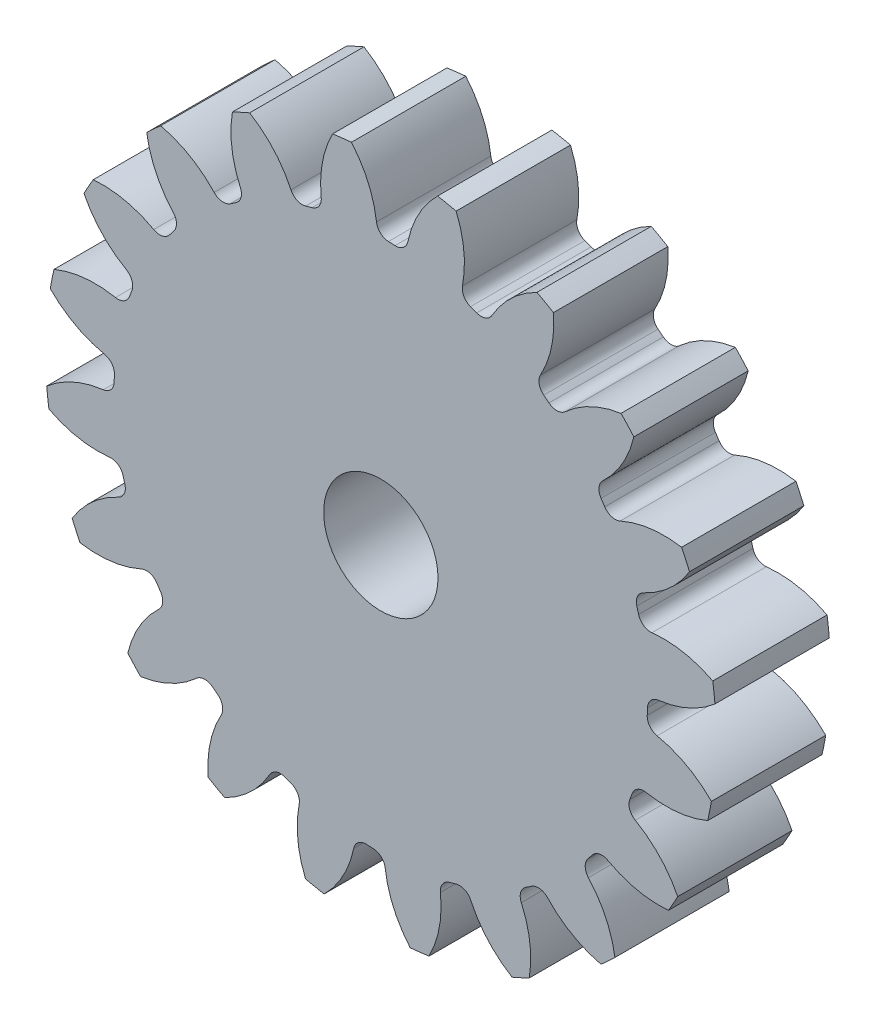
ISO-10303-21;
HEADER;
FILE_DESCRIPTION(('STEP AP214'),'2;1');
FILE_NAME('part.step','',(''),(''),'','','');
FILE_SCHEMA(('AUTOMOTIVE_DESIGN { 1 0 10303 214 1 1 1 1 }'));
ENDSEC;
DATA;
#1=APPLICATION_CONTEXT('core data for automotive mechanical design processes');
#2=APPLICATION_PROTOCOL_DEFINITION('international standard','automotive_design',2000,#1);
#3=PRODUCT_CONTEXT('',#1,'mechanical');
#4=PRODUCT('Part','Part','',(#3));
#5=PRODUCT_RELATED_PRODUCT_CATEGORY('part','',(#4));
#6=PRODUCT_DEFINITION_FORMATION('','',#4);
#7=PRODUCT_DEFINITION_CONTEXT('part definition',#1,'design');
#8=PRODUCT_DEFINITION('design','',#6,#7);
#9=PRODUCT_DEFINITION_SHAPE('','',#8);
#10=(LENGTH_UNIT() NAMED_UNIT(*) SI_UNIT(.MILLI.,.METRE.));
#11=(NAMED_UNIT(*) PLANE_ANGLE_UNIT() SI_UNIT($,.RADIAN.));
#12=(NAMED_UNIT(*) SI_UNIT($,.STERADIAN.) SOLID_ANGLE_UNIT());
#13=UNCERTAINTY_MEASURE_WITH_UNIT(LENGTH_MEASURE(1.E-05),#10,'distance_accuracy_value','');
#14=(GEOMETRIC_REPRESENTATION_CONTEXT(3) GLOBAL_UNCERTAINTY_ASSIGNED_CONTEXT((#13)) GLOBAL_UNIT_ASSIGNED_CONTEXT((#10,
#11,#12)) REPRESENTATION_CONTEXT('',''));
#15=CARTESIAN_POINT('',(0.,0.,0.));
#16=DIRECTION('',(0.,0.,1.));
#17=DIRECTION('',(1.,0.,0.));
#18=AXIS2_PLACEMENT_3D('',#15,#16,#17);
#19=CARTESIAN_POINT('',(0.,0.,127.));
#20=DIRECTION('',(0.,0.,-1.));
#21=DIRECTION('',(-1.,0.,0.));
#22=AXIS2_PLACEMENT_3D('',#19,#20,#21);
#23=CYLINDRICAL_SURFACE('',#22,372.533333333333);
#24=DIRECTION('',(0.,0.,-1.));
#25=VECTOR('',#24,1.);
#26=CARTESIAN_POINT('',(368.662646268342,53.5624653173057,63.5));
#27=LINE('',#26,#25);
#28=CARTESIAN_POINT('',(368.662646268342,53.5624653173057,127.));
#29=VERTEX_POINT('',#28);
#30=CARTESIAN_POINT('',(368.662646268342,53.5624653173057,0.));
#31=VERTEX_POINT('',#30);
#32=EDGE_CURVE('E816',#29,#31,#27,.T.);
#33=ORIENTED_EDGE('',*,*,#32,.F.);
#34=CARTESIAN_POINT('',(0.,0.,127.));
#35=DIRECTION('',(0.,0.,1.));
#36=DIRECTION('',(1.,0.,0.));
#37=AXIS2_PLACEMENT_3D('',#34,#35,#36);
#38=CIRCLE('',#37,372.533333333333);
#39=CARTESIAN_POINT('',(371.100549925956,32.6414811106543,127.));
#40=VERTEX_POINT('',#39);
#41=EDGE_CURVE('E1537',#40,#29,#38,.T.);
#42=ORIENTED_EDGE('',*,*,#41,.F.);
#43=DIRECTION('',(0.,0.,-1.));
#44=VECTOR('',#43,1.);
#45=CARTESIAN_POINT('',(371.100549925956,32.6414811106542,63.5));
#46=LINE('',#45,#44);
#47=CARTESIAN_POINT('',(371.100549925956,32.6414811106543,0.));
#48=VERTEX_POINT('',#47);
#49=EDGE_CURVE('E1531',#48,#40,#46,.F.);
#50=ORIENTED_EDGE('',*,*,#49,.F.);
#51=CARTESIAN_POINT('',(0.,0.,0.));
#52=DIRECTION('',(0.,0.,1.));
#53=DIRECTION('',(1.,0.,0.));
#54=AXIS2_PLACEMENT_3D('',#51,#52,#53);
#55=CIRCLE('',#54,372.533333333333);
#56=EDGE_CURVE('E1542',#48,#31,#55,.T.);
#57=ORIENTED_EDGE('',*,*,#56,.T.);
#58=EDGE_LOOP('',(#33,#42,#50,#57));
#59=FACE_BOUND('',#58,.T.);
#60=ADVANCED_FACE('F33',(#59),#23,.T.);
#61=DIRECTION('',(0.,0.,-1.));
#62=VECTOR('',#61,1.);
#63=CARTESIAN_POINT('',(342.850823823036,145.720269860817,63.5));
#64=LINE('',#63,#62);
#65=CARTESIAN_POINT('',(342.850823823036,145.720269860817,0.));
#66=VERTEX_POINT('',#65);
#67=CARTESIAN_POINT('',(342.850823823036,145.720269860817,127.));
#68=VERTEX_POINT('',#67);
#69=EDGE_CURVE('E787',#66,#68,#64,.F.);
#70=ORIENTED_EDGE('',*,*,#69,.F.);
#71=CARTESIAN_POINT('',(334.067300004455,164.863954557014,0.));
#72=VERTEX_POINT('',#71);
#73=EDGE_CURVE('E1545',#66,#72,#55,.T.);
#74=ORIENTED_EDGE('',*,*,#73,.T.);
#75=DIRECTION('',(0.,0.,-1.));
#76=VECTOR('',#75,1.);
#77=CARTESIAN_POINT('',(334.067300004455,164.863954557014,63.5));
#78=LINE('',#77,#76);
#79=CARTESIAN_POINT('',(334.067300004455,164.863954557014,127.));
#80=VERTEX_POINT('',#79);
#81=EDGE_CURVE('E849',#80,#72,#78,.T.);
#82=ORIENTED_EDGE('',*,*,#81,.F.);
#83=EDGE_CURVE('E1540',#68,#80,#38,.T.);
#84=ORIENTED_EDGE('',*,*,#83,.F.);
#85=EDGE_LOOP('',(#70,#74,#82,#84));
#86=FACE_BOUND('',#85,.T.);
#87=ADVANCED_FACE('F1771',(#86),#23,.T.);
#88=CARTESIAN_POINT('',(0.,0.,127.));
#89=DIRECTION('',(0.,0.,1.));
#90=DIRECTION('',(1.,0.,0.));
#91=AXIS2_PLACEMENT_3D('',#88,#89,#90);
#92=PLANE('',#91);
#93=CARTESIAN_POINT('',(0.,0.,127.000000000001));
#94=DIRECTION('',(0.,0.,1.));
#95=DIRECTION('',(1.,0.,0.));
#96=AXIS2_PLACEMENT_3D('',#93,#94,#95);
#97=CIRCLE('',#96,63.5);
#98=CARTESIAN_POINT('',(63.5,0.,127.000000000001));
#99=VERTEX_POINT('',#98);
#100=EDGE_CURVE('E804',#99,#99,#97,.T.);
#101=ORIENTED_EDGE('',*,*,#100,.F.);
#102=EDGE_LOOP('',(#101));
#103=FACE_BOUND('',#102,.T.);
#104=ORIENTED_EDGE('',*,*,#41,.T.);
#105=CARTESIAN_POINT('',(314.142826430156,-50.9177416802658,127.));
#106=DIRECTION('',(0.,0.,-1.));
#107=DIRECTION('',(0.951056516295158,0.309016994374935,0.));
#108=AXIS2_PLACEMENT_3D('',#105,#106,#107);
#109=CIRCLE('',#108,117.849583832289);
#110=CARTESIAN_POINT('',(301.161806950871,66.2147369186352,127.));
#111=VERTEX_POINT('',#110);
#112=EDGE_CURVE('E796',#111,#29,#109,.T.);
#113=ORIENTED_EDGE('',*,*,#112,.F.);
#114=CARTESIAN_POINT('',(299.643541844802,79.9145973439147,127.));
#115=DIRECTION('',(0.,0.,1.));
#116=DIRECTION('',(-0.951056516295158,-0.309016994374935,0.));
#117=AXIS2_PLACEMENT_3D('',#114,#115,#116);
#118=CIRCLE('',#117,13.7837333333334);
#119=CARTESIAN_POINT('',(286.325323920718,76.3626435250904,127.));
#120=VERTEX_POINT('',#119);
#121=EDGE_CURVE('E794',#120,#111,#118,.T.);
#122=ORIENTED_EDGE('',*,*,#121,.F.);
#123=CARTESIAN_POINT('',(0.,0.,127.));
#124=DIRECTION('',(0.,0.,-1.));
#125=DIRECTION('',(0.951056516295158,0.309016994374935,0.));
#126=AXIS2_PLACEMENT_3D('',#123,#124,#125);
#127=CIRCLE('',#126,296.333333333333);
#128=CARTESIAN_POINT('',(284.334818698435,83.4694873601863,127.));
#129=VERTEX_POINT('',#128);
#130=EDGE_CURVE('E779',#129,#120,#127,.T.);
#131=ORIENTED_EDGE('',*,*,#130,.F.);
#132=CARTESIAN_POINT('',(297.560449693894,87.352010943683,127.));
#133=DIRECTION('',(0.,0.,1.));
#134=DIRECTION('',(-0.951056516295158,-0.309016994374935,0.));
#135=AXIS2_PLACEMENT_3D('',#132,#133,#134);
#136=CIRCLE('',#135,13.7837333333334);
#137=CARTESIAN_POINT('',(291.741866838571,99.8474260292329,127.));
#138=VERTEX_POINT('',#137);
#139=EDGE_CURVE('E771',#138,#129,#136,.T.);
#140=ORIENTED_EDGE('',*,*,#139,.F.);
#141=CARTESIAN_POINT('',(241.993547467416,206.682013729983,127.));
#142=DIRECTION('',(0.,0.,-1.));
#143=DIRECTION('',(-0.951056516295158,-0.309016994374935,0.));
#144=AXIS2_PLACEMENT_3D('',#141,#142,#143);
#145=CIRCLE('',#144,117.849583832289);
#146=EDGE_CURVE('E801',#68,#138,#145,.T.);
#147=ORIENTED_EDGE('',*,*,#146,.F.);
#148=ORIENTED_EDGE('',*,*,#83,.T.);
#149=CARTESIAN_POINT('',(314.502029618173,48.6498220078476,127.));
#150=DIRECTION('',(0.,0.,-1.));
#151=DIRECTION('',(0.809016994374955,0.587785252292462,0.));
#152=AXIS2_PLACEMENT_3D('',#149,#150,#151);
#153=CIRCLE('',#152,117.849583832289);
#154=CARTESIAN_POINT('',(265.960419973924,156.038073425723,127.));
#155=VERTEX_POINT('',#154);
#156=EDGE_CURVE('E825',#155,#80,#153,.T.);
#157=ORIENTED_EDGE('',*,*,#156,.F.);
#158=CARTESIAN_POINT('',(260.282974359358,168.598245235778,127.));
#159=DIRECTION('',(0.,0.,1.));
#160=DIRECTION('',(-0.809016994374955,-0.587785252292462,0.));
#161=AXIS2_PLACEMENT_3D('',#158,#159,#160);
#162=CIRCLE('',#161,13.7837333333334);
#163=CARTESIAN_POINT('',(248.714210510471,161.104580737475,127.));
#164=VERTEX_POINT('',#163);
#165=EDGE_CURVE('E823',#164,#155,#162,.T.);
#166=ORIENTED_EDGE('',*,*,#165,.F.);
#167=CARTESIAN_POINT('',(0.,0.,127.));
#168=DIRECTION('',(0.,0.,-1.));
#169=DIRECTION('',(0.809016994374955,0.587785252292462,0.));
#170=AXIS2_PLACEMENT_3D('',#167,#168,#169);
#171=CIRCLE('',#170,296.333333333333);
#172=CARTESIAN_POINT('',(244.624992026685,167.248490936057,127.));
#173=VERTEX_POINT('',#172);
#174=EDGE_CURVE('E820',#173,#164,#171,.T.);
#175=ORIENTED_EDGE('',*,*,#174,.F.);
#176=CARTESIAN_POINT('',(256.003548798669,175.02793502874,127.));
#177=DIRECTION('',(0.,0.,1.));
#178=DIRECTION('',(-0.809016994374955,-0.587785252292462,0.));
#179=AXIS2_PLACEMENT_3D('',#176,#177,#178);
#180=CIRCLE('',#179,13.7837333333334);
#181=CARTESIAN_POINT('',(246.608452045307,185.113739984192,127.));
#182=VERTEX_POINT('',#181);
#183=EDGE_CURVE('E818',#182,#173,#180,.T.);
#184=ORIENTED_EDGE('',*,*,#183,.F.);
#185=CARTESIAN_POINT('',(166.281285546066,271.346394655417,127.));
#186=DIRECTION('',(0.,0.,-1.));
#187=DIRECTION('',(-0.809016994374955,-0.587785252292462,0.));
#188=AXIS2_PLACEMENT_3D('',#185,#186,#187);
#189=CIRCLE('',#188,117.849583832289);
#190=CARTESIAN_POINT('',(281.040470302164,244.534943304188,127.));
#191=VERTEX_POINT('',#190);
#192=EDGE_CURVE('E828',#191,#182,#189,.T.);
#193=ORIENTED_EDGE('',*,*,#192,.F.);
#194=CARTESIAN_POINT('',(266.771118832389,260.027411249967,127.));
#195=VERTEX_POINT('',#194);
#196=EDGE_CURVE('E1593',#191,#195,#38,.T.);
#197=ORIENTED_EDGE('',*,*,#196,.T.);
#198=CARTESIAN_POINT('',(284.075582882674,143.455202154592,127.));
#199=DIRECTION('',(0.,0.,-1.));
#200=DIRECTION('',(0.587785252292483,0.80901699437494,0.));
#201=AXIS2_PLACEMENT_3D('',#198,#199,#200);
#202=CIRCLE('',#201,117.849583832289);
#203=CARTESIAN_POINT('',(204.724974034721,230.587316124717,127.));
#204=VERTEX_POINT('',#203);
#205=EDGE_CURVE('E860',#204,#195,#202,.T.);
#206=ORIENTED_EDGE('',*,*,#205,.F.);
#207=CARTESIAN_POINT('',(195.444095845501,240.778322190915,127.));
#208=DIRECTION('',(0.,0.,1.));
#209=DIRECTION('',(-0.587785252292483,-0.80901699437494,0.));
#210=AXIS2_PLACEMENT_3D('',#207,#208,#209);
#211=CIRCLE('',#210,13.7837333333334);
#212=CARTESIAN_POINT('',(186.757217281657,230.076479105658,127.));
#213=VERTEX_POINT('',#212);
#214=EDGE_CURVE('E858',#213,#204,#211,.T.);
#215=ORIENTED_EDGE('',*,*,#214,.F.);
#216=CARTESIAN_POINT('',(0.,0.,127.));
#217=DIRECTION('',(0.,0.,-1.));
#218=DIRECTION('',(0.587785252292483,0.80901699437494,0.));
#219=AXIS2_PLACEMENT_3D('',#216,#217,#218);
#220=CIRCLE('',#219,296.333333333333);
#221=CARTESIAN_POINT('',(180.969566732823,234.65604693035,127.));
#222=VERTEX_POINT('',#221);
#223=EDGE_CURVE('E855',#222,#213,#220,.T.);
#224=ORIENTED_EDGE('',*,*,#223,.F.);
#225=CARTESIAN_POINT('',(189.387236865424,245.570905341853,127.));
#226=DIRECTION('',(0.,0.,1.));
#227=DIRECTION('',(-0.587785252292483,-0.80901699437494,0.));
#228=AXIS2_PLACEMENT_3D('',#225,#226,#227);
#229=CIRCLE('',#228,13.7837333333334);
#230=CARTESIAN_POINT('',(177.33528374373,252.259831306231,127.));
#231=VERTEX_POINT('',#230);
#232=EDGE_CURVE('E853',#231,#222,#229,.T.);
#233=ORIENTED_EDGE('',*,*,#232,.F.);
#234=CARTESIAN_POINT('',(74.2922528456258,309.449499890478,127.));
#235=DIRECTION('',(0.,0.,-1.));
#236=DIRECTION('',(-0.587785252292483,-0.80901699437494,0.));
#237=AXIS2_PLACEMENT_3D('',#234,#235,#236);
#238=CIRCLE('',#237,117.849583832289);
#239=CARTESIAN_POINT('',(191.719917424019,319.412832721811,127.));
#240=VERTEX_POINT('',#239);
#241=EDGE_CURVE('E863',#240,#231,#238,.T.);
#242=ORIENTED_EDGE('',*,*,#241,.F.);
#243=CARTESIAN_POINT('',(173.361521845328,329.737573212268,127.));
#244=VERTEX_POINT('',#243);
#245=EDGE_CURVE('E1753',#240,#244,#38,.T.);
#246=ORIENTED_EDGE('',*,*,#245,.T.);
#247=CARTESIAN_POINT('',(225.841838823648,224.218187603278,127.));
#248=DIRECTION('',(0.,0.,-1.));
#249=DIRECTION('',(0.309016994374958,0.95105651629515,0.));
#250=AXIS2_PLACEMENT_3D('',#247,#248,#249);
#251=CIRCLE('',#250,117.849583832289);
#252=CARTESIAN_POINT('',(123.449621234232,282.565065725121,127.));
#253=VERTEX_POINT('',#252);
#254=EDGE_CURVE('E898',#253,#244,#251,.T.);
#255=ORIENTED_EDGE('',*,*,#254,.F.);
#256=CARTESIAN_POINT('',(111.473787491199,289.38933936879,127.));
#257=DIRECTION('',(0.,0.,1.));
#258=DIRECTION('',(-0.309016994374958,-0.95105651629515,0.));
#259=AXIS2_PLACEMENT_3D('',#256,#257,#258);
#260=CIRCLE('',#259,13.7837333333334);
#261=CARTESIAN_POINT('',(106.519126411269,276.526888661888,127.));
#262=VERTEX_POINT('',#261);
#263=EDGE_CURVE('E896',#262,#253,#260,.T.);
#264=ORIENTED_EDGE('',*,*,#263,.F.);
#265=CARTESIAN_POINT('',(0.,0.,127.));
#266=DIRECTION('',(0.,0.,-1.));
#267=DIRECTION('',(0.309016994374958,0.95105651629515,0.));
#268=AXIS2_PLACEMENT_3D('',#265,#266,#267);
#269=CIRCLE('',#268,296.333333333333);
#270=CARTESIAN_POINT('',(99.5995793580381,279.093834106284,127.));
#271=VERTEX_POINT('',#270);
#272=EDGE_CURVE('E893',#271,#262,#269,.T.);
#273=ORIENTED_EDGE('',*,*,#272,.F.);
#274=CARTESIAN_POINT('',(104.232382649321,292.075684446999,127.));
#275=DIRECTION('',(0.,0.,1.));
#276=DIRECTION('',(-0.309016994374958,-0.95105651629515,0.));
#277=AXIS2_PLACEMENT_3D('',#274,#275,#276);
#278=CIRCLE('',#277,13.7837333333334);
#279=CARTESIAN_POINT('',(90.703302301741,294.712972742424,127.));
#280=VERTEX_POINT('',#279);
#281=EDGE_CURVE('E891',#280,#271,#278,.T.);
#282=ORIENTED_EDGE('',*,*,#281,.F.);
#283=CARTESIAN_POINT('',(-24.969023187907,317.261532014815,127.));
#284=DIRECTION('',(0.,0.,-1.));
#285=DIRECTION('',(-0.309016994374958,-0.95105651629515,0.));
#286=AXIS2_PLACEMENT_3D('',#283,#284,#285);
#287=CIRCLE('',#286,117.849583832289);
#288=CARTESIAN_POINT('',(83.6324832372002,363.024368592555,127.));
#289=VERTEX_POINT('',#288);
#290=EDGE_CURVE('E901',#289,#280,#287,.T.);
#291=ORIENTED_EDGE('',*,*,#290,.F.);
#292=CARTESIAN_POINT('',(62.9820912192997,367.170724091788,127.));
#293=VERTEX_POINT('',#292);
#294=EDGE_CURVE('E1749',#289,#293,#38,.T.);
#295=ORIENTED_EDGE('',*,*,#294,.T.);
#296=CARTESIAN_POINT('',(145.501122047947,283.033134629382,127.));
#297=DIRECTION('',(0.,0.,-1.));
#298=DIRECTION('',(0.,1.,0.));
#299=AXIS2_PLACEMENT_3D('',#296,#297,#298);
#300=CIRCLE('',#299,117.849583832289);
#301=CARTESIAN_POINT('',(30.0901593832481,306.883377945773,127.));
#302=VERTEX_POINT('',#301);
#303=EDGE_CURVE('E936',#302,#293,#300,.T.);
#304=ORIENTED_EDGE('',*,*,#303,.F.);
#305=CARTESIAN_POINT('',(16.5916481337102,309.672911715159,127.));
#306=DIRECTION('',(0.,0.,1.));
#307=DIRECTION('',(0.,-1.,0.));
#308=AXIS2_PLACEMENT_3D('',#305,#306,#307);
#309=CIRCLE('',#308,13.7837333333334);
#310=CARTESIAN_POINT('',(15.8542012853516,295.908919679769,127.));
#311=VERTEX_POINT('',#310);
#312=EDGE_CURVE('E934',#311,#302,#309,.T.);
#313=ORIENTED_EDGE('',*,*,#312,.F.);
#314=CARTESIAN_POINT('',(0.,0.,127.));
#315=DIRECTION('',(0.,0.,-1.));
#316=DIRECTION('',(0.,1.,0.));
#317=AXIS2_PLACEMENT_3D('',#314,#315,#316);
#318=CIRCLE('',#317,296.333333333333);
#319=CARTESIAN_POINT('',(8.48009120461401,296.21197223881,127.));
#320=VERTEX_POINT('',#319);
#321=EDGE_CURVE('E931',#320,#311,#318,.T.);
#322=ORIENTED_EDGE('',*,*,#321,.F.);
#323=CARTESIAN_POINT('',(8.87453658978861,309.990060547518,127.));
#324=DIRECTION('',(0.,0.,1.));
#325=DIRECTION('',(0.,-1.,0.));
#326=AXIS2_PLACEMENT_3D('',#323,#324,#325);
#327=CIRCLE('',#326,13.7837333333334);
#328=CARTESIAN_POINT('',(-4.80735033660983,308.317555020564,127.));
#329=VERTEX_POINT('',#328);
#330=EDGE_CURVE('E929',#329,#320,#327,.T.);
#331=ORIENTED_EDGE('',*,*,#330,.F.);
#332=CARTESIAN_POINT('',(-121.786157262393,294.017794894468,127.));
#333=DIRECTION('',(0.,0.,-1.));
#334=DIRECTION('',(0.,-1.,0.));
#335=AXIS2_PLACEMENT_3D('',#332,#333,#334);
#336=CIRCLE('',#335,117.849583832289);
#337=CARTESIAN_POINT('',(-32.6414811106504,371.100549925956,127.));
#338=VERTEX_POINT('',#337);
#339=EDGE_CURVE('E939',#338,#329,#336,.T.);
#340=ORIENTED_EDGE('',*,*,#339,.F.);
#341=CARTESIAN_POINT('',(-53.562465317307,368.662646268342,127.));
#342=VERTEX_POINT('',#341);
#343=EDGE_CURVE('E1745',#338,#342,#38,.T.);
#344=ORIENTED_EDGE('',*,*,#343,.T.);
#345=CARTESIAN_POINT('',(50.9177416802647,314.142826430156,127.));
#346=DIRECTION('',(0.,0.,-1.));
#347=DIRECTION('',(-0.309016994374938,0.951056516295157,0.));
#348=AXIS2_PLACEMENT_3D('',#345,#346,#347);
#349=CIRCLE('',#348,117.849583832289);
#350=CARTESIAN_POINT('',(-66.2147369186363,301.16180695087,127.));
#351=VERTEX_POINT('',#350);
#352=EDGE_CURVE('E974',#351,#342,#349,.T.);
#353=ORIENTED_EDGE('',*,*,#352,.F.);
#354=CARTESIAN_POINT('',(-79.9145973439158,299.643541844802,127.));
#355=DIRECTION('',(0.,0.,1.));
#356=DIRECTION('',(0.309016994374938,-0.951056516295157,0.));
#357=AXIS2_PLACEMENT_3D('',#354,#355,#356);
#358=CIRCLE('',#357,13.7837333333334);
#359=CARTESIAN_POINT('',(-76.3626435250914,286.325323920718,127.));
#360=VERTEX_POINT('',#359);
#361=EDGE_CURVE('E972',#360,#351,#358,.T.);
#362=ORIENTED_EDGE('',*,*,#361,.F.);
#363=CARTESIAN_POINT('',(0.,0.,127.));
#364=DIRECTION('',(0.,0.,-1.));
#365=DIRECTION('',(-0.309016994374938,0.951056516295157,0.));
#366=AXIS2_PLACEMENT_3D('',#363,#364,#365);
#367=CIRCLE('',#366,296.333333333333);
#368=CARTESIAN_POINT('',(-83.4694873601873,284.334818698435,127.));
#369=VERTEX_POINT('',#368);
#370=EDGE_CURVE('E969',#369,#360,#367,.T.);
#371=ORIENTED_EDGE('',*,*,#370,.F.);
#372=CARTESIAN_POINT('',(-87.3520109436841,297.560449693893,127.));
#373=DIRECTION('',(0.,0.,1.));
#374=DIRECTION('',(0.309016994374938,-0.951056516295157,0.));
#375=AXIS2_PLACEMENT_3D('',#372,#373,#374);
#376=CIRCLE('',#375,13.7837333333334);
#377=CARTESIAN_POINT('',(-99.8474260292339,291.74186683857,127.));
#378=VERTEX_POINT('',#377);
#379=EDGE_CURVE('E967',#378,#369,#376,.T.);
#380=ORIENTED_EDGE('',*,*,#379,.F.);
#381=CARTESIAN_POINT('',(-206.682013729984,241.993547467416,127.));
#382=DIRECTION('',(0.,0.,-1.));
#383=DIRECTION('',(0.309016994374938,-0.951056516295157,0.));
#384=AXIS2_PLACEMENT_3D('',#381,#382,#383);
#385=CIRCLE('',#384,117.849583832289);
#386=CARTESIAN_POINT('',(-145.720269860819,342.850823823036,127.));
#387=VERTEX_POINT('',#386);
#388=EDGE_CURVE('E977',#387,#378,#385,.T.);
#389=ORIENTED_EDGE('',*,*,#388,.F.);
#390=CARTESIAN_POINT('',(-164.863954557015,334.067300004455,127.));
#391=VERTEX_POINT('',#390);
#392=EDGE_CURVE('E1741',#387,#391,#38,.T.);
#393=ORIENTED_EDGE('',*,*,#392,.T.);
#394=CARTESIAN_POINT('',(-48.6498220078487,314.502029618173,127.));
#395=DIRECTION('',(0.,0.,-1.));
#396=DIRECTION('',(-0.587785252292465,0.809016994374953,0.));
#397=AXIS2_PLACEMENT_3D('',#394,#395,#396);
#398=CIRCLE('',#397,117.849583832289);
#399=CARTESIAN_POINT('',(-156.038073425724,265.960419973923,127.));
#400=VERTEX_POINT('',#399);
#401=EDGE_CURVE('E1012',#400,#391,#398,.T.);
#402=ORIENTED_EDGE('',*,*,#401,.F.);
#403=CARTESIAN_POINT('',(-168.598245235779,260.282974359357,127.));
#404=DIRECTION('',(0.,0.,1.));
#405=DIRECTION('',(0.587785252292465,-0.809016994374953,0.));
#406=AXIS2_PLACEMENT_3D('',#403,#404,#405);
#407=CIRCLE('',#406,13.7837333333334);
#408=CARTESIAN_POINT('',(-161.104580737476,248.71421051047,127.));
#409=VERTEX_POINT('',#408);
#410=EDGE_CURVE('E1010',#409,#400,#407,.T.);
#411=ORIENTED_EDGE('',*,*,#410,.F.);
#412=CARTESIAN_POINT('',(0.,0.,127.));
#413=DIRECTION('',(0.,0.,-1.));
#414=DIRECTION('',(-0.587785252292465,0.809016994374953,0.));
#415=AXIS2_PLACEMENT_3D('',#412,#413,#414);
#416=CIRCLE('',#415,296.333333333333);
#417=CARTESIAN_POINT('',(-167.248490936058,244.624992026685,127.));
#418=VERTEX_POINT('',#417);
#419=EDGE_CURVE('E1007',#418,#409,#416,.T.);
#420=ORIENTED_EDGE('',*,*,#419,.F.);
#421=CARTESIAN_POINT('',(-175.027935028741,256.003548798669,127.));
#422=DIRECTION('',(0.,0.,1.));
#423=DIRECTION('',(0.587785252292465,-0.809016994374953,0.));
#424=AXIS2_PLACEMENT_3D('',#421,#422,#423);
#425=CIRCLE('',#424,13.7837333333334);
#426=CARTESIAN_POINT('',(-185.113739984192,246.608452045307,127.));
#427=VERTEX_POINT('',#426);
#428=EDGE_CURVE('E1005',#427,#418,#425,.T.);
#429=ORIENTED_EDGE('',*,*,#428,.F.);
#430=CARTESIAN_POINT('',(-271.346394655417,166.281285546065,127.));
#431=DIRECTION('',(0.,0.,-1.));
#432=DIRECTION('',(0.587785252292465,-0.809016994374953,0.));
#433=AXIS2_PLACEMENT_3D('',#430,#431,#432);
#434=CIRCLE('',#433,117.849583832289);
#435=CARTESIAN_POINT('',(-244.534943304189,281.040470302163,127.));
#436=VERTEX_POINT('',#435);
#437=EDGE_CURVE('E1015',#436,#427,#434,.T.);
#438=ORIENTED_EDGE('',*,*,#437,.F.);
#439=CARTESIAN_POINT('',(-260.027411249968,266.771118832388,127.));
#440=VERTEX_POINT('',#439);
#441=EDGE_CURVE('E1737',#436,#440,#38,.T.);
#442=ORIENTED_EDGE('',*,*,#441,.T.);
#443=CARTESIAN_POINT('',(-143.455202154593,284.075582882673,127.));
#444=DIRECTION('',(0.,0.,-1.));
#445=DIRECTION('',(-0.809016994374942,0.58778525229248,0.));
#446=AXIS2_PLACEMENT_3D('',#443,#444,#445);
#447=CIRCLE('',#446,117.849583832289);
#448=CARTESIAN_POINT('',(-230.587316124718,204.724974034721,127.));
#449=VERTEX_POINT('',#448);
#450=EDGE_CURVE('E1050',#449,#440,#447,.T.);
#451=ORIENTED_EDGE('',*,*,#450,.F.);
#452=CARTESIAN_POINT('',(-240.778322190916,195.4440958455,127.));
#453=DIRECTION('',(0.,0.,1.));
#454=DIRECTION('',(0.809016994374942,-0.58778525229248,0.));
#455=AXIS2_PLACEMENT_3D('',#452,#453,#454);
#456=CIRCLE('',#455,13.7837333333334);
#457=CARTESIAN_POINT('',(-230.076479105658,186.757217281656,127.));
#458=VERTEX_POINT('',#457);
#459=EDGE_CURVE('E1048',#458,#449,#456,.T.);
#460=ORIENTED_EDGE('',*,*,#459,.F.);
#461=CARTESIAN_POINT('',(0.,0.,127.));
#462=DIRECTION('',(0.,0.,-1.));
#463=DIRECTION('',(-0.809016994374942,0.58778525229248,0.));
#464=AXIS2_PLACEMENT_3D('',#461,#462,#463);
#465=CIRCLE('',#464,296.333333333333);
#466=CARTESIAN_POINT('',(-234.656046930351,180.969566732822,127.));
#467=VERTEX_POINT('',#466);
#468=EDGE_CURVE('E1045',#467,#458,#465,.T.);
#469=ORIENTED_EDGE('',*,*,#468,.F.);
#470=CARTESIAN_POINT('',(-245.570905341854,189.387236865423,127.));
#471=DIRECTION('',(0.,0.,1.));
#472=DIRECTION('',(0.809016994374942,-0.58778525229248,0.));
#473=AXIS2_PLACEMENT_3D('',#470,#471,#472);
#474=CIRCLE('',#473,13.7837333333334);
#475=CARTESIAN_POINT('',(-252.259831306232,177.335283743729,127.));
#476=VERTEX_POINT('',#475);
#477=EDGE_CURVE('E1043',#476,#467,#474,.T.);
#478=ORIENTED_EDGE('',*,*,#477,.F.);
#479=CARTESIAN_POINT('',(-309.449499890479,74.2922528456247,127.));
#480=DIRECTION('',(0.,0.,-1.));
#481=DIRECTION('',(0.809016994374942,-0.58778525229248,0.));
#482=AXIS2_PLACEMENT_3D('',#479,#480,#481);
#483=CIRCLE('',#482,117.849583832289);
#484=CARTESIAN_POINT('',(-319.412832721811,191.719917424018,127.));
#485=VERTEX_POINT('',#484);
#486=EDGE_CURVE('E1053',#485,#476,#483,.T.);
#487=ORIENTED_EDGE('',*,*,#486,.F.);
#488=CARTESIAN_POINT('',(-329.737573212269,173.361521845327,127.));
#489=VERTEX_POINT('',#488);
#490=EDGE_CURVE('E1733',#485,#489,#38,.T.);
#491=ORIENTED_EDGE('',*,*,#490,.T.);
#492=CARTESIAN_POINT('',(-224.218187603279,225.841838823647,127.));
#493=DIRECTION('',(0.,0.,-1.));
#494=DIRECTION('',(-0.951056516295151,0.309016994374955,0.));
#495=AXIS2_PLACEMENT_3D('',#492,#493,#494);
#496=CIRCLE('',#495,117.849583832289);
#497=CARTESIAN_POINT('',(-282.565065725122,123.449621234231,127.));
#498=VERTEX_POINT('',#497);
#499=EDGE_CURVE('E1088',#498,#489,#496,.T.);
#500=ORIENTED_EDGE('',*,*,#499,.F.);
#501=CARTESIAN_POINT('',(-289.38933936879,111.473787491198,127.));
#502=DIRECTION('',(0.,0.,1.));
#503=DIRECTION('',(0.951056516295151,-0.309016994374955,0.));
#504=AXIS2_PLACEMENT_3D('',#501,#502,#503);
#505=CIRCLE('',#504,13.7837333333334);
#506=CARTESIAN_POINT('',(-276.526888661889,106.519126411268,127.));
#507=VERTEX_POINT('',#506);
#508=EDGE_CURVE('E1086',#507,#498,#505,.T.);
#509=ORIENTED_EDGE('',*,*,#508,.F.);
#510=CARTESIAN_POINT('',(0.,0.,127.));
#511=DIRECTION('',(0.,0.,-1.));
#512=DIRECTION('',(-0.951056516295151,0.309016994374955,0.));
#513=AXIS2_PLACEMENT_3D('',#510,#511,#512);
#514=CIRCLE('',#513,296.333333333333);
#515=CARTESIAN_POINT('',(-279.093834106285,99.5995793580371,127.));
#516=VERTEX_POINT('',#515);
#517=EDGE_CURVE('E1083',#516,#507,#514,.T.);
#518=ORIENTED_EDGE('',*,*,#517,.F.);
#519=CARTESIAN_POINT('',(-292.075684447,104.23238264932,127.));
#520=DIRECTION('',(0.,0.,1.));
#521=DIRECTION('',(0.951056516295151,-0.309016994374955,0.));
#522=AXIS2_PLACEMENT_3D('',#519,#520,#521);
#523=CIRCLE('',#522,13.7837333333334);
#524=CARTESIAN_POINT('',(-294.712972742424,90.70330230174,127.));
#525=VERTEX_POINT('',#524);
#526=EDGE_CURVE('E1081',#525,#516,#523,.T.);
#527=ORIENTED_EDGE('',*,*,#526,.F.);
#528=CARTESIAN_POINT('',(-317.261532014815,-24.9690231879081,127.));
#529=DIRECTION('',(0.,0.,-1.));
#530=DIRECTION('',(0.951056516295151,-0.309016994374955,0.));
#531=AXIS2_PLACEMENT_3D('',#528,#529,#530);
#532=CIRCLE('',#531,117.849583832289);
#533=CARTESIAN_POINT('',(-363.024368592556,83.632483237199,127.));
#534=VERTEX_POINT('',#533);
#535=EDGE_CURVE('E1091',#534,#525,#532,.T.);
#536=ORIENTED_EDGE('',*,*,#535,.F.);
#537=CARTESIAN_POINT('',(-367.170724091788,62.9820912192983,127.));
#538=VERTEX_POINT('',#537);
#539=EDGE_CURVE('E1729',#534,#538,#38,.T.);
#540=ORIENTED_EDGE('',*,*,#539,.T.);
#541=CARTESIAN_POINT('',(-283.033134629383,145.501122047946,127.));
#542=DIRECTION('',(0.,0.,-1.));
#543=DIRECTION('',(-1.,0.,0.));
#544=AXIS2_PLACEMENT_3D('',#541,#542,#543);
#545=CIRCLE('',#544,117.849583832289);
#546=CARTESIAN_POINT('',(-306.883377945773,30.090159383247,127.));
#547=VERTEX_POINT('',#546);
#548=EDGE_CURVE('E1126',#547,#538,#545,.T.);
#549=ORIENTED_EDGE('',*,*,#548,.F.);
#550=CARTESIAN_POINT('',(-309.672911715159,16.5916481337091,127.));
#551=DIRECTION('',(0.,0.,1.));
#552=DIRECTION('',(1.,0.,0.));
#553=AXIS2_PLACEMENT_3D('',#550,#551,#552);
#554=CIRCLE('',#553,13.7837333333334);
#555=CARTESIAN_POINT('',(-295.908919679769,15.8542012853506,127.));
#556=VERTEX_POINT('',#555);
#557=EDGE_CURVE('E1124',#556,#547,#554,.T.);
#558=ORIENTED_EDGE('',*,*,#557,.F.);
#559=CARTESIAN_POINT('',(0.,0.,127.));
#560=DIRECTION('',(0.,0.,-1.));
#561=DIRECTION('',(-1.,0.,0.));
#562=AXIS2_PLACEMENT_3D('',#559,#560,#561);
#563=CIRCLE('',#562,296.333333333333);
#564=CARTESIAN_POINT('',(-296.21197223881,8.48009120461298,127.));
#565=VERTEX_POINT('',#564);
#566=EDGE_CURVE('E1121',#565,#556,#563,.T.);
#567=ORIENTED_EDGE('',*,*,#566,.F.);
#568=CARTESIAN_POINT('',(-309.990060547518,8.87453658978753,127.));
#569=DIRECTION('',(0.,0.,1.));
#570=DIRECTION('',(1.,0.,0.));
#571=AXIS2_PLACEMENT_3D('',#568,#569,#570);
#572=CIRCLE('',#571,13.7837333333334);
#573=CARTESIAN_POINT('',(-308.317555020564,-4.80735033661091,127.));
#574=VERTEX_POINT('',#573);
#575=EDGE_CURVE('E1119',#574,#565,#572,.T.);
#576=ORIENTED_EDGE('',*,*,#575,.F.);
#577=CARTESIAN_POINT('',(-294.017794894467,-121.786157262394,127.));
#578=DIRECTION('',(0.,0.,-1.));
#579=DIRECTION('',(1.,0.,0.));
#580=AXIS2_PLACEMENT_3D('',#577,#578,#579);
#581=CIRCLE('',#580,117.849583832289);
#582=CARTESIAN_POINT('',(-371.100549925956,-32.6414811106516,127.));
#583=VERTEX_POINT('',#582);
#584=EDGE_CURVE('E1129',#583,#574,#581,.T.);
#585=ORIENTED_EDGE('',*,*,#584,.F.);
#586=CARTESIAN_POINT('',(-368.662646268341,-53.5624653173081,127.));
#587=VERTEX_POINT('',#586);
#588=EDGE_CURVE('E1725',#583,#587,#38,.T.);
#589=ORIENTED_EDGE('',*,*,#588,.T.);
#590=CARTESIAN_POINT('',(-314.142826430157,50.9177416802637,127.));
#591=DIRECTION('',(0.,0.,-1.));
#592=DIRECTION('',(-0.951056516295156,-0.309016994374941,0.));
#593=AXIS2_PLACEMENT_3D('',#590,#591,#592);
#594=CIRCLE('',#593,117.849583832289);
#595=CARTESIAN_POINT('',(-301.16180695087,-66.2147369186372,127.));
#596=VERTEX_POINT('',#595);
#597=EDGE_CURVE('E1164',#596,#587,#594,.T.);
#598=ORIENTED_EDGE('',*,*,#597,.F.);
#599=CARTESIAN_POINT('',(-299.643541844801,-79.9145973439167,127.));
#600=DIRECTION('',(0.,0.,1.));
#601=DIRECTION('',(0.951056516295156,0.309016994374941,0.));
#602=AXIS2_PLACEMENT_3D('',#599,#600,#601);
#603=CIRCLE('',#602,13.7837333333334);
#604=CARTESIAN_POINT('',(-286.325323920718,-76.3626435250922,127.));
#605=VERTEX_POINT('',#604);
#606=EDGE_CURVE('E1162',#605,#596,#603,.T.);
#607=ORIENTED_EDGE('',*,*,#606,.F.);
#608=CARTESIAN_POINT('',(0.,0.,127.));
#609=DIRECTION('',(0.,0.,-1.));
#610=DIRECTION('',(-0.951056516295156,-0.309016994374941,0.));
#611=AXIS2_PLACEMENT_3D('',#608,#609,#610);
#612=CIRCLE('',#611,296.333333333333);
#613=CARTESIAN_POINT('',(-284.334818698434,-83.4694873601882,127.));
#614=VERTEX_POINT('',#613);
#615=EDGE_CURVE('E1159',#614,#605,#612,.T.);
#616=ORIENTED_EDGE('',*,*,#615,.F.);
#617=CARTESIAN_POINT('',(-297.560449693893,-87.352010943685,127.));
#618=DIRECTION('',(0.,0.,1.));
#619=DIRECTION('',(0.951056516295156,0.309016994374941,0.));
#620=AXIS2_PLACEMENT_3D('',#617,#618,#619);
#621=CIRCLE('',#620,13.7837333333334);
#622=CARTESIAN_POINT('',(-291.74186683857,-99.8474260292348,127.));
#623=VERTEX_POINT('',#622);
#624=EDGE_CURVE('E1157',#623,#614,#621,.T.);
#625=ORIENTED_EDGE('',*,*,#624,.F.);
#626=CARTESIAN_POINT('',(-241.993547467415,-206.682013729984,127.));
#627=DIRECTION('',(0.,0.,-1.));
#628=DIRECTION('',(0.951056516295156,0.309016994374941,0.));
#629=AXIS2_PLACEMENT_3D('',#626,#627,#628);
#630=CIRCLE('',#629,117.849583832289);
#631=CARTESIAN_POINT('',(-342.850823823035,-145.72026986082,127.));
#632=VERTEX_POINT('',#631);
#633=EDGE_CURVE('E1167',#632,#623,#630,.T.);
#634=ORIENTED_EDGE('',*,*,#633,.F.);
#635=CARTESIAN_POINT('',(-334.067300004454,-164.863954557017,127.));
#636=VERTEX_POINT('',#635);
#637=EDGE_CURVE('E1721',#632,#636,#38,.T.);
#638=ORIENTED_EDGE('',*,*,#637,.T.);
#639=CARTESIAN_POINT('',(-314.502029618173,-48.6498220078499,127.));
#640=DIRECTION('',(0.,0.,-1.));
#641=DIRECTION('',(-0.809016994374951,-0.587785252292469,0.));
#642=AXIS2_PLACEMENT_3D('',#639,#640,#641);
#643=CIRCLE('',#642,117.849583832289);
#644=CARTESIAN_POINT('',(-265.960419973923,-156.038073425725,127.));
#645=VERTEX_POINT('',#644);
#646=EDGE_CURVE('E1202',#645,#636,#643,.T.);
#647=ORIENTED_EDGE('',*,*,#646,.F.);
#648=CARTESIAN_POINT('',(-260.282974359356,-168.59824523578,127.));
#649=DIRECTION('',(0.,0.,1.));
#650=DIRECTION('',(0.809016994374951,0.587785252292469,0.));
#651=AXIS2_PLACEMENT_3D('',#648,#649,#650);
#652=CIRCLE('',#651,13.7837333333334);
#653=CARTESIAN_POINT('',(-248.714210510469,-161.104580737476,127.));
#654=VERTEX_POINT('',#653);
#655=EDGE_CURVE('E1200',#654,#645,#652,.T.);
#656=ORIENTED_EDGE('',*,*,#655,.F.);
#657=CARTESIAN_POINT('',(0.,0.,127.));
#658=DIRECTION('',(0.,0.,-1.));
#659=DIRECTION('',(-0.809016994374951,-0.587785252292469,0.));
#660=AXIS2_PLACEMENT_3D('',#657,#658,#659);
#661=CIRCLE('',#660,296.333333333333);
#662=CARTESIAN_POINT('',(-244.624992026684,-167.248490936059,127.));
#663=VERTEX_POINT('',#662);
#664=EDGE_CURVE('E1197',#663,#654,#661,.T.);
#665=ORIENTED_EDGE('',*,*,#664,.F.);
#666=CARTESIAN_POINT('',(-256.003548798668,-175.027935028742,127.));
#667=DIRECTION('',(0.,0.,1.));
#668=DIRECTION('',(0.809016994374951,0.587785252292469,0.));
#669=AXIS2_PLACEMENT_3D('',#666,#667,#668);
#670=CIRCLE('',#669,13.7837333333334);
#671=CARTESIAN_POINT('',(-246.608452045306,-185.113739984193,127.));
#672=VERTEX_POINT('',#671);
#673=EDGE_CURVE('E1195',#672,#663,#670,.T.);
#674=ORIENTED_EDGE('',*,*,#673,.F.);
#675=CARTESIAN_POINT('',(-166.281285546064,-271.346394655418,127.));
#676=DIRECTION('',(0.,0.,-1.));
#677=DIRECTION('',(0.809016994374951,0.587785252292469,0.));
#678=AXIS2_PLACEMENT_3D('',#675,#676,#677);
#679=CIRCLE('',#678,117.849583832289);
#680=CARTESIAN_POINT('',(-281.040470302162,-244.53494330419,127.));
#681=VERTEX_POINT('',#680);
#682=EDGE_CURVE('E1205',#681,#672,#679,.T.);
#683=ORIENTED_EDGE('',*,*,#682,.F.);
#684=CARTESIAN_POINT('',(-266.771118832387,-260.027411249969,127.));
#685=VERTEX_POINT('',#684);
#686=EDGE_CURVE('E1717',#681,#685,#38,.T.);
#687=ORIENTED_EDGE('',*,*,#686,.T.);
#688=CARTESIAN_POINT('',(-284.075582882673,-143.455202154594,127.));
#689=DIRECTION('',(0.,0.,-1.));
#690=DIRECTION('',(-0.587785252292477,-0.809016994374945,0.));
#691=AXIS2_PLACEMENT_3D('',#688,#689,#690);
#692=CIRCLE('',#691,117.849583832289);
#693=CARTESIAN_POINT('',(-204.72497403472,-230.587316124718,127.));
#694=VERTEX_POINT('',#693);
#695=EDGE_CURVE('E1240',#694,#685,#692,.T.);
#696=ORIENTED_EDGE('',*,*,#695,.F.);
#697=CARTESIAN_POINT('',(-195.444095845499,-240.778322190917,127.));
#698=DIRECTION('',(0.,0.,1.));
#699=DIRECTION('',(0.587785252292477,0.809016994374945,0.));
#700=AXIS2_PLACEMENT_3D('',#697,#698,#699);
#701=CIRCLE('',#700,13.7837333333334);
#702=CARTESIAN_POINT('',(-186.757217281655,-230.076479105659,127.));
#703=VERTEX_POINT('',#702);
#704=EDGE_CURVE('E1238',#703,#694,#701,.T.);
#705=ORIENTED_EDGE('',*,*,#704,.F.);
#706=CARTESIAN_POINT('',(0.,0.,127.));
#707=DIRECTION('',(0.,0.,-1.));
#708=DIRECTION('',(-0.587785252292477,-0.809016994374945,0.));
#709=AXIS2_PLACEMENT_3D('',#706,#707,#708);
#710=CIRCLE('',#709,296.333333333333);
#711=CARTESIAN_POINT('',(-180.969566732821,-234.656046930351,127.));
#712=VERTEX_POINT('',#711);
#713=EDGE_CURVE('E1235',#712,#703,#710,.T.);
#714=ORIENTED_EDGE('',*,*,#713,.F.);
#715=CARTESIAN_POINT('',(-189.387236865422,-245.570905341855,127.));
#716=DIRECTION('',(0.,0.,1.));
#717=DIRECTION('',(0.587785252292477,0.809016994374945,0.));
#718=AXIS2_PLACEMENT_3D('',#715,#716,#717);
#719=CIRCLE('',#718,13.7837333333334);
#720=CARTESIAN_POINT('',(-177.335283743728,-252.259831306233,127.));
#721=VERTEX_POINT('',#720);
#722=EDGE_CURVE('E1233',#721,#712,#719,.T.);
#723=ORIENTED_EDGE('',*,*,#722,.F.);
#724=CARTESIAN_POINT('',(-74.2922528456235,-309.449499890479,127.));
#725=DIRECTION('',(0.,0.,-1.));
#726=DIRECTION('',(0.587785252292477,0.809016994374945,0.));
#727=AXIS2_PLACEMENT_3D('',#724,#725,#726);
#728=CIRCLE('',#727,117.849583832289);
#729=CARTESIAN_POINT('',(-191.719917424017,-319.412832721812,127.));
#730=VERTEX_POINT('',#729);
#731=EDGE_CURVE('E1243',#730,#721,#728,.T.);
#732=ORIENTED_EDGE('',*,*,#731,.F.);
#733=CARTESIAN_POINT('',(-173.361521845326,-329.737573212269,127.));
#734=VERTEX_POINT('',#733);
#735=EDGE_CURVE('E1713',#730,#734,#38,.T.);
#736=ORIENTED_EDGE('',*,*,#735,.T.);
#737=CARTESIAN_POINT('',(-225.841838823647,-224.21818760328,127.));
#738=DIRECTION('',(0.,0.,-1.));
#739=DIRECTION('',(-0.309016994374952,-0.951056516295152,0.));
#740=AXIS2_PLACEMENT_3D('',#737,#738,#739);
#741=CIRCLE('',#740,117.849583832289);
#742=CARTESIAN_POINT('',(-123.44962123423,-282.565065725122,127.));
#743=VERTEX_POINT('',#742);
#744=EDGE_CURVE('E1278',#743,#734,#741,.T.);
#745=ORIENTED_EDGE('',*,*,#744,.F.);
#746=CARTESIAN_POINT('',(-111.473787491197,-289.389339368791,127.));
#747=DIRECTION('',(0.,0.,1.));
#748=DIRECTION('',(0.309016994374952,0.951056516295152,0.));
#749=AXIS2_PLACEMENT_3D('',#746,#747,#748);
#750=CIRCLE('',#749,13.7837333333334);
#751=CARTESIAN_POINT('',(-106.519126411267,-276.526888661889,127.));
#752=VERTEX_POINT('',#751);
#753=EDGE_CURVE('E1276',#752,#743,#750,.T.);
#754=ORIENTED_EDGE('',*,*,#753,.F.);
#755=CARTESIAN_POINT('',(0.,0.,127.));
#756=DIRECTION('',(0.,0.,-1.));
#757=DIRECTION('',(-0.309016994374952,-0.951056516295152,0.));
#758=AXIS2_PLACEMENT_3D('',#755,#756,#757);
#759=CIRCLE('',#758,296.333333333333);
#760=CARTESIAN_POINT('',(-99.5995793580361,-279.093834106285,127.));
#761=VERTEX_POINT('',#760);
#762=EDGE_CURVE('E1273',#761,#752,#759,.T.);
#763=ORIENTED_EDGE('',*,*,#762,.F.);
#764=CARTESIAN_POINT('',(-104.232382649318,-292.075684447,127.));
#765=DIRECTION('',(0.,0.,1.));
#766=DIRECTION('',(0.309016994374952,0.951056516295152,0.));
#767=AXIS2_PLACEMENT_3D('',#764,#765,#766);
#768=CIRCLE('',#767,13.7837333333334);
#769=CARTESIAN_POINT('',(-90.7033023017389,-294.712972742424,127.));
#770=VERTEX_POINT('',#769);
#771=EDGE_CURVE('E1271',#770,#761,#768,.T.);
#772=ORIENTED_EDGE('',*,*,#771,.F.);
#773=CARTESIAN_POINT('',(24.9690231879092,-317.261532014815,127.));
#774=DIRECTION('',(0.,0.,-1.));
#775=DIRECTION('',(0.309016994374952,0.951056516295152,0.));
#776=AXIS2_PLACEMENT_3D('',#773,#774,#775);
#777=CIRCLE('',#776,117.849583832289);
#778=CARTESIAN_POINT('',(-83.6324832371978,-363.024368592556,127.));
#779=VERTEX_POINT('',#778);
#780=EDGE_CURVE('E1281',#779,#770,#777,.T.);
#781=ORIENTED_EDGE('',*,*,#780,.F.);
#782=CARTESIAN_POINT('',(-62.9820912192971,-367.170724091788,127.));
#783=VERTEX_POINT('',#782);
#784=EDGE_CURVE('E1709',#779,#783,#38,.T.);
#785=ORIENTED_EDGE('',*,*,#784,.T.);
#786=CARTESIAN_POINT('',(-145.501122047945,-283.033134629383,127.));
#787=DIRECTION('',(0.,0.,-1.));
#788=DIRECTION('',(0.,-1.,0.));
#789=AXIS2_PLACEMENT_3D('',#786,#787,#788);
#790=CIRCLE('',#789,117.849583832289);
#791=CARTESIAN_POINT('',(-30.0901593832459,-306.883377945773,127.));
#792=VERTEX_POINT('',#791);
#793=EDGE_CURVE('E1316',#792,#783,#790,.T.);
#794=ORIENTED_EDGE('',*,*,#793,.F.);
#795=CARTESIAN_POINT('',(-16.591648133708,-309.672911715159,127.));
#796=DIRECTION('',(0.,0.,1.));
#797=DIRECTION('',(0.,1.,0.));
#798=AXIS2_PLACEMENT_3D('',#795,#796,#797);
#799=CIRCLE('',#798,13.7837333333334);
#800=CARTESIAN_POINT('',(-15.8542012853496,-295.908919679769,127.));
#801=VERTEX_POINT('',#800);
#802=EDGE_CURVE('E1314',#801,#792,#799,.T.);
#803=ORIENTED_EDGE('',*,*,#802,.F.);
#804=CARTESIAN_POINT('',(0.,0.,127.));
#805=DIRECTION('',(0.,0.,-1.));
#806=DIRECTION('',(0.,-1.,0.));
#807=AXIS2_PLACEMENT_3D('',#804,#805,#806);
#808=CIRCLE('',#807,296.333333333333);
#809=CARTESIAN_POINT('',(-8.48009120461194,-296.21197223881,127.));
#810=VERTEX_POINT('',#809);
#811=EDGE_CURVE('E1311',#810,#801,#808,.T.);
#812=ORIENTED_EDGE('',*,*,#811,.F.);
#813=CARTESIAN_POINT('',(-8.87453658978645,-309.990060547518,127.));
#814=DIRECTION('',(0.,0.,1.));
#815=DIRECTION('',(0.,1.,0.));
#816=AXIS2_PLACEMENT_3D('',#813,#814,#815);
#817=CIRCLE('',#816,13.7837333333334);
#818=CARTESIAN_POINT('',(4.80735033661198,-308.317555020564,127.));
#819=VERTEX_POINT('',#818);
#820=EDGE_CURVE('E1309',#819,#810,#817,.T.);
#821=ORIENTED_EDGE('',*,*,#820,.F.);
#822=CARTESIAN_POINT('',(121.786157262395,-294.017794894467,127.));
#823=DIRECTION('',(0.,0.,-1.));
#824=DIRECTION('',(0.,1.,0.));
#825=AXIS2_PLACEMENT_3D('',#822,#823,#824);
#826=CIRCLE('',#825,117.849583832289);
#827=CARTESIAN_POINT('',(32.641481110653,-371.100549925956,127.));
#828=VERTEX_POINT('',#827);
#829=EDGE_CURVE('E1319',#828,#819,#826,.T.);
#830=ORIENTED_EDGE('',*,*,#829,.F.);
#831=CARTESIAN_POINT('',(53.5624653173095,-368.662646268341,127.));
#832=VERTEX_POINT('',#831);
#833=EDGE_CURVE('E1705',#828,#832,#38,.T.);
#834=ORIENTED_EDGE('',*,*,#833,.T.);
#835=CARTESIAN_POINT('',(-50.9177416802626,-314.142826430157,127.));
#836=DIRECTION('',(0.,0.,-1.));
#837=DIRECTION('',(0.309016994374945,-0.951056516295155,0.));
#838=AXIS2_PLACEMENT_3D('',#835,#836,#837);
#839=CIRCLE('',#838,117.849583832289);
#840=CARTESIAN_POINT('',(66.2147369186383,-301.16180695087,127.));
#841=VERTEX_POINT('',#840);
#842=EDGE_CURVE('E1354',#841,#832,#839,.T.);
#843=ORIENTED_EDGE('',*,*,#842,.F.);
#844=CARTESIAN_POINT('',(79.9145973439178,-299.643541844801,127.));
#845=DIRECTION('',(0.,0.,1.));
#846=DIRECTION('',(-0.309016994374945,0.951056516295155,0.));
#847=AXIS2_PLACEMENT_3D('',#844,#845,#846);
#848=CIRCLE('',#847,13.7837333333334);
#849=CARTESIAN_POINT('',(76.3626435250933,-286.325323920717,127.));
#850=VERTEX_POINT('',#849);
#851=EDGE_CURVE('E1352',#850,#841,#848,.T.);
#852=ORIENTED_EDGE('',*,*,#851,.F.);
#853=CARTESIAN_POINT('',(0.,0.,127.));
#854=DIRECTION('',(0.,0.,-1.));
#855=DIRECTION('',(0.309016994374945,-0.951056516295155,0.));
#856=AXIS2_PLACEMENT_3D('',#853,#854,#855);
#857=CIRCLE('',#856,296.333333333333);
#858=CARTESIAN_POINT('',(83.4694873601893,-284.334818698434,127.));
#859=VERTEX_POINT('',#858);
#860=EDGE_CURVE('E1349',#859,#850,#857,.T.);
#861=ORIENTED_EDGE('',*,*,#860,.F.);
#862=CARTESIAN_POINT('',(87.3520109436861,-297.560449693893,127.));
#863=DIRECTION('',(0.,0.,1.));
#864=DIRECTION('',(-0.309016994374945,0.951056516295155,0.));
#865=AXIS2_PLACEMENT_3D('',#862,#863,#864);
#866=CIRCLE('',#865,13.7837333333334);
#867=CARTESIAN_POINT('',(99.8474260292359,-291.74186683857,127.));
#868=VERTEX_POINT('',#867);
#869=EDGE_CURVE('E1347',#868,#859,#866,.T.);
#870=ORIENTED_EDGE('',*,*,#869,.F.);
#871=CARTESIAN_POINT('',(206.682013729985,-241.993547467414,127.));
#872=DIRECTION('',(0.,0.,-1.));
#873=DIRECTION('',(-0.309016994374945,0.951056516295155,0.));
#874=AXIS2_PLACEMENT_3D('',#871,#872,#873);
#875=CIRCLE('',#874,117.849583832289);
#876=CARTESIAN_POINT('',(145.720269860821,-342.850823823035,127.));
#877=VERTEX_POINT('',#876);
#878=EDGE_CURVE('E1357',#877,#868,#875,.T.);
#879=ORIENTED_EDGE('',*,*,#878,.F.);
#880=CARTESIAN_POINT('',(164.863954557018,-334.067300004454,127.));
#881=VERTEX_POINT('',#880);
#882=EDGE_CURVE('E1701',#877,#881,#38,.T.);
#883=ORIENTED_EDGE('',*,*,#882,.T.);
#884=CARTESIAN_POINT('',(48.649822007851,-314.502029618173,127.));
#885=DIRECTION('',(0.,0.,-1.));
#886=DIRECTION('',(0.587785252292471,-0.809016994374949,0.));
#887=AXIS2_PLACEMENT_3D('',#884,#885,#886);
#888=CIRCLE('',#887,117.849583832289);
#889=CARTESIAN_POINT('',(156.038073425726,-265.960419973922,127.));
#890=VERTEX_POINT('',#889);
#891=EDGE_CURVE('E1392',#890,#881,#888,.T.);
#892=ORIENTED_EDGE('',*,*,#891,.F.);
#893=CARTESIAN_POINT('',(168.598245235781,-260.282974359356,127.));
#894=DIRECTION('',(0.,0.,1.));
#895=DIRECTION('',(-0.587785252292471,0.809016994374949,0.));
#896=AXIS2_PLACEMENT_3D('',#893,#894,#895);
#897=CIRCLE('',#896,13.7837333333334);
#898=CARTESIAN_POINT('',(161.104580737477,-248.714210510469,127.));
#899=VERTEX_POINT('',#898);
#900=EDGE_CURVE('E1390',#899,#890,#897,.T.);
#901=ORIENTED_EDGE('',*,*,#900,.F.);
#902=CARTESIAN_POINT('',(0.,0.,127.));
#903=DIRECTION('',(0.,0.,-1.));
#904=DIRECTION('',(0.587785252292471,-0.809016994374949,0.));
#905=AXIS2_PLACEMENT_3D('',#902,#903,#904);
#906=CIRCLE('',#905,296.333333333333);
#907=CARTESIAN_POINT('',(167.24849093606,-244.624992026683,127.));
#908=VERTEX_POINT('',#907);
#909=EDGE_CURVE('E1387',#908,#899,#906,.T.);
#910=ORIENTED_EDGE('',*,*,#909,.F.);
#911=CARTESIAN_POINT('',(175.027935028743,-256.003548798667,127.));
#912=DIRECTION('',(0.,0.,1.));
#913=DIRECTION('',(-0.587785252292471,0.809016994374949,0.));
#914=AXIS2_PLACEMENT_3D('',#911,#912,#913);
#915=CIRCLE('',#914,13.7837333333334);
#916=CARTESIAN_POINT('',(185.113739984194,-246.608452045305,127.));
#917=VERTEX_POINT('',#916);
#918=EDGE_CURVE('E1385',#917,#908,#915,.T.);
#919=ORIENTED_EDGE('',*,*,#918,.F.);
#920=CARTESIAN_POINT('',(271.346394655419,-166.281285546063,127.));
#921=DIRECTION('',(0.,0.,-1.));
#922=DIRECTION('',(-0.587785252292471,0.809016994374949,0.));
#923=AXIS2_PLACEMENT_3D('',#920,#921,#922);
#924=CIRCLE('',#923,117.849583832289);
#925=CARTESIAN_POINT('',(244.534943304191,-281.040470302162,127.));
#926=VERTEX_POINT('',#925);
#927=EDGE_CURVE('E1395',#926,#917,#924,.T.);
#928=ORIENTED_EDGE('',*,*,#927,.F.);
#929=CARTESIAN_POINT('',(260.02741124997,-266.771118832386,127.));
#930=VERTEX_POINT('',#929);
#931=EDGE_CURVE('E1697',#926,#930,#38,.T.);
#932=ORIENTED_EDGE('',*,*,#931,.T.);
#933=CARTESIAN_POINT('',(143.455202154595,-284.075582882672,127.));
#934=DIRECTION('',(0.,0.,-1.));
#935=DIRECTION('',(0.809016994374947,-0.587785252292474,0.));
#936=AXIS2_PLACEMENT_3D('',#933,#934,#935);
#937=CIRCLE('',#936,117.849583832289);
#938=CARTESIAN_POINT('',(230.587316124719,-204.724974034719,127.));
#939=VERTEX_POINT('',#938);
#940=EDGE_CURVE('E1430',#939,#930,#937,.T.);
#941=ORIENTED_EDGE('',*,*,#940,.F.);
#942=CARTESIAN_POINT('',(240.778322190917,-195.444095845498,127.));
#943=DIRECTION('',(0.,0.,1.));
#944=DIRECTION('',(-0.809016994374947,0.587785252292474,0.));
#945=AXIS2_PLACEMENT_3D('',#942,#943,#944);
#946=CIRCLE('',#945,13.7837333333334);
#947=CARTESIAN_POINT('',(230.07647910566,-186.757217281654,127.));
#948=VERTEX_POINT('',#947);
#949=EDGE_CURVE('E1428',#948,#939,#946,.T.);
#950=ORIENTED_EDGE('',*,*,#949,.F.);
#951=CARTESIAN_POINT('',(0.,0.,127.));
#952=DIRECTION('',(0.,0.,-1.));
#953=DIRECTION('',(0.809016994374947,-0.587785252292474,0.));
#954=AXIS2_PLACEMENT_3D('',#951,#952,#953);
#955=CIRCLE('',#954,296.333333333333);
#956=CARTESIAN_POINT('',(234.656046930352,-180.96956673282,127.));
#957=VERTEX_POINT('',#956);
#958=EDGE_CURVE('E1425',#957,#948,#955,.T.);
#959=ORIENTED_EDGE('',*,*,#958,.F.);
#960=CARTESIAN_POINT('',(245.570905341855,-189.387236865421,127.));
#961=DIRECTION('',(0.,0.,1.));
#962=DIRECTION('',(-0.809016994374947,0.587785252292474,0.));
#963=AXIS2_PLACEMENT_3D('',#960,#961,#962);
#964=CIRCLE('',#963,13.7837333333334);
#965=CARTESIAN_POINT('',(252.259831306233,-177.335283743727,127.));
#966=VERTEX_POINT('',#965);
#967=EDGE_CURVE('E1423',#966,#957,#964,.T.);
#968=ORIENTED_EDGE('',*,*,#967,.F.);
#969=CARTESIAN_POINT('',(309.449499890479,-74.2922528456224,127.));
#970=DIRECTION('',(0.,0.,-1.));
#971=DIRECTION('',(-0.809016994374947,0.587785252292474,0.));
#972=AXIS2_PLACEMENT_3D('',#969,#970,#971);
#973=CIRCLE('',#972,117.849583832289);
#974=CARTESIAN_POINT('',(319.412832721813,-191.719917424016,127.));
#975=VERTEX_POINT('',#974);
#976=EDGE_CURVE('E1433',#975,#966,#973,.T.);
#977=ORIENTED_EDGE('',*,*,#976,.F.);
#978=CARTESIAN_POINT('',(329.73757321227,-173.361521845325,127.));
#979=VERTEX_POINT('',#978);
#980=EDGE_CURVE('E1696',#975,#979,#38,.T.);
#981=ORIENTED_EDGE('',*,*,#980,.T.);
#982=CARTESIAN_POINT('',(224.218187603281,-225.841838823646,127.));
#983=DIRECTION('',(0.,0.,-1.));
#984=DIRECTION('',(0.951056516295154,-0.309016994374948,0.));
#985=AXIS2_PLACEMENT_3D('',#982,#983,#984);
#986=CIRCLE('',#985,117.849583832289);
#987=CARTESIAN_POINT('',(282.565065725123,-123.449621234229,127.));
#988=VERTEX_POINT('',#987);
#989=EDGE_CURVE('E1468',#988,#979,#986,.T.);
#990=ORIENTED_EDGE('',*,*,#989,.F.);
#991=CARTESIAN_POINT('',(289.389339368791,-111.473787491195,127.));
#992=DIRECTION('',(0.,0.,1.));
#993=DIRECTION('',(-0.951056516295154,0.309016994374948,0.));
#994=AXIS2_PLACEMENT_3D('',#991,#992,#993);
#995=CIRCLE('',#994,13.7837333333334);
#996=CARTESIAN_POINT('',(276.526888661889,-106.519126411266,127.));
#997=VERTEX_POINT('',#996);
#998=EDGE_CURVE('E1466',#997,#988,#995,.T.);
#999=ORIENTED_EDGE('',*,*,#998,.F.);
#1000=CARTESIAN_POINT('',(0.,0.,127.));
#1001=DIRECTION('',(0.,0.,-1.));
#1002=DIRECTION('',(0.951056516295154,-0.309016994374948,0.));
#1003=AXIS2_PLACEMENT_3D('',#1000,#1001,#1002);
#1004=CIRCLE('',#1003,296.333333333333);
#1005=CARTESIAN_POINT('',(279.093834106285,-99.5995793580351,127.));
#1006=VERTEX_POINT('',#1005);
#1007=EDGE_CURVE('E1463',#1006,#997,#1004,.T.);
#1008=ORIENTED_EDGE('',*,*,#1007,.F.);
#1009=CARTESIAN_POINT('',(292.075684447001,-104.232382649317,127.));
#1010=DIRECTION('',(0.,0.,1.));
#1011=DIRECTION('',(-0.951056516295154,0.309016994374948,0.));
#1012=AXIS2_PLACEMENT_3D('',#1009,#1010,#1011);
#1013=CIRCLE('',#1012,13.7837333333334);
#1014=CARTESIAN_POINT('',(294.712972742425,-90.7033023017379,127.));
#1015=VERTEX_POINT('',#1014);
#1016=EDGE_CURVE('E1461',#1015,#1006,#1013,.T.);
#1017=ORIENTED_EDGE('',*,*,#1016,.F.);
#1018=CARTESIAN_POINT('',(317.261532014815,24.9690231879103,127.));
#1019=DIRECTION('',(0.,0.,-1.));
#1020=DIRECTION('',(-0.951056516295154,0.309016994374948,0.));
#1021=AXIS2_PLACEMENT_3D('',#1018,#1019,#1020);
#1022=CIRCLE('',#1021,117.849583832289);
#1023=CARTESIAN_POINT('',(363.024368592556,-83.6324832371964,127.));
#1024=VERTEX_POINT('',#1023);
#1025=EDGE_CURVE('E1471',#1024,#1015,#1022,.T.);
#1026=ORIENTED_EDGE('',*,*,#1025,.F.);
#1027=CARTESIAN_POINT('',(367.170724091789,-62.9820912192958,127.));
#1028=VERTEX_POINT('',#1027);
#1029=EDGE_CURVE('E1541',#1024,#1028,#38,.T.);
#1030=ORIENTED_EDGE('',*,*,#1029,.T.);
#1031=CARTESIAN_POINT('',(283.033134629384,-145.501122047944,127.));
#1032=DIRECTION('',(0.,0.,-1.));
#1033=DIRECTION('',(1.,0.,0.));
#1034=AXIS2_PLACEMENT_3D('',#1031,#1032,#1033);
#1035=CIRCLE('',#1034,117.849583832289);
#1036=CARTESIAN_POINT('',(306.883377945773,-30.0901593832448,127.));
#1037=VERTEX_POINT('',#1036);
#1038=EDGE_CURVE('E1506',#1037,#1028,#1035,.T.);
#1039=ORIENTED_EDGE('',*,*,#1038,.F.);
#1040=CARTESIAN_POINT('',(309.672911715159,-16.5916481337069,127.));
#1041=DIRECTION('',(0.,0.,1.));
#1042=DIRECTION('',(-1.,0.,0.));
#1043=AXIS2_PLACEMENT_3D('',#1040,#1041,#1042);
#1044=CIRCLE('',#1043,13.7837333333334);
#1045=CARTESIAN_POINT('',(295.908919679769,-15.8542012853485,127.));
#1046=VERTEX_POINT('',#1045);
#1047=EDGE_CURVE('E1504',#1046,#1037,#1044,.T.);
#1048=ORIENTED_EDGE('',*,*,#1047,.F.);
#1049=CARTESIAN_POINT('',(0.,0.,127.));
#1050=DIRECTION('',(0.,0.,-1.));
#1051=DIRECTION('',(1.,0.,0.));
#1052=AXIS2_PLACEMENT_3D('',#1049,#1050,#1051);
#1053=CIRCLE('',#1052,296.333333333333);
#1054=CARTESIAN_POINT('',(296.21197223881,-8.48009120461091,127.));
#1055=VERTEX_POINT('',#1054);
#1056=EDGE_CURVE('E1501',#1055,#1046,#1053,.T.);
#1057=ORIENTED_EDGE('',*,*,#1056,.F.);
#1058=CARTESIAN_POINT('',(309.990060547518,-8.87453658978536,127.));
#1059=DIRECTION('',(0.,0.,1.));
#1060=DIRECTION('',(-1.,0.,0.));
#1061=AXIS2_PLACEMENT_3D('',#1058,#1059,#1060);
#1062=CIRCLE('',#1061,13.7837333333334);
#1063=CARTESIAN_POINT('',(308.317555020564,4.80735033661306,127.));
#1064=VERTEX_POINT('',#1063);
#1065=EDGE_CURVE('E1499',#1064,#1055,#1062,.T.);
#1066=ORIENTED_EDGE('',*,*,#1065,.F.);
#1067=CARTESIAN_POINT('',(294.017794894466,121.786157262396,127.));
#1068=DIRECTION('',(0.,0.,-1.));
#1069=DIRECTION('',(-1.,0.,0.));
#1070=AXIS2_PLACEMENT_3D('',#1067,#1068,#1069);
#1071=CIRCLE('',#1070,117.849583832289);
#1072=EDGE_CURVE('E1509',#40,#1064,#1071,.T.);
#1073=ORIENTED_EDGE('',*,*,#1072,.F.);
#1074=EDGE_LOOP('',(#104,#113,#122,#131,#140,#147,#148,#157,#166,#175,#184,#193,#197,#206,#215,
#224,#233,#242,#246,#255,#264,#273,#282,#291,#295,#304,#313,#322,#331,#340,#344,#353,#362,#371,
#380,#389,#393,#402,#411,#420,#429,#438,#442,#451,#460,#469,#478,#487,#491,#500,#509,#518,#527,
#536,#540,#549,#558,#567,#576,#585,#589,#598,#607,#616,#625,#634,#638,#647,#656,#665,#674,#683,
#687,#696,#705,#714,#723,#732,#736,#745,#754,#763,#772,#781,#785,#794,#803,#812,#821,#830,#834,
#843,#852,#861,#870,#879,#883,#892,#901,#910,#919,#928,#932,#941,#950,#959,#968,#977,#981,#990,
#999,#1008,#1017,#1026,#1030,#1039,#1048,#1057,#1066,#1073));
#1075=FACE_BOUND('',#1074,.T.);
#1076=ADVANCED_FACE('F792',(#103,#1075),#92,.T.);
#1077=CARTESIAN_POINT('',(0.,0.,0.));
#1078=DIRECTION('',(0.,0.,1.));
#1079=DIRECTION('',(1.,0.,0.));
#1080=AXIS2_PLACEMENT_3D('',#1077,#1078,#1079);
#1081=PLANE('',#1080);
#1082=CARTESIAN_POINT('',(0.,0.,0.));
#1083=DIRECTION('',(0.,0.,1.));
#1084=DIRECTION('',(1.,0.,0.));
#1085=AXIS2_PLACEMENT_3D('',#1082,#1083,#1084);
#1086=CIRCLE('',#1085,63.5);
#1087=CARTESIAN_POINT('',(63.5,0.,-1.77635683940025E-12));
#1088=VERTEX_POINT('',#1087);
#1089=EDGE_CURVE('E36',#1088,#1088,#1086,.T.);
#1090=ORIENTED_EDGE('',*,*,#1089,.T.);
#1091=EDGE_LOOP('',(#1090));
#1092=FACE_BOUND('',#1091,.T.);
#1093=CARTESIAN_POINT('',(314.142826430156,-50.9177416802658,0.));
#1094=DIRECTION('',(0.,0.,-1.));
#1095=DIRECTION('',(0.951056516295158,0.309016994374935,0.));
#1096=AXIS2_PLACEMENT_3D('',#1093,#1094,#1095);
#1097=CIRCLE('',#1096,117.849583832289);
#1098=CARTESIAN_POINT('',(301.161806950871,66.2147369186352,0.));
#1099=VERTEX_POINT('',#1098);
#1100=EDGE_CURVE('E780',#1099,#31,#1097,.T.);
#1101=ORIENTED_EDGE('',*,*,#1100,.T.);
#1102=ORIENTED_EDGE('',*,*,#56,.F.);
#1103=CARTESIAN_POINT('',(294.017794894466,121.786157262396,0.));
#1104=DIRECTION('',(0.,0.,1.));
#1105=DIRECTION('',(1.,0.,0.));
#1106=AXIS2_PLACEMENT_3D('',#1103,#1104,#1105);
#1107=CIRCLE('',#1106,117.849583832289);
#1108=CARTESIAN_POINT('',(308.317555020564,4.80735033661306,0.));
#1109=VERTEX_POINT('',#1108);
#1110=EDGE_CURVE('E1539',#1109,#48,#1107,.T.);
#1111=ORIENTED_EDGE('',*,*,#1110,.F.);
#1112=CARTESIAN_POINT('',(309.990060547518,-8.87453658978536,0.));
#1113=DIRECTION('',(0.,0.,1.));
#1114=DIRECTION('',(-1.,0.,0.));
#1115=AXIS2_PLACEMENT_3D('',#1112,#1113,#1114);
#1116=CIRCLE('',#1115,13.7837333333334);
#1117=CARTESIAN_POINT('',(296.21197223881,-8.48009120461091,0.));
#1118=VERTEX_POINT('',#1117);
#1119=EDGE_CURVE('E1498',#1109,#1118,#1116,.T.);
#1120=ORIENTED_EDGE('',*,*,#1119,.T.);
#1121=CARTESIAN_POINT('',(0.,0.,0.));
#1122=DIRECTION('',(0.,0.,-1.));
#1123=DIRECTION('',(1.,0.,0.));
#1124=AXIS2_PLACEMENT_3D('',#1121,#1122,#1123);
#1125=CIRCLE('',#1124,296.333333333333);
#1126=CARTESIAN_POINT('',(295.908919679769,-15.8542012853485,0.));
#1127=VERTEX_POINT('',#1126);
#1128=EDGE_CURVE('E1514',#1118,#1127,#1125,.T.);
#1129=ORIENTED_EDGE('',*,*,#1128,.T.);
#1130=CARTESIAN_POINT('',(309.672911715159,-16.5916481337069,0.));
#1131=DIRECTION('',(0.,0.,1.));
#1132=DIRECTION('',(-1.,0.,0.));
#1133=AXIS2_PLACEMENT_3D('',#1130,#1131,#1132);
#1134=CIRCLE('',#1133,13.7837333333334);
#1135=CARTESIAN_POINT('',(306.883377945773,-30.0901593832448,0.));
#1136=VERTEX_POINT('',#1135);
#1137=EDGE_CURVE('E1517',#1127,#1136,#1134,.T.);
#1138=ORIENTED_EDGE('',*,*,#1137,.T.);
#1139=CARTESIAN_POINT('',(283.033134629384,-145.501122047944,0.));
#1140=DIRECTION('',(0.,0.,-1.));
#1141=DIRECTION('',(1.,0.,0.));
#1142=AXIS2_PLACEMENT_3D('',#1139,#1140,#1141);
#1143=CIRCLE('',#1142,117.849583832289);
#1144=CARTESIAN_POINT('',(367.170724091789,-62.9820912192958,0.));
#1145=VERTEX_POINT('',#1144);
#1146=EDGE_CURVE('E1502',#1136,#1145,#1143,.T.);
#1147=ORIENTED_EDGE('',*,*,#1146,.T.);
#1148=CARTESIAN_POINT('',(363.024368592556,-83.6324832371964,0.));
#1149=VERTEX_POINT('',#1148);
#1150=EDGE_CURVE('E1536',#1149,#1145,#55,.T.);
#1151=ORIENTED_EDGE('',*,*,#1150,.F.);
#1152=CARTESIAN_POINT('',(317.261532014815,24.9690231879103,0.));
#1153=DIRECTION('',(0.,0.,1.));
#1154=DIRECTION('',(1.,0.,0.));
#1155=AXIS2_PLACEMENT_3D('',#1152,#1153,#1154);
#1156=CIRCLE('',#1155,117.849583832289);
#1157=CARTESIAN_POINT('',(294.712972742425,-90.7033023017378,0.));
#1158=VERTEX_POINT('',#1157);
#1159=EDGE_CURVE('E1547',#1158,#1149,#1156,.T.);
#1160=ORIENTED_EDGE('',*,*,#1159,.F.);
#1161=CARTESIAN_POINT('',(292.075684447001,-104.232382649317,0.));
#1162=DIRECTION('',(0.,0.,1.));
#1163=DIRECTION('',(-0.951056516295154,0.309016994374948,0.));
#1164=AXIS2_PLACEMENT_3D('',#1161,#1162,#1163);
#1165=CIRCLE('',#1164,13.7837333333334);
#1166=CARTESIAN_POINT('',(279.093834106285,-99.5995793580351,0.));
#1167=VERTEX_POINT('',#1166);
#1168=EDGE_CURVE('E1460',#1158,#1167,#1165,.T.);
#1169=ORIENTED_EDGE('',*,*,#1168,.T.);
#1170=CARTESIAN_POINT('',(0.,0.,0.));
#1171=DIRECTION('',(0.,0.,-1.));
#1172=DIRECTION('',(0.951056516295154,-0.309016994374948,0.));
#1173=AXIS2_PLACEMENT_3D('',#1170,#1171,#1172);
#1174=CIRCLE('',#1173,296.333333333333);
#1175=CARTESIAN_POINT('',(276.526888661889,-106.519126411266,0.));
#1176=VERTEX_POINT('',#1175);
#1177=EDGE_CURVE('E1476',#1167,#1176,#1174,.T.);
#1178=ORIENTED_EDGE('',*,*,#1177,.T.);
#1179=CARTESIAN_POINT('',(289.389339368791,-111.473787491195,0.));
#1180=DIRECTION('',(0.,0.,1.));
#1181=DIRECTION('',(-0.951056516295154,0.309016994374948,0.));
#1182=AXIS2_PLACEMENT_3D('',#1179,#1180,#1181);
#1183=CIRCLE('',#1182,13.7837333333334);
#1184=CARTESIAN_POINT('',(282.565065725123,-123.449621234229,0.));
#1185=VERTEX_POINT('',#1184);
#1186=EDGE_CURVE('E1479',#1176,#1185,#1183,.T.);
#1187=ORIENTED_EDGE('',*,*,#1186,.T.);
#1188=CARTESIAN_POINT('',(224.218187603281,-225.841838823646,0.));
#1189=DIRECTION('',(0.,0.,-1.));
#1190=DIRECTION('',(0.951056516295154,-0.309016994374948,0.));
#1191=AXIS2_PLACEMENT_3D('',#1188,#1189,#1190);
#1192=CIRCLE('',#1191,117.849583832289);
#1193=CARTESIAN_POINT('',(329.73757321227,-173.361521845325,0.));
#1194=VERTEX_POINT('',#1193);
#1195=EDGE_CURVE('E1464',#1185,#1194,#1192,.T.);
#1196=ORIENTED_EDGE('',*,*,#1195,.T.);
#1197=CARTESIAN_POINT('',(319.412832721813,-191.719917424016,0.));
#1198=VERTEX_POINT('',#1197);
#1199=EDGE_CURVE('E1667',#1198,#1194,#55,.T.);
#1200=ORIENTED_EDGE('',*,*,#1199,.F.);
#1201=CARTESIAN_POINT('',(309.449499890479,-74.2922528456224,0.));
#1202=DIRECTION('',(0.,0.,1.));
#1203=DIRECTION('',(1.,0.,0.));
#1204=AXIS2_PLACEMENT_3D('',#1201,#1202,#1203);
#1205=CIRCLE('',#1204,117.849583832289);
#1206=CARTESIAN_POINT('',(252.259831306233,-177.335283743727,0.));
#1207=VERTEX_POINT('',#1206);
#1208=EDGE_CURVE('E1549',#1207,#1198,#1205,.T.);
#1209=ORIENTED_EDGE('',*,*,#1208,.F.);
#1210=CARTESIAN_POINT('',(245.570905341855,-189.387236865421,0.));
#1211=DIRECTION('',(0.,0.,1.));
#1212=DIRECTION('',(-0.809016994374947,0.587785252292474,0.));
#1213=AXIS2_PLACEMENT_3D('',#1210,#1211,#1212);
#1214=CIRCLE('',#1213,13.7837333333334);
#1215=CARTESIAN_POINT('',(234.656046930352,-180.96956673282,0.));
#1216=VERTEX_POINT('',#1215);
#1217=EDGE_CURVE('E1422',#1207,#1216,#1214,.T.);
#1218=ORIENTED_EDGE('',*,*,#1217,.T.);
#1219=CARTESIAN_POINT('',(0.,0.,0.));
#1220=DIRECTION('',(0.,0.,-1.));
#1221=DIRECTION('',(0.809016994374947,-0.587785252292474,0.));
#1222=AXIS2_PLACEMENT_3D('',#1219,#1220,#1221);
#1223=CIRCLE('',#1222,296.333333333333);
#1224=CARTESIAN_POINT('',(230.07647910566,-186.757217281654,0.));
#1225=VERTEX_POINT('',#1224);
#1226=EDGE_CURVE('E1438',#1216,#1225,#1223,.T.);
#1227=ORIENTED_EDGE('',*,*,#1226,.T.);
#1228=CARTESIAN_POINT('',(240.778322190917,-195.444095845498,0.));
#1229=DIRECTION('',(0.,0.,1.));
#1230=DIRECTION('',(-0.809016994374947,0.587785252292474,0.));
#1231=AXIS2_PLACEMENT_3D('',#1228,#1229,#1230);
#1232=CIRCLE('',#1231,13.7837333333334);
#1233=CARTESIAN_POINT('',(230.587316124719,-204.724974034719,0.));
#1234=VERTEX_POINT('',#1233);
#1235=EDGE_CURVE('E1441',#1225,#1234,#1232,.T.);
#1236=ORIENTED_EDGE('',*,*,#1235,.T.);
#1237=CARTESIAN_POINT('',(143.455202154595,-284.075582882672,0.));
#1238=DIRECTION('',(0.,0.,-1.));
#1239=DIRECTION('',(0.809016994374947,-0.587785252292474,0.));
#1240=AXIS2_PLACEMENT_3D('',#1237,#1238,#1239);
#1241=CIRCLE('',#1240,117.849583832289);
#1242=CARTESIAN_POINT('',(260.02741124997,-266.771118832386,0.));
#1243=VERTEX_POINT('',#1242);
#1244=EDGE_CURVE('E1426',#1234,#1243,#1241,.T.);
#1245=ORIENTED_EDGE('',*,*,#1244,.T.);
#1246=CARTESIAN_POINT('',(244.534943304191,-281.040470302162,0.));
#1247=VERTEX_POINT('',#1246);
#1248=EDGE_CURVE('E1662',#1247,#1243,#55,.T.);
#1249=ORIENTED_EDGE('',*,*,#1248,.F.);
#1250=CARTESIAN_POINT('',(271.346394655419,-166.281285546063,0.));
#1251=DIRECTION('',(0.,0.,1.));
#1252=DIRECTION('',(1.,0.,0.));
#1253=AXIS2_PLACEMENT_3D('',#1250,#1251,#1252);
#1254=CIRCLE('',#1253,117.849583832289);
#1255=CARTESIAN_POINT('',(185.113739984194,-246.608452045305,0.));
#1256=VERTEX_POINT('',#1255);
#1257=EDGE_CURVE('E1551',#1256,#1247,#1254,.T.);
#1258=ORIENTED_EDGE('',*,*,#1257,.F.);
#1259=CARTESIAN_POINT('',(175.027935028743,-256.003548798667,0.));
#1260=DIRECTION('',(0.,0.,1.));
#1261=DIRECTION('',(-0.587785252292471,0.809016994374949,0.));
#1262=AXIS2_PLACEMENT_3D('',#1259,#1260,#1261);
#1263=CIRCLE('',#1262,13.7837333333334);
#1264=CARTESIAN_POINT('',(167.24849093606,-244.624992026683,0.));
#1265=VERTEX_POINT('',#1264);
#1266=EDGE_CURVE('E1384',#1256,#1265,#1263,.T.);
#1267=ORIENTED_EDGE('',*,*,#1266,.T.);
#1268=CARTESIAN_POINT('',(0.,0.,0.));
#1269=DIRECTION('',(0.,0.,-1.));
#1270=DIRECTION('',(0.587785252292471,-0.809016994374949,0.));
#1271=AXIS2_PLACEMENT_3D('',#1268,#1269,#1270);
#1272=CIRCLE('',#1271,296.333333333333);
#1273=CARTESIAN_POINT('',(161.104580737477,-248.714210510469,0.));
#1274=VERTEX_POINT('',#1273);
#1275=EDGE_CURVE('E1400',#1265,#1274,#1272,.T.);
#1276=ORIENTED_EDGE('',*,*,#1275,.T.);
#1277=CARTESIAN_POINT('',(168.598245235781,-260.282974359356,0.));
#1278=DIRECTION('',(0.,0.,1.));
#1279=DIRECTION('',(-0.587785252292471,0.809016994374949,0.));
#1280=AXIS2_PLACEMENT_3D('',#1277,#1278,#1279);
#1281=CIRCLE('',#1280,13.7837333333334);
#1282=CARTESIAN_POINT('',(156.038073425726,-265.960419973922,0.));
#1283=VERTEX_POINT('',#1282);
#1284=EDGE_CURVE('E1403',#1274,#1283,#1281,.T.);
#1285=ORIENTED_EDGE('',*,*,#1284,.T.);
#1286=CARTESIAN_POINT('',(48.649822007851,-314.502029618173,0.));
#1287=DIRECTION('',(0.,0.,-1.));
#1288=DIRECTION('',(0.587785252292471,-0.809016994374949,0.));
#1289=AXIS2_PLACEMENT_3D('',#1286,#1287,#1288);
#1290=CIRCLE('',#1289,117.849583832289);
#1291=CARTESIAN_POINT('',(164.863954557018,-334.067300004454,0.));
#1292=VERTEX_POINT('',#1291);
#1293=EDGE_CURVE('E1388',#1283,#1292,#1290,.T.);
#1294=ORIENTED_EDGE('',*,*,#1293,.T.);
#1295=CARTESIAN_POINT('',(145.720269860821,-342.850823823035,0.));
#1296=VERTEX_POINT('',#1295);
#1297=EDGE_CURVE('E1657',#1296,#1292,#55,.T.);
#1298=ORIENTED_EDGE('',*,*,#1297,.F.);
#1299=CARTESIAN_POINT('',(206.682013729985,-241.993547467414,0.));
#1300=DIRECTION('',(0.,0.,1.));
#1301=DIRECTION('',(1.,0.,0.));
#1302=AXIS2_PLACEMENT_3D('',#1299,#1300,#1301);
#1303=CIRCLE('',#1302,117.849583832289);
#1304=CARTESIAN_POINT('',(99.8474260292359,-291.74186683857,0.));
#1305=VERTEX_POINT('',#1304);
#1306=EDGE_CURVE('E1553',#1305,#1296,#1303,.T.);
#1307=ORIENTED_EDGE('',*,*,#1306,.F.);
#1308=CARTESIAN_POINT('',(87.3520109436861,-297.560449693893,0.));
#1309=DIRECTION('',(0.,0.,1.));
#1310=DIRECTION('',(-0.309016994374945,0.951056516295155,0.));
#1311=AXIS2_PLACEMENT_3D('',#1308,#1309,#1310);
#1312=CIRCLE('',#1311,13.7837333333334);
#1313=CARTESIAN_POINT('',(83.4694873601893,-284.334818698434,0.));
#1314=VERTEX_POINT('',#1313);
#1315=EDGE_CURVE('E1346',#1305,#1314,#1312,.T.);
#1316=ORIENTED_EDGE('',*,*,#1315,.T.);
#1317=CARTESIAN_POINT('',(0.,0.,0.));
#1318=DIRECTION('',(0.,0.,-1.));
#1319=DIRECTION('',(0.309016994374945,-0.951056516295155,0.));
#1320=AXIS2_PLACEMENT_3D('',#1317,#1318,#1319);
#1321=CIRCLE('',#1320,296.333333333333);
#1322=CARTESIAN_POINT('',(76.3626435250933,-286.325323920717,0.));
#1323=VERTEX_POINT('',#1322);
#1324=EDGE_CURVE('E1362',#1314,#1323,#1321,.T.);
#1325=ORIENTED_EDGE('',*,*,#1324,.T.);
#1326=CARTESIAN_POINT('',(79.9145973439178,-299.643541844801,0.));
#1327=DIRECTION('',(0.,0.,1.));
#1328=DIRECTION('',(-0.309016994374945,0.951056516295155,0.));
#1329=AXIS2_PLACEMENT_3D('',#1326,#1327,#1328);
#1330=CIRCLE('',#1329,13.7837333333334);
#1331=CARTESIAN_POINT('',(66.2147369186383,-301.16180695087,0.));
#1332=VERTEX_POINT('',#1331);
#1333=EDGE_CURVE('E1365',#1323,#1332,#1330,.T.);
#1334=ORIENTED_EDGE('',*,*,#1333,.T.);
#1335=CARTESIAN_POINT('',(-50.9177416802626,-314.142826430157,0.));
#1336=DIRECTION('',(0.,0.,-1.));
#1337=DIRECTION('',(0.309016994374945,-0.951056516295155,0.));
#1338=AXIS2_PLACEMENT_3D('',#1335,#1336,#1337);
#1339=CIRCLE('',#1338,117.849583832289);
#1340=CARTESIAN_POINT('',(53.5624653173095,-368.662646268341,0.));
#1341=VERTEX_POINT('',#1340);
#1342=EDGE_CURVE('E1350',#1332,#1341,#1339,.T.);
#1343=ORIENTED_EDGE('',*,*,#1342,.T.);
#1344=CARTESIAN_POINT('',(32.641481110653,-371.100549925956,0.));
#1345=VERTEX_POINT('',#1344);
#1346=EDGE_CURVE('E1652',#1345,#1341,#55,.T.);
#1347=ORIENTED_EDGE('',*,*,#1346,.F.);
#1348=CARTESIAN_POINT('',(121.786157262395,-294.017794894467,0.));
#1349=DIRECTION('',(0.,0.,1.));
#1350=DIRECTION('',(1.,0.,0.));
#1351=AXIS2_PLACEMENT_3D('',#1348,#1349,#1350);
#1352=CIRCLE('',#1351,117.849583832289);
#1353=CARTESIAN_POINT('',(4.80735033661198,-308.317555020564,0.));
#1354=VERTEX_POINT('',#1353);
#1355=EDGE_CURVE('E1555',#1354,#1345,#1352,.T.);
#1356=ORIENTED_EDGE('',*,*,#1355,.F.);
#1357=CARTESIAN_POINT('',(-8.87453658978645,-309.990060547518,0.));
#1358=DIRECTION('',(0.,0.,1.));
#1359=DIRECTION('',(0.,1.,0.));
#1360=AXIS2_PLACEMENT_3D('',#1357,#1358,#1359);
#1361=CIRCLE('',#1360,13.7837333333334);
#1362=CARTESIAN_POINT('',(-8.48009120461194,-296.21197223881,0.));
#1363=VERTEX_POINT('',#1362);
#1364=EDGE_CURVE('E1308',#1354,#1363,#1361,.T.);
#1365=ORIENTED_EDGE('',*,*,#1364,.T.);
#1366=CARTESIAN_POINT('',(0.,0.,0.));
#1367=DIRECTION('',(0.,0.,-1.));
#1368=DIRECTION('',(0.,-1.,0.));
#1369=AXIS2_PLACEMENT_3D('',#1366,#1367,#1368);
#1370=CIRCLE('',#1369,296.333333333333);
#1371=CARTESIAN_POINT('',(-15.8542012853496,-295.908919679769,0.));
#1372=VERTEX_POINT('',#1371);
#1373=EDGE_CURVE('E1324',#1363,#1372,#1370,.T.);
#1374=ORIENTED_EDGE('',*,*,#1373,.T.);
#1375=CARTESIAN_POINT('',(-16.591648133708,-309.672911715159,0.));
#1376=DIRECTION('',(0.,0.,1.));
#1377=DIRECTION('',(0.,1.,0.));
#1378=AXIS2_PLACEMENT_3D('',#1375,#1376,#1377);
#1379=CIRCLE('',#1378,13.7837333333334);
#1380=CARTESIAN_POINT('',(-30.0901593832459,-306.883377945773,0.));
#1381=VERTEX_POINT('',#1380);
#1382=EDGE_CURVE('E1327',#1372,#1381,#1379,.T.);
#1383=ORIENTED_EDGE('',*,*,#1382,.T.);
#1384=CARTESIAN_POINT('',(-145.501122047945,-283.033134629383,0.));
#1385=DIRECTION('',(0.,0.,-1.));
#1386=DIRECTION('',(0.,-1.,0.));
#1387=AXIS2_PLACEMENT_3D('',#1384,#1385,#1386);
#1388=CIRCLE('',#1387,117.849583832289);
#1389=CARTESIAN_POINT('',(-62.9820912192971,-367.170724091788,0.));
#1390=VERTEX_POINT('',#1389);
#1391=EDGE_CURVE('E1312',#1381,#1390,#1388,.T.);
#1392=ORIENTED_EDGE('',*,*,#1391,.T.);
#1393=CARTESIAN_POINT('',(-83.6324832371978,-363.024368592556,0.));
#1394=VERTEX_POINT('',#1393);
#1395=EDGE_CURVE('E1647',#1394,#1390,#55,.T.);
#1396=ORIENTED_EDGE('',*,*,#1395,.F.);
#1397=CARTESIAN_POINT('',(24.9690231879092,-317.261532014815,0.));
#1398=DIRECTION('',(0.,0.,1.));
#1399=DIRECTION('',(1.,0.,0.));
#1400=AXIS2_PLACEMENT_3D('',#1397,#1398,#1399);
#1401=CIRCLE('',#1400,117.849583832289);
#1402=CARTESIAN_POINT('',(-90.7033023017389,-294.712972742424,0.));
#1403=VERTEX_POINT('',#1402);
#1404=EDGE_CURVE('E1557',#1403,#1394,#1401,.T.);
#1405=ORIENTED_EDGE('',*,*,#1404,.F.);
#1406=CARTESIAN_POINT('',(-104.232382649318,-292.075684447,0.));
#1407=DIRECTION('',(0.,0.,1.));
#1408=DIRECTION('',(0.309016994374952,0.951056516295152,0.));
#1409=AXIS2_PLACEMENT_3D('',#1406,#1407,#1408);
#1410=CIRCLE('',#1409,13.7837333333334);
#1411=CARTESIAN_POINT('',(-99.5995793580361,-279.093834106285,0.));
#1412=VERTEX_POINT('',#1411);
#1413=EDGE_CURVE('E1270',#1403,#1412,#1410,.T.);
#1414=ORIENTED_EDGE('',*,*,#1413,.T.);
#1415=CARTESIAN_POINT('',(0.,0.,0.));
#1416=DIRECTION('',(0.,0.,-1.));
#1417=DIRECTION('',(-0.309016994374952,-0.951056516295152,0.));
#1418=AXIS2_PLACEMENT_3D('',#1415,#1416,#1417);
#1419=CIRCLE('',#1418,296.333333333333);
#1420=CARTESIAN_POINT('',(-106.519126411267,-276.526888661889,0.));
#1421=VERTEX_POINT('',#1420);
#1422=EDGE_CURVE('E1286',#1412,#1421,#1419,.T.);
#1423=ORIENTED_EDGE('',*,*,#1422,.T.);
#1424=CARTESIAN_POINT('',(-111.473787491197,-289.389339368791,0.));
#1425=DIRECTION('',(0.,0.,1.));
#1426=DIRECTION('',(0.309016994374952,0.951056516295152,0.));
#1427=AXIS2_PLACEMENT_3D('',#1424,#1425,#1426);
#1428=CIRCLE('',#1427,13.7837333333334);
#1429=CARTESIAN_POINT('',(-123.44962123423,-282.565065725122,0.));
#1430=VERTEX_POINT('',#1429);
#1431=EDGE_CURVE('E1289',#1421,#1430,#1428,.T.);
#1432=ORIENTED_EDGE('',*,*,#1431,.T.);
#1433=CARTESIAN_POINT('',(-225.841838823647,-224.21818760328,0.));
#1434=DIRECTION('',(0.,0.,-1.));
#1435=DIRECTION('',(-0.309016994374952,-0.951056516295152,0.));
#1436=AXIS2_PLACEMENT_3D('',#1433,#1434,#1435);
#1437=CIRCLE('',#1436,117.849583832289);
#1438=CARTESIAN_POINT('',(-173.361521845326,-329.737573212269,0.));
#1439=VERTEX_POINT('',#1438);
#1440=EDGE_CURVE('E1274',#1430,#1439,#1437,.T.);
#1441=ORIENTED_EDGE('',*,*,#1440,.T.);
#1442=CARTESIAN_POINT('',(-191.719917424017,-319.412832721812,0.));
#1443=VERTEX_POINT('',#1442);
#1444=EDGE_CURVE('E1642',#1443,#1439,#55,.T.);
#1445=ORIENTED_EDGE('',*,*,#1444,.F.);
#1446=CARTESIAN_POINT('',(-74.2922528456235,-309.449499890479,0.));
#1447=DIRECTION('',(0.,0.,1.));
#1448=DIRECTION('',(1.,0.,0.));
#1449=AXIS2_PLACEMENT_3D('',#1446,#1447,#1448);
#1450=CIRCLE('',#1449,117.849583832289);
#1451=CARTESIAN_POINT('',(-177.335283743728,-252.259831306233,0.));
#1452=VERTEX_POINT('',#1451);
#1453=EDGE_CURVE('E1559',#1452,#1443,#1450,.T.);
#1454=ORIENTED_EDGE('',*,*,#1453,.F.);
#1455=CARTESIAN_POINT('',(-189.387236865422,-245.570905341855,0.));
#1456=DIRECTION('',(0.,0.,1.));
#1457=DIRECTION('',(0.587785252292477,0.809016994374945,0.));
#1458=AXIS2_PLACEMENT_3D('',#1455,#1456,#1457);
#1459=CIRCLE('',#1458,13.7837333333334);
#1460=CARTESIAN_POINT('',(-180.969566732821,-234.656046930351,0.));
#1461=VERTEX_POINT('',#1460);
#1462=EDGE_CURVE('E1232',#1452,#1461,#1459,.T.);
#1463=ORIENTED_EDGE('',*,*,#1462,.T.);
#1464=CARTESIAN_POINT('',(0.,0.,0.));
#1465=DIRECTION('',(0.,0.,-1.));
#1466=DIRECTION('',(-0.587785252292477,-0.809016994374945,0.));
#1467=AXIS2_PLACEMENT_3D('',#1464,#1465,#1466);
#1468=CIRCLE('',#1467,296.333333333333);
#1469=CARTESIAN_POINT('',(-186.757217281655,-230.076479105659,0.));
#1470=VERTEX_POINT('',#1469);
#1471=EDGE_CURVE('E1248',#1461,#1470,#1468,.T.);
#1472=ORIENTED_EDGE('',*,*,#1471,.T.);
#1473=CARTESIAN_POINT('',(-195.444095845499,-240.778322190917,0.));
#1474=DIRECTION('',(0.,0.,1.));
#1475=DIRECTION('',(0.587785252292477,0.809016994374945,0.));
#1476=AXIS2_PLACEMENT_3D('',#1473,#1474,#1475);
#1477=CIRCLE('',#1476,13.7837333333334);
#1478=CARTESIAN_POINT('',(-204.72497403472,-230.587316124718,0.));
#1479=VERTEX_POINT('',#1478);
#1480=EDGE_CURVE('E1251',#1470,#1479,#1477,.T.);
#1481=ORIENTED_EDGE('',*,*,#1480,.T.);
#1482=CARTESIAN_POINT('',(-284.075582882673,-143.455202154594,0.));
#1483=DIRECTION('',(0.,0.,-1.));
#1484=DIRECTION('',(-0.587785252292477,-0.809016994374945,0.));
#1485=AXIS2_PLACEMENT_3D('',#1482,#1483,#1484);
#1486=CIRCLE('',#1485,117.849583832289);
#1487=CARTESIAN_POINT('',(-266.771118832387,-260.027411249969,0.));
#1488=VERTEX_POINT('',#1487);
#1489=EDGE_CURVE('E1236',#1479,#1488,#1486,.T.);
#1490=ORIENTED_EDGE('',*,*,#1489,.T.);
#1491=CARTESIAN_POINT('',(-281.040470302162,-244.53494330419,0.));
#1492=VERTEX_POINT('',#1491);
#1493=EDGE_CURVE('E1637',#1492,#1488,#55,.T.);
#1494=ORIENTED_EDGE('',*,*,#1493,.F.);
#1495=CARTESIAN_POINT('',(-166.281285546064,-271.346394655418,0.));
#1496=DIRECTION('',(0.,0.,1.));
#1497=DIRECTION('',(1.,0.,0.));
#1498=AXIS2_PLACEMENT_3D('',#1495,#1496,#1497);
#1499=CIRCLE('',#1498,117.849583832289);
#1500=CARTESIAN_POINT('',(-246.608452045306,-185.113739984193,0.));
#1501=VERTEX_POINT('',#1500);
#1502=EDGE_CURVE('E1561',#1501,#1492,#1499,.T.);
#1503=ORIENTED_EDGE('',*,*,#1502,.F.);
#1504=CARTESIAN_POINT('',(-256.003548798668,-175.027935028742,0.));
#1505=DIRECTION('',(0.,0.,1.));
#1506=DIRECTION('',(0.809016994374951,0.587785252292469,0.));
#1507=AXIS2_PLACEMENT_3D('',#1504,#1505,#1506);
#1508=CIRCLE('',#1507,13.7837333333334);
#1509=CARTESIAN_POINT('',(-244.624992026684,-167.248490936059,0.));
#1510=VERTEX_POINT('',#1509);
#1511=EDGE_CURVE('E1194',#1501,#1510,#1508,.T.);
#1512=ORIENTED_EDGE('',*,*,#1511,.T.);
#1513=CARTESIAN_POINT('',(0.,0.,0.));
#1514=DIRECTION('',(0.,0.,-1.));
#1515=DIRECTION('',(-0.809016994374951,-0.587785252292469,0.));
#1516=AXIS2_PLACEMENT_3D('',#1513,#1514,#1515);
#1517=CIRCLE('',#1516,296.333333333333);
#1518=CARTESIAN_POINT('',(-248.714210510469,-161.104580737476,0.));
#1519=VERTEX_POINT('',#1518);
#1520=EDGE_CURVE('E1210',#1510,#1519,#1517,.T.);
#1521=ORIENTED_EDGE('',*,*,#1520,.T.);
#1522=CARTESIAN_POINT('',(-260.282974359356,-168.59824523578,0.));
#1523=DIRECTION('',(0.,0.,1.));
#1524=DIRECTION('',(0.809016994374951,0.587785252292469,0.));
#1525=AXIS2_PLACEMENT_3D('',#1522,#1523,#1524);
#1526=CIRCLE('',#1525,13.7837333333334);
#1527=CARTESIAN_POINT('',(-265.960419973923,-156.038073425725,0.));
#1528=VERTEX_POINT('',#1527);
#1529=EDGE_CURVE('E1213',#1519,#1528,#1526,.T.);
#1530=ORIENTED_EDGE('',*,*,#1529,.T.);
#1531=CARTESIAN_POINT('',(-314.502029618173,-48.6498220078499,0.));
#1532=DIRECTION('',(0.,0.,-1.));
#1533=DIRECTION('',(-0.809016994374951,-0.587785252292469,0.));
#1534=AXIS2_PLACEMENT_3D('',#1531,#1532,#1533);
#1535=CIRCLE('',#1534,117.849583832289);
#1536=CARTESIAN_POINT('',(-334.067300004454,-164.863954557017,0.));
#1537=VERTEX_POINT('',#1536);
#1538=EDGE_CURVE('E1198',#1528,#1537,#1535,.T.);
#1539=ORIENTED_EDGE('',*,*,#1538,.T.);
#1540=CARTESIAN_POINT('',(-342.850823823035,-145.72026986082,0.));
#1541=VERTEX_POINT('',#1540);
#1542=EDGE_CURVE('E1632',#1541,#1537,#55,.T.);
#1543=ORIENTED_EDGE('',*,*,#1542,.F.);
#1544=CARTESIAN_POINT('',(-241.993547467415,-206.682013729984,0.));
#1545=DIRECTION('',(0.,0.,1.));
#1546=DIRECTION('',(1.,0.,0.));
#1547=AXIS2_PLACEMENT_3D('',#1544,#1545,#1546);
#1548=CIRCLE('',#1547,117.849583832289);
#1549=CARTESIAN_POINT('',(-291.74186683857,-99.8474260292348,0.));
#1550=VERTEX_POINT('',#1549);
#1551=EDGE_CURVE('E1563',#1550,#1541,#1548,.T.);
#1552=ORIENTED_EDGE('',*,*,#1551,.F.);
#1553=CARTESIAN_POINT('',(-297.560449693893,-87.352010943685,0.));
#1554=DIRECTION('',(0.,0.,1.));
#1555=DIRECTION('',(0.951056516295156,0.309016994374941,0.));
#1556=AXIS2_PLACEMENT_3D('',#1553,#1554,#1555);
#1557=CIRCLE('',#1556,13.7837333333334);
#1558=CARTESIAN_POINT('',(-284.334818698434,-83.4694873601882,0.));
#1559=VERTEX_POINT('',#1558);
#1560=EDGE_CURVE('E1156',#1550,#1559,#1557,.T.);
#1561=ORIENTED_EDGE('',*,*,#1560,.T.);
#1562=CARTESIAN_POINT('',(0.,0.,0.));
#1563=DIRECTION('',(0.,0.,-1.));
#1564=DIRECTION('',(-0.951056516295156,-0.309016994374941,0.));
#1565=AXIS2_PLACEMENT_3D('',#1562,#1563,#1564);
#1566=CIRCLE('',#1565,296.333333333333);
#1567=CARTESIAN_POINT('',(-286.325323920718,-76.3626435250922,0.));
#1568=VERTEX_POINT('',#1567);
#1569=EDGE_CURVE('E1172',#1559,#1568,#1566,.T.);
#1570=ORIENTED_EDGE('',*,*,#1569,.T.);
#1571=CARTESIAN_POINT('',(-299.643541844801,-79.9145973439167,0.));
#1572=DIRECTION('',(0.,0.,1.));
#1573=DIRECTION('',(0.951056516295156,0.309016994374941,0.));
#1574=AXIS2_PLACEMENT_3D('',#1571,#1572,#1573);
#1575=CIRCLE('',#1574,13.7837333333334);
#1576=CARTESIAN_POINT('',(-301.16180695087,-66.2147369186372,0.));
#1577=VERTEX_POINT('',#1576);
#1578=EDGE_CURVE('E1175',#1568,#1577,#1575,.T.);
#1579=ORIENTED_EDGE('',*,*,#1578,.T.);
#1580=CARTESIAN_POINT('',(-314.142826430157,50.9177416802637,0.));
#1581=DIRECTION('',(0.,0.,-1.));
#1582=DIRECTION('',(-0.951056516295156,-0.309016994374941,0.));
#1583=AXIS2_PLACEMENT_3D('',#1580,#1581,#1582);
#1584=CIRCLE('',#1583,117.849583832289);
#1585=CARTESIAN_POINT('',(-368.662646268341,-53.5624653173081,0.));
#1586=VERTEX_POINT('',#1585);
#1587=EDGE_CURVE('E1160',#1577,#1586,#1584,.T.);
#1588=ORIENTED_EDGE('',*,*,#1587,.T.);
#1589=CARTESIAN_POINT('',(-371.100549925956,-32.6414811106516,0.));
#1590=VERTEX_POINT('',#1589);
#1591=EDGE_CURVE('E1627',#1590,#1586,#55,.T.);
#1592=ORIENTED_EDGE('',*,*,#1591,.F.);
#1593=CARTESIAN_POINT('',(-294.017794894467,-121.786157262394,0.));
#1594=DIRECTION('',(0.,0.,1.));
#1595=DIRECTION('',(1.,0.,0.));
#1596=AXIS2_PLACEMENT_3D('',#1593,#1594,#1595);
#1597=CIRCLE('',#1596,117.849583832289);
#1598=CARTESIAN_POINT('',(-308.317555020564,-4.80735033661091,0.));
#1599=VERTEX_POINT('',#1598);
#1600=EDGE_CURVE('E1565',#1599,#1590,#1597,.T.);
#1601=ORIENTED_EDGE('',*,*,#1600,.F.);
#1602=CARTESIAN_POINT('',(-309.990060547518,8.87453658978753,0.));
#1603=DIRECTION('',(0.,0.,1.));
#1604=DIRECTION('',(1.,0.,0.));
#1605=AXIS2_PLACEMENT_3D('',#1602,#1603,#1604);
#1606=CIRCLE('',#1605,13.7837333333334);
#1607=CARTESIAN_POINT('',(-296.21197223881,8.48009120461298,0.));
#1608=VERTEX_POINT('',#1607);
#1609=EDGE_CURVE('E1118',#1599,#1608,#1606,.T.);
#1610=ORIENTED_EDGE('',*,*,#1609,.T.);
#1611=CARTESIAN_POINT('',(0.,0.,0.));
#1612=DIRECTION('',(0.,0.,-1.));
#1613=DIRECTION('',(-1.,0.,0.));
#1614=AXIS2_PLACEMENT_3D('',#1611,#1612,#1613);
#1615=CIRCLE('',#1614,296.333333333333);
#1616=CARTESIAN_POINT('',(-295.908919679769,15.8542012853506,0.));
#1617=VERTEX_POINT('',#1616);
#1618=EDGE_CURVE('E1134',#1608,#1617,#1615,.T.);
#1619=ORIENTED_EDGE('',*,*,#1618,.T.);
#1620=CARTESIAN_POINT('',(-309.672911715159,16.5916481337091,0.));
#1621=DIRECTION('',(0.,0.,1.));
#1622=DIRECTION('',(1.,0.,0.));
#1623=AXIS2_PLACEMENT_3D('',#1620,#1621,#1622);
#1624=CIRCLE('',#1623,13.7837333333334);
#1625=CARTESIAN_POINT('',(-306.883377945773,30.090159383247,0.));
#1626=VERTEX_POINT('',#1625);
#1627=EDGE_CURVE('E1137',#1617,#1626,#1624,.T.);
#1628=ORIENTED_EDGE('',*,*,#1627,.T.);
#1629=CARTESIAN_POINT('',(-283.033134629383,145.501122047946,0.));
#1630=DIRECTION('',(0.,0.,-1.));
#1631=DIRECTION('',(-1.,0.,0.));
#1632=AXIS2_PLACEMENT_3D('',#1629,#1630,#1631);
#1633=CIRCLE('',#1632,117.849583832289);
#1634=CARTESIAN_POINT('',(-367.170724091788,62.9820912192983,0.));
#1635=VERTEX_POINT('',#1634);
#1636=EDGE_CURVE('E1122',#1626,#1635,#1633,.T.);
#1637=ORIENTED_EDGE('',*,*,#1636,.T.);
#1638=CARTESIAN_POINT('',(-363.024368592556,83.632483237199,0.));
#1639=VERTEX_POINT('',#1638);
#1640=EDGE_CURVE('E1622',#1639,#1635,#55,.T.);
#1641=ORIENTED_EDGE('',*,*,#1640,.F.);
#1642=CARTESIAN_POINT('',(-317.261532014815,-24.9690231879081,0.));
#1643=DIRECTION('',(0.,0.,1.));
#1644=DIRECTION('',(1.,0.,0.));
#1645=AXIS2_PLACEMENT_3D('',#1642,#1643,#1644);
#1646=CIRCLE('',#1645,117.849583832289);
#1647=CARTESIAN_POINT('',(-294.712972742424,90.7033023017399,0.));
#1648=VERTEX_POINT('',#1647);
#1649=EDGE_CURVE('E1567',#1648,#1639,#1646,.T.);
#1650=ORIENTED_EDGE('',*,*,#1649,.F.);
#1651=CARTESIAN_POINT('',(-292.075684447,104.23238264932,0.));
#1652=DIRECTION('',(0.,0.,1.));
#1653=DIRECTION('',(0.951056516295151,-0.309016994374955,0.));
#1654=AXIS2_PLACEMENT_3D('',#1651,#1652,#1653);
#1655=CIRCLE('',#1654,13.7837333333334);
#1656=CARTESIAN_POINT('',(-279.093834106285,99.5995793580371,0.));
#1657=VERTEX_POINT('',#1656);
#1658=EDGE_CURVE('E1080',#1648,#1657,#1655,.T.);
#1659=ORIENTED_EDGE('',*,*,#1658,.T.);
#1660=CARTESIAN_POINT('',(0.,0.,0.));
#1661=DIRECTION('',(0.,0.,-1.));
#1662=DIRECTION('',(-0.951056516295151,0.309016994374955,0.));
#1663=AXIS2_PLACEMENT_3D('',#1660,#1661,#1662);
#1664=CIRCLE('',#1663,296.333333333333);
#1665=CARTESIAN_POINT('',(-276.526888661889,106.519126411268,0.));
#1666=VERTEX_POINT('',#1665);
#1667=EDGE_CURVE('E1096',#1657,#1666,#1664,.T.);
#1668=ORIENTED_EDGE('',*,*,#1667,.T.);
#1669=CARTESIAN_POINT('',(-289.38933936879,111.473787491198,0.));
#1670=DIRECTION('',(0.,0.,1.));
#1671=DIRECTION('',(0.951056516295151,-0.309016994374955,0.));
#1672=AXIS2_PLACEMENT_3D('',#1669,#1670,#1671);
#1673=CIRCLE('',#1672,13.7837333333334);
#1674=CARTESIAN_POINT('',(-282.565065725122,123.449621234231,0.));
#1675=VERTEX_POINT('',#1674);
#1676=EDGE_CURVE('E1099',#1666,#1675,#1673,.T.);
#1677=ORIENTED_EDGE('',*,*,#1676,.T.);
#1678=CARTESIAN_POINT('',(-224.218187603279,225.841838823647,0.));
#1679=DIRECTION('',(0.,0.,-1.));
#1680=DIRECTION('',(-0.951056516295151,0.309016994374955,0.));
#1681=AXIS2_PLACEMENT_3D('',#1678,#1679,#1680);
#1682=CIRCLE('',#1681,117.849583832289);
#1683=CARTESIAN_POINT('',(-329.737573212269,173.361521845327,0.));
#1684=VERTEX_POINT('',#1683);
#1685=EDGE_CURVE('E1084',#1675,#1684,#1682,.T.);
#1686=ORIENTED_EDGE('',*,*,#1685,.T.);
#1687=CARTESIAN_POINT('',(-319.412832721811,191.719917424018,0.));
#1688=VERTEX_POINT('',#1687);
#1689=EDGE_CURVE('E1617',#1688,#1684,#55,.T.);
#1690=ORIENTED_EDGE('',*,*,#1689,.F.);
#1691=CARTESIAN_POINT('',(-309.449499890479,74.2922528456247,0.));
#1692=DIRECTION('',(0.,0.,1.));
#1693=DIRECTION('',(1.,0.,0.));
#1694=AXIS2_PLACEMENT_3D('',#1691,#1692,#1693);
#1695=CIRCLE('',#1694,117.849583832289);
#1696=CARTESIAN_POINT('',(-252.259831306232,177.335283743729,0.));
#1697=VERTEX_POINT('',#1696);
#1698=EDGE_CURVE('E1569',#1697,#1688,#1695,.T.);
#1699=ORIENTED_EDGE('',*,*,#1698,.F.);
#1700=CARTESIAN_POINT('',(-245.570905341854,189.387236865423,0.));
#1701=DIRECTION('',(0.,0.,1.));
#1702=DIRECTION('',(0.809016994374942,-0.58778525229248,0.));
#1703=AXIS2_PLACEMENT_3D('',#1700,#1701,#1702);
#1704=CIRCLE('',#1703,13.7837333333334);
#1705=CARTESIAN_POINT('',(-234.656046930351,180.969566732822,0.));
#1706=VERTEX_POINT('',#1705);
#1707=EDGE_CURVE('E1042',#1697,#1706,#1704,.T.);
#1708=ORIENTED_EDGE('',*,*,#1707,.T.);
#1709=CARTESIAN_POINT('',(0.,0.,0.));
#1710=DIRECTION('',(0.,0.,-1.));
#1711=DIRECTION('',(-0.809016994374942,0.58778525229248,0.));
#1712=AXIS2_PLACEMENT_3D('',#1709,#1710,#1711);
#1713=CIRCLE('',#1712,296.333333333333);
#1714=CARTESIAN_POINT('',(-230.076479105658,186.757217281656,0.));
#1715=VERTEX_POINT('',#1714);
#1716=EDGE_CURVE('E1058',#1706,#1715,#1713,.T.);
#1717=ORIENTED_EDGE('',*,*,#1716,.T.);
#1718=CARTESIAN_POINT('',(-240.778322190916,195.4440958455,0.));
#1719=DIRECTION('',(0.,0.,1.));
#1720=DIRECTION('',(0.809016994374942,-0.58778525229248,0.));
#1721=AXIS2_PLACEMENT_3D('',#1718,#1719,#1720);
#1722=CIRCLE('',#1721,13.7837333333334);
#1723=CARTESIAN_POINT('',(-230.587316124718,204.724974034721,0.));
#1724=VERTEX_POINT('',#1723);
#1725=EDGE_CURVE('E1061',#1715,#1724,#1722,.T.);
#1726=ORIENTED_EDGE('',*,*,#1725,.T.);
#1727=CARTESIAN_POINT('',(-143.455202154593,284.075582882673,0.));
#1728=DIRECTION('',(0.,0.,-1.));
#1729=DIRECTION('',(-0.809016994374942,0.58778525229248,0.));
#1730=AXIS2_PLACEMENT_3D('',#1727,#1728,#1729);
#1731=CIRCLE('',#1730,117.849583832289);
#1732=CARTESIAN_POINT('',(-260.027411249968,266.771118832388,0.));
#1733=VERTEX_POINT('',#1732);
#1734=EDGE_CURVE('E1046',#1724,#1733,#1731,.T.);
#1735=ORIENTED_EDGE('',*,*,#1734,.T.);
#1736=CARTESIAN_POINT('',(-244.534943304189,281.040470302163,0.));
#1737=VERTEX_POINT('',#1736);
#1738=EDGE_CURVE('E1612',#1737,#1733,#55,.T.);
#1739=ORIENTED_EDGE('',*,*,#1738,.F.);
#1740=CARTESIAN_POINT('',(-271.346394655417,166.281285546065,0.));
#1741=DIRECTION('',(0.,0.,1.));
#1742=DIRECTION('',(1.,0.,0.));
#1743=AXIS2_PLACEMENT_3D('',#1740,#1741,#1742);
#1744=CIRCLE('',#1743,117.849583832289);
#1745=CARTESIAN_POINT('',(-185.113739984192,246.608452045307,0.));
#1746=VERTEX_POINT('',#1745);
#1747=EDGE_CURVE('E1571',#1746,#1737,#1744,.T.);
#1748=ORIENTED_EDGE('',*,*,#1747,.F.);
#1749=CARTESIAN_POINT('',(-175.027935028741,256.003548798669,0.));
#1750=DIRECTION('',(0.,0.,1.));
#1751=DIRECTION('',(0.587785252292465,-0.809016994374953,0.));
#1752=AXIS2_PLACEMENT_3D('',#1749,#1750,#1751);
#1753=CIRCLE('',#1752,13.7837333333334);
#1754=CARTESIAN_POINT('',(-167.248490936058,244.624992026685,0.));
#1755=VERTEX_POINT('',#1754);
#1756=EDGE_CURVE('E1004',#1746,#1755,#1753,.T.);
#1757=ORIENTED_EDGE('',*,*,#1756,.T.);
#1758=CARTESIAN_POINT('',(0.,0.,0.));
#1759=DIRECTION('',(0.,0.,-1.));
#1760=DIRECTION('',(-0.587785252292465,0.809016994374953,0.));
#1761=AXIS2_PLACEMENT_3D('',#1758,#1759,#1760);
#1762=CIRCLE('',#1761,296.333333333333);
#1763=CARTESIAN_POINT('',(-161.104580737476,248.71421051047,0.));
#1764=VERTEX_POINT('',#1763);
#1765=EDGE_CURVE('E1020',#1755,#1764,#1762,.T.);
#1766=ORIENTED_EDGE('',*,*,#1765,.T.);
#1767=CARTESIAN_POINT('',(-168.598245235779,260.282974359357,0.));
#1768=DIRECTION('',(0.,0.,1.));
#1769=DIRECTION('',(0.587785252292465,-0.809016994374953,0.));
#1770=AXIS2_PLACEMENT_3D('',#1767,#1768,#1769);
#1771=CIRCLE('',#1770,13.7837333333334);
#1772=CARTESIAN_POINT('',(-156.038073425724,265.960419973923,0.));
#1773=VERTEX_POINT('',#1772);
#1774=EDGE_CURVE('E1023',#1764,#1773,#1771,.T.);
#1775=ORIENTED_EDGE('',*,*,#1774,.T.);
#1776=CARTESIAN_POINT('',(-48.6498220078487,314.502029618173,0.));
#1777=DIRECTION('',(0.,0.,-1.));
#1778=DIRECTION('',(-0.587785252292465,0.809016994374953,0.));
#1779=AXIS2_PLACEMENT_3D('',#1776,#1777,#1778);
#1780=CIRCLE('',#1779,117.849583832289);
#1781=CARTESIAN_POINT('',(-164.863954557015,334.067300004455,0.));
#1782=VERTEX_POINT('',#1781);
#1783=EDGE_CURVE('E1008',#1773,#1782,#1780,.T.);
#1784=ORIENTED_EDGE('',*,*,#1783,.T.);
#1785=CARTESIAN_POINT('',(-145.720269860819,342.850823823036,0.));
#1786=VERTEX_POINT('',#1785);
#1787=EDGE_CURVE('E1607',#1786,#1782,#55,.T.);
#1788=ORIENTED_EDGE('',*,*,#1787,.F.);
#1789=CARTESIAN_POINT('',(-206.682013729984,241.993547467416,0.));
#1790=DIRECTION('',(0.,0.,1.));
#1791=DIRECTION('',(1.,0.,0.));
#1792=AXIS2_PLACEMENT_3D('',#1789,#1790,#1791);
#1793=CIRCLE('',#1792,117.849583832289);
#1794=CARTESIAN_POINT('',(-99.847426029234,291.74186683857,0.));
#1795=VERTEX_POINT('',#1794);
#1796=EDGE_CURVE('E1573',#1795,#1786,#1793,.T.);
#1797=ORIENTED_EDGE('',*,*,#1796,.F.);
#1798=CARTESIAN_POINT('',(-87.3520109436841,297.560449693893,0.));
#1799=DIRECTION('',(0.,0.,1.));
#1800=DIRECTION('',(0.309016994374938,-0.951056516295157,0.));
#1801=AXIS2_PLACEMENT_3D('',#1798,#1799,#1800);
#1802=CIRCLE('',#1801,13.7837333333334);
#1803=CARTESIAN_POINT('',(-83.4694873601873,284.334818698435,0.));
#1804=VERTEX_POINT('',#1803);
#1805=EDGE_CURVE('E966',#1795,#1804,#1802,.T.);
#1806=ORIENTED_EDGE('',*,*,#1805,.T.);
#1807=CARTESIAN_POINT('',(0.,0.,0.));
#1808=DIRECTION('',(0.,0.,-1.));
#1809=DIRECTION('',(-0.309016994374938,0.951056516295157,0.));
#1810=AXIS2_PLACEMENT_3D('',#1807,#1808,#1809);
#1811=CIRCLE('',#1810,296.333333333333);
#1812=CARTESIAN_POINT('',(-76.3626435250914,286.325323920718,0.));
#1813=VERTEX_POINT('',#1812);
#1814=EDGE_CURVE('E982',#1804,#1813,#1811,.T.);
#1815=ORIENTED_EDGE('',*,*,#1814,.T.);
#1816=CARTESIAN_POINT('',(-79.9145973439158,299.643541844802,0.));
#1817=DIRECTION('',(0.,0.,1.));
#1818=DIRECTION('',(0.309016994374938,-0.951056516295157,0.));
#1819=AXIS2_PLACEMENT_3D('',#1816,#1817,#1818);
#1820=CIRCLE('',#1819,13.7837333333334);
#1821=CARTESIAN_POINT('',(-66.2147369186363,301.16180695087,0.));
#1822=VERTEX_POINT('',#1821);
#1823=EDGE_CURVE('E985',#1813,#1822,#1820,.T.);
#1824=ORIENTED_EDGE('',*,*,#1823,.T.);
#1825=CARTESIAN_POINT('',(50.9177416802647,314.142826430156,0.));
#1826=DIRECTION('',(0.,0.,-1.));
#1827=DIRECTION('',(-0.309016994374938,0.951056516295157,0.));
#1828=AXIS2_PLACEMENT_3D('',#1825,#1826,#1827);
#1829=CIRCLE('',#1828,117.849583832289);
#1830=CARTESIAN_POINT('',(-53.562465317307,368.662646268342,0.));
#1831=VERTEX_POINT('',#1830);
#1832=EDGE_CURVE('E970',#1822,#1831,#1829,.T.);
#1833=ORIENTED_EDGE('',*,*,#1832,.T.);
#1834=CARTESIAN_POINT('',(-32.6414811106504,371.100549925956,0.));
#1835=VERTEX_POINT('',#1834);
#1836=EDGE_CURVE('E1602',#1835,#1831,#55,.T.);
#1837=ORIENTED_EDGE('',*,*,#1836,.F.);
#1838=CARTESIAN_POINT('',(-121.786157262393,294.017794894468,0.));
#1839=DIRECTION('',(0.,0.,1.));
#1840=DIRECTION('',(1.,0.,0.));
#1841=AXIS2_PLACEMENT_3D('',#1838,#1839,#1840);
#1842=CIRCLE('',#1841,117.849583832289);
#1843=CARTESIAN_POINT('',(-4.80735033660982,308.317555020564,0.));
#1844=VERTEX_POINT('',#1843);
#1845=EDGE_CURVE('E1575',#1844,#1835,#1842,.T.);
#1846=ORIENTED_EDGE('',*,*,#1845,.F.);
#1847=CARTESIAN_POINT('',(8.87453658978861,309.990060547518,0.));
#1848=DIRECTION('',(0.,0.,1.));
#1849=DIRECTION('',(0.,-1.,0.));
#1850=AXIS2_PLACEMENT_3D('',#1847,#1848,#1849);
#1851=CIRCLE('',#1850,13.7837333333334);
#1852=CARTESIAN_POINT('',(8.48009120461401,296.21197223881,0.));
#1853=VERTEX_POINT('',#1852);
#1854=EDGE_CURVE('E928',#1844,#1853,#1851,.T.);
#1855=ORIENTED_EDGE('',*,*,#1854,.T.);
#1856=CARTESIAN_POINT('',(0.,0.,0.));
#1857=DIRECTION('',(0.,0.,-1.));
#1858=DIRECTION('',(0.,1.,0.));
#1859=AXIS2_PLACEMENT_3D('',#1856,#1857,#1858);
#1860=CIRCLE('',#1859,296.333333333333);
#1861=CARTESIAN_POINT('',(15.8542012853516,295.908919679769,0.));
#1862=VERTEX_POINT('',#1861);
#1863=EDGE_CURVE('E944',#1853,#1862,#1860,.T.);
#1864=ORIENTED_EDGE('',*,*,#1863,.T.);
#1865=CARTESIAN_POINT('',(16.5916481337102,309.672911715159,0.));
#1866=DIRECTION('',(0.,0.,1.));
#1867=DIRECTION('',(0.,-1.,0.));
#1868=AXIS2_PLACEMENT_3D('',#1865,#1866,#1867);
#1869=CIRCLE('',#1868,13.7837333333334);
#1870=CARTESIAN_POINT('',(30.0901593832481,306.883377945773,0.));
#1871=VERTEX_POINT('',#1870);
#1872=EDGE_CURVE('E947',#1862,#1871,#1869,.T.);
#1873=ORIENTED_EDGE('',*,*,#1872,.T.);
#1874=CARTESIAN_POINT('',(145.501122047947,283.033134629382,0.));
#1875=DIRECTION('',(0.,0.,-1.));
#1876=DIRECTION('',(0.,1.,0.));
#1877=AXIS2_PLACEMENT_3D('',#1874,#1875,#1876);
#1878=CIRCLE('',#1877,117.849583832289);
#1879=CARTESIAN_POINT('',(62.9820912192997,367.170724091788,0.));
#1880=VERTEX_POINT('',#1879);
#1881=EDGE_CURVE('E932',#1871,#1880,#1878,.T.);
#1882=ORIENTED_EDGE('',*,*,#1881,.T.);
#1883=CARTESIAN_POINT('',(83.6324832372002,363.024368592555,0.));
#1884=VERTEX_POINT('',#1883);
#1885=EDGE_CURVE('E1597',#1884,#1880,#55,.T.);
#1886=ORIENTED_EDGE('',*,*,#1885,.F.);
#1887=CARTESIAN_POINT('',(-24.969023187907,317.261532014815,0.));
#1888=DIRECTION('',(0.,0.,1.));
#1889=DIRECTION('',(1.,0.,0.));
#1890=AXIS2_PLACEMENT_3D('',#1887,#1888,#1889);
#1891=CIRCLE('',#1890,117.849583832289);
#1892=CARTESIAN_POINT('',(90.703302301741,294.712972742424,0.));
#1893=VERTEX_POINT('',#1892);
#1894=EDGE_CURVE('E1577',#1893,#1884,#1891,.T.);
#1895=ORIENTED_EDGE('',*,*,#1894,.F.);
#1896=CARTESIAN_POINT('',(104.232382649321,292.075684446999,0.));
#1897=DIRECTION('',(0.,0.,1.));
#1898=DIRECTION('',(-0.309016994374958,-0.95105651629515,0.));
#1899=AXIS2_PLACEMENT_3D('',#1896,#1897,#1898);
#1900=CIRCLE('',#1899,13.7837333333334);
#1901=CARTESIAN_POINT('',(99.5995793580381,279.093834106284,0.));
#1902=VERTEX_POINT('',#1901);
#1903=EDGE_CURVE('E890',#1893,#1902,#1900,.T.);
#1904=ORIENTED_EDGE('',*,*,#1903,.T.);
#1905=CARTESIAN_POINT('',(0.,0.,0.));
#1906=DIRECTION('',(0.,0.,-1.));
#1907=DIRECTION('',(0.309016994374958,0.95105651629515,0.));
#1908=AXIS2_PLACEMENT_3D('',#1905,#1906,#1907);
#1909=CIRCLE('',#1908,296.333333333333);
#1910=CARTESIAN_POINT('',(106.519126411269,276.526888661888,0.));
#1911=VERTEX_POINT('',#1910);
#1912=EDGE_CURVE('E906',#1902,#1911,#1909,.T.);
#1913=ORIENTED_EDGE('',*,*,#1912,.T.);
#1914=CARTESIAN_POINT('',(111.473787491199,289.38933936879,0.));
#1915=DIRECTION('',(0.,0.,1.));
#1916=DIRECTION('',(-0.309016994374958,-0.95105651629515,0.));
#1917=AXIS2_PLACEMENT_3D('',#1914,#1915,#1916);
#1918=CIRCLE('',#1917,13.7837333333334);
#1919=CARTESIAN_POINT('',(123.449621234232,282.565065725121,0.));
#1920=VERTEX_POINT('',#1919);
#1921=EDGE_CURVE('E909',#1911,#1920,#1918,.T.);
#1922=ORIENTED_EDGE('',*,*,#1921,.T.);
#1923=CARTESIAN_POINT('',(225.841838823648,224.218187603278,0.));
#1924=DIRECTION('',(0.,0.,-1.));
#1925=DIRECTION('',(0.309016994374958,0.95105651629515,0.));
#1926=AXIS2_PLACEMENT_3D('',#1923,#1924,#1925);
#1927=CIRCLE('',#1926,117.849583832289);
#1928=CARTESIAN_POINT('',(173.361521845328,329.737573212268,0.));
#1929=VERTEX_POINT('',#1928);
#1930=EDGE_CURVE('E894',#1920,#1929,#1927,.T.);
#1931=ORIENTED_EDGE('',*,*,#1930,.T.);
#1932=CARTESIAN_POINT('',(191.719917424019,319.412832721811,0.));
#1933=VERTEX_POINT('',#1932);
#1934=EDGE_CURVE('E1596',#1933,#1929,#55,.T.);
#1935=ORIENTED_EDGE('',*,*,#1934,.F.);
#1936=CARTESIAN_POINT('',(74.2922528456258,309.449499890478,0.));
#1937=DIRECTION('',(0.,0.,1.));
#1938=DIRECTION('',(1.,0.,0.));
#1939=AXIS2_PLACEMENT_3D('',#1936,#1937,#1938);
#1940=CIRCLE('',#1939,117.849583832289);
#1941=CARTESIAN_POINT('',(177.33528374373,252.259831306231,0.));
#1942=VERTEX_POINT('',#1941);
#1943=EDGE_CURVE('E1579',#1942,#1933,#1940,.T.);
#1944=ORIENTED_EDGE('',*,*,#1943,.F.);
#1945=CARTESIAN_POINT('',(189.387236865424,245.570905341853,0.));
#1946=DIRECTION('',(0.,0.,1.));
#1947=DIRECTION('',(-0.587785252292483,-0.80901699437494,0.));
#1948=AXIS2_PLACEMENT_3D('',#1945,#1946,#1947);
#1949=CIRCLE('',#1948,13.7837333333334);
#1950=CARTESIAN_POINT('',(180.969566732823,234.65604693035,0.));
#1951=VERTEX_POINT('',#1950);
#1952=EDGE_CURVE('E852',#1942,#1951,#1949,.T.);
#1953=ORIENTED_EDGE('',*,*,#1952,.T.);
#1954=CARTESIAN_POINT('',(0.,0.,0.));
#1955=DIRECTION('',(0.,0.,-1.));
#1956=DIRECTION('',(0.587785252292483,0.80901699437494,0.));
#1957=AXIS2_PLACEMENT_3D('',#1954,#1955,#1956);
#1958=CIRCLE('',#1957,296.333333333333);
#1959=CARTESIAN_POINT('',(186.757217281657,230.076479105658,0.));
#1960=VERTEX_POINT('',#1959);
#1961=EDGE_CURVE('E868',#1951,#1960,#1958,.T.);
#1962=ORIENTED_EDGE('',*,*,#1961,.T.);
#1963=CARTESIAN_POINT('',(195.444095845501,240.778322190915,0.));
#1964=DIRECTION('',(0.,0.,1.));
#1965=DIRECTION('',(-0.587785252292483,-0.80901699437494,0.));
#1966=AXIS2_PLACEMENT_3D('',#1963,#1964,#1965);
#1967=CIRCLE('',#1966,13.7837333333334);
#1968=CARTESIAN_POINT('',(204.724974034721,230.587316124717,0.));
#1969=VERTEX_POINT('',#1968);
#1970=EDGE_CURVE('E871',#1960,#1969,#1967,.T.);
#1971=ORIENTED_EDGE('',*,*,#1970,.T.);
#1972=CARTESIAN_POINT('',(284.075582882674,143.455202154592,0.));
#1973=DIRECTION('',(0.,0.,-1.));
#1974=DIRECTION('',(0.587785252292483,0.80901699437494,0.));
#1975=AXIS2_PLACEMENT_3D('',#1972,#1973,#1974);
#1976=CIRCLE('',#1975,117.849583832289);
#1977=CARTESIAN_POINT('',(266.771118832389,260.027411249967,0.));
#1978=VERTEX_POINT('',#1977);
#1979=EDGE_CURVE('E856',#1969,#1978,#1976,.T.);
#1980=ORIENTED_EDGE('',*,*,#1979,.T.);
#1981=CARTESIAN_POINT('',(281.040470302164,244.534943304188,0.));
#1982=VERTEX_POINT('',#1981);
#1983=EDGE_CURVE('E1592',#1982,#1978,#55,.T.);
#1984=ORIENTED_EDGE('',*,*,#1983,.F.);
#1985=CARTESIAN_POINT('',(166.281285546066,271.346394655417,0.));
#1986=DIRECTION('',(0.,0.,1.));
#1987=DIRECTION('',(1.,0.,0.));
#1988=AXIS2_PLACEMENT_3D('',#1985,#1986,#1987);
#1989=CIRCLE('',#1988,117.849583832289);
#1990=CARTESIAN_POINT('',(246.608452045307,185.113739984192,0.));
#1991=VERTEX_POINT('',#1990);
#1992=EDGE_CURVE('E41',#1991,#1982,#1989,.T.);
#1993=ORIENTED_EDGE('',*,*,#1992,.F.);
#1994=CARTESIAN_POINT('',(256.003548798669,175.02793502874,0.));
#1995=DIRECTION('',(0.,0.,1.));
#1996=DIRECTION('',(-0.809016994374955,-0.587785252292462,0.));
#1997=AXIS2_PLACEMENT_3D('',#1994,#1995,#1996);
#1998=CIRCLE('',#1997,13.7837333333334);
#1999=CARTESIAN_POINT('',(244.624992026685,167.248490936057,0.));
#2000=VERTEX_POINT('',#1999);
#2001=EDGE_CURVE('E56',#1991,#2000,#1998,.T.);
#2002=ORIENTED_EDGE('',*,*,#2001,.T.);
#2003=CARTESIAN_POINT('',(0.,0.,0.));
#2004=DIRECTION('',(0.,0.,-1.));
#2005=DIRECTION('',(0.809016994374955,0.587785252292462,0.));
#2006=AXIS2_PLACEMENT_3D('',#2003,#2004,#2005);
#2007=CIRCLE('',#2006,296.333333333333);
#2008=CARTESIAN_POINT('',(248.714210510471,161.104580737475,0.));
#2009=VERTEX_POINT('',#2008);
#2010=EDGE_CURVE('E832',#2000,#2009,#2007,.T.);
#2011=ORIENTED_EDGE('',*,*,#2010,.T.);
#2012=CARTESIAN_POINT('',(260.282974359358,168.598245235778,0.));
#2013=DIRECTION('',(0.,0.,1.));
#2014=DIRECTION('',(-0.809016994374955,-0.587785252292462,0.));
#2015=AXIS2_PLACEMENT_3D('',#2012,#2013,#2014);
#2016=CIRCLE('',#2015,13.7837333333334);
#2017=CARTESIAN_POINT('',(265.960419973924,156.038073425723,0.));
#2018=VERTEX_POINT('',#2017);
#2019=EDGE_CURVE('E835',#2009,#2018,#2016,.T.);
#2020=ORIENTED_EDGE('',*,*,#2019,.T.);
#2021=CARTESIAN_POINT('',(314.502029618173,48.6498220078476,0.));
#2022=DIRECTION('',(0.,0.,-1.));
#2023=DIRECTION('',(0.809016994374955,0.587785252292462,0.));
#2024=AXIS2_PLACEMENT_3D('',#2021,#2022,#2023);
#2025=CIRCLE('',#2024,117.849583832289);
#2026=EDGE_CURVE('E821',#2018,#72,#2025,.T.);
#2027=ORIENTED_EDGE('',*,*,#2026,.T.);
#2028=ORIENTED_EDGE('',*,*,#73,.F.);
#2029=CARTESIAN_POINT('',(241.993547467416,206.682013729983,0.));
#2030=DIRECTION('',(0.,0.,1.));
#2031=DIRECTION('',(1.,0.,0.));
#2032=AXIS2_PLACEMENT_3D('',#2029,#2030,#2031);
#2033=CIRCLE('',#2032,117.849583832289);
#2034=CARTESIAN_POINT('',(291.741866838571,99.8474260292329,0.));
#2035=VERTEX_POINT('',#2034);
#2036=EDGE_CURVE('E11',#2035,#66,#2033,.T.);
#2037=ORIENTED_EDGE('',*,*,#2036,.F.);
#2038=CARTESIAN_POINT('',(297.560449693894,87.352010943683,0.));
#2039=DIRECTION('',(0.,0.,1.));
#2040=DIRECTION('',(-0.951056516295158,-0.309016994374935,0.));
#2041=AXIS2_PLACEMENT_3D('',#2038,#2039,#2040);
#2042=CIRCLE('',#2041,13.7837333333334);
#2043=CARTESIAN_POINT('',(284.334818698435,83.4694873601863,0.));
#2044=VERTEX_POINT('',#2043);
#2045=EDGE_CURVE('E48',#2035,#2044,#2042,.T.);
#2046=ORIENTED_EDGE('',*,*,#2045,.T.);
#2047=CARTESIAN_POINT('',(0.,0.,0.));
#2048=DIRECTION('',(0.,0.,-1.));
#2049=DIRECTION('',(0.951056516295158,0.309016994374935,0.));
#2050=AXIS2_PLACEMENT_3D('',#2047,#2048,#2049);
#2051=CIRCLE('',#2050,296.333333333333);
#2052=CARTESIAN_POINT('',(286.325323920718,76.3626435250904,0.));
#2053=VERTEX_POINT('',#2052);
#2054=EDGE_CURVE('E786',#2044,#2053,#2051,.T.);
#2055=ORIENTED_EDGE('',*,*,#2054,.T.);
#2056=CARTESIAN_POINT('',(299.643541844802,79.9145973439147,0.));
#2057=DIRECTION('',(0.,0.,1.));
#2058=DIRECTION('',(-0.951056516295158,-0.309016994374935,0.));
#2059=AXIS2_PLACEMENT_3D('',#2056,#2057,#2058);
#2060=CIRCLE('',#2059,13.7837333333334);
#2061=EDGE_CURVE('E806',#2053,#1099,#2060,.T.);
#2062=ORIENTED_EDGE('',*,*,#2061,.T.);
#2063=EDGE_LOOP('',(#1101,#1102,#1111,#1120,#1129,#1138,#1147,#1151,#1160,#1169,#1178,#1187,
#1196,#1200,#1209,#1218,#1227,#1236,#1245,#1249,#1258,#1267,#1276,#1285,#1294,#1298,#1307,#1316,
#1325,#1334,#1343,#1347,#1356,#1365,#1374,#1383,#1392,#1396,#1405,#1414,#1423,#1432,#1441,#1445,
#1454,#1463,#1472,#1481,#1490,#1494,#1503,#1512,#1521,#1530,#1539,#1543,#1552,#1561,#1570,#1579,
#1588,#1592,#1601,#1610,#1619,#1628,#1637,#1641,#1650,#1659,#1668,#1677,#1686,#1690,#1699,#1708,
#1717,#1726,#1735,#1739,#1748,#1757,#1766,#1775,#1784,#1788,#1797,#1806,#1815,#1824,#1833,#1837,
#1846,#1855,#1864,#1873,#1882,#1886,#1895,#1904,#1913,#1922,#1931,#1935,#1944,#1953,#1962,#1971,
#1980,#1984,#1993,#2002,#2011,#2020,#2027,#2028,#2037,#2046,#2055,#2062));
#2064=FACE_BOUND('',#2063,.T.);
#2065=ADVANCED_FACE('F1594',(#1092,#2064),#1081,.F.);
#2066=DIRECTION('',(0.,0.,-1.));
#2067=VECTOR('',#2066,1.);
#2068=CARTESIAN_POINT('',(281.040470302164,244.534943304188,63.5));
#2069=LINE('',#2068,#2067);
#2070=EDGE_CURVE('E847',#1982,#191,#2069,.F.);
#2071=ORIENTED_EDGE('',*,*,#2070,.F.);
#2072=ORIENTED_EDGE('',*,*,#1983,.T.);
#2073=DIRECTION('',(0.,0.,-1.));
#2074=VECTOR('',#2073,1.);
#2075=CARTESIAN_POINT('',(266.771118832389,260.027411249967,63.5));
#2076=LINE('',#2075,#2074);
#2077=EDGE_CURVE('E887',#195,#1978,#2076,.T.);
#2078=ORIENTED_EDGE('',*,*,#2077,.F.);
#2079=ORIENTED_EDGE('',*,*,#196,.F.);
#2080=EDGE_LOOP('',(#2071,#2072,#2078,#2079));
#2081=FACE_BOUND('',#2080,.T.);
#2082=ADVANCED_FACE('F1590',(#2081),#23,.T.);
#2083=DIRECTION('',(0.,0.,-1.));
#2084=VECTOR('',#2083,1.);
#2085=CARTESIAN_POINT('',(191.719917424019,319.412832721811,63.5));
#2086=LINE('',#2085,#2084);
#2087=EDGE_CURVE('E885',#1933,#240,#2086,.F.);
#2088=ORIENTED_EDGE('',*,*,#2087,.F.);
#2089=ORIENTED_EDGE('',*,*,#1934,.T.);
#2090=DIRECTION('',(0.,0.,-1.));
#2091=VECTOR('',#2090,1.);
#2092=CARTESIAN_POINT('',(173.361521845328,329.737573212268,63.5));
#2093=LINE('',#2092,#2091);
#2094=EDGE_CURVE('E925',#244,#1929,#2093,.T.);
#2095=ORIENTED_EDGE('',*,*,#2094,.F.);
#2096=ORIENTED_EDGE('',*,*,#245,.F.);
#2097=EDGE_LOOP('',(#2088,#2089,#2095,#2096));
#2098=FACE_BOUND('',#2097,.T.);
#2099=ADVANCED_FACE('F1869',(#2098),#23,.T.);
#2100=DIRECTION('',(0.,0.,-1.));
#2101=VECTOR('',#2100,1.);
#2102=CARTESIAN_POINT('',(83.6324832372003,363.024368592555,63.5));
#2103=LINE('',#2102,#2101);
#2104=EDGE_CURVE('E923',#1884,#289,#2103,.F.);
#2105=ORIENTED_EDGE('',*,*,#2104,.F.);
#2106=ORIENTED_EDGE('',*,*,#1885,.T.);
#2107=DIRECTION('',(0.,0.,-1.));
#2108=VECTOR('',#2107,1.);
#2109=CARTESIAN_POINT('',(62.9820912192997,367.170724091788,63.5));
#2110=LINE('',#2109,#2108);
#2111=EDGE_CURVE('E963',#293,#1880,#2110,.T.);
#2112=ORIENTED_EDGE('',*,*,#2111,.F.);
#2113=ORIENTED_EDGE('',*,*,#294,.F.);
#2114=EDGE_LOOP('',(#2105,#2106,#2112,#2113));
#2115=FACE_BOUND('',#2114,.T.);
#2116=ADVANCED_FACE('F1957',(#2115),#23,.T.);
#2117=DIRECTION('',(0.,0.,-1.));
#2118=VECTOR('',#2117,1.);
#2119=CARTESIAN_POINT('',(-32.6414811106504,371.100549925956,63.5));
#2120=LINE('',#2119,#2118);
#2121=EDGE_CURVE('E961',#1835,#338,#2120,.F.);
#2122=ORIENTED_EDGE('',*,*,#2121,.F.);
#2123=ORIENTED_EDGE('',*,*,#1836,.T.);
#2124=DIRECTION('',(0.,0.,-1.));
#2125=VECTOR('',#2124,1.);
#2126=CARTESIAN_POINT('',(-53.5624653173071,368.662646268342,63.5));
#2127=LINE('',#2126,#2125);
#2128=EDGE_CURVE('E1001',#342,#1831,#2127,.T.);
#2129=ORIENTED_EDGE('',*,*,#2128,.F.);
#2130=ORIENTED_EDGE('',*,*,#343,.F.);
#2131=EDGE_LOOP('',(#2122,#2123,#2129,#2130));
#2132=FACE_BOUND('',#2131,.T.);
#2133=ADVANCED_FACE('F1964',(#2132),#23,.T.);
#2134=DIRECTION('',(0.,0.,-1.));
#2135=VECTOR('',#2134,1.);
#2136=CARTESIAN_POINT('',(-145.720269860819,342.850823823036,63.5));
#2137=LINE('',#2136,#2135);
#2138=EDGE_CURVE('E999',#1786,#387,#2137,.F.);
#2139=ORIENTED_EDGE('',*,*,#2138,.F.);
#2140=ORIENTED_EDGE('',*,*,#1787,.T.);
#2141=DIRECTION('',(0.,0.,-1.));
#2142=VECTOR('',#2141,1.);
#2143=CARTESIAN_POINT('',(-164.863954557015,334.067300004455,63.5));
#2144=LINE('',#2143,#2142);
#2145=EDGE_CURVE('E1039',#391,#1782,#2144,.T.);
#2146=ORIENTED_EDGE('',*,*,#2145,.F.);
#2147=ORIENTED_EDGE('',*,*,#392,.F.);
#2148=EDGE_LOOP('',(#2139,#2140,#2146,#2147));
#2149=FACE_BOUND('',#2148,.T.);
#2150=ADVANCED_FACE('F1971',(#2149),#23,.T.);
#2151=DIRECTION('',(0.,0.,-1.));
#2152=VECTOR('',#2151,1.);
#2153=CARTESIAN_POINT('',(-244.534943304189,281.040470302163,63.5));
#2154=LINE('',#2153,#2152);
#2155=EDGE_CURVE('E1037',#1737,#436,#2154,.F.);
#2156=ORIENTED_EDGE('',*,*,#2155,.F.);
#2157=ORIENTED_EDGE('',*,*,#1738,.T.);
#2158=DIRECTION('',(0.,0.,-1.));
#2159=VECTOR('',#2158,1.);
#2160=CARTESIAN_POINT('',(-260.027411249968,266.771118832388,63.5));
#2161=LINE('',#2160,#2159);
#2162=EDGE_CURVE('E1077',#440,#1733,#2161,.T.);
#2163=ORIENTED_EDGE('',*,*,#2162,.F.);
#2164=ORIENTED_EDGE('',*,*,#441,.F.);
#2165=EDGE_LOOP('',(#2156,#2157,#2163,#2164));
#2166=FACE_BOUND('',#2165,.T.);
#2167=ADVANCED_FACE('F1978',(#2166),#23,.T.);
#2168=DIRECTION('',(0.,0.,-1.));
#2169=VECTOR('',#2168,1.);
#2170=CARTESIAN_POINT('',(-319.412832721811,191.719917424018,63.5));
#2171=LINE('',#2170,#2169);
#2172=EDGE_CURVE('E1075',#1688,#485,#2171,.F.);
#2173=ORIENTED_EDGE('',*,*,#2172,.F.);
#2174=ORIENTED_EDGE('',*,*,#1689,.T.);
#2175=DIRECTION('',(0.,0.,-1.));
#2176=VECTOR('',#2175,1.);
#2177=CARTESIAN_POINT('',(-329.737573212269,173.361521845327,63.5));
#2178=LINE('',#2177,#2176);
#2179=EDGE_CURVE('E1115',#489,#1684,#2178,.T.);
#2180=ORIENTED_EDGE('',*,*,#2179,.F.);
#2181=ORIENTED_EDGE('',*,*,#490,.F.);
#2182=EDGE_LOOP('',(#2173,#2174,#2180,#2181));
#2183=FACE_BOUND('',#2182,.T.);
#2184=ADVANCED_FACE('F1985',(#2183),#23,.T.);
#2185=DIRECTION('',(0.,0.,-1.));
#2186=VECTOR('',#2185,1.);
#2187=CARTESIAN_POINT('',(-363.024368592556,83.632483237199,63.5));
#2188=LINE('',#2187,#2186);
#2189=EDGE_CURVE('E1113',#1639,#534,#2188,.F.);
#2190=ORIENTED_EDGE('',*,*,#2189,.F.);
#2191=ORIENTED_EDGE('',*,*,#1640,.T.);
#2192=DIRECTION('',(0.,0.,-1.));
#2193=VECTOR('',#2192,1.);
#2194=CARTESIAN_POINT('',(-367.170724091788,62.9820912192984,63.5));
#2195=LINE('',#2194,#2193);
#2196=EDGE_CURVE('E1153',#538,#1635,#2195,.T.);
#2197=ORIENTED_EDGE('',*,*,#2196,.F.);
#2198=ORIENTED_EDGE('',*,*,#539,.F.);
#2199=EDGE_LOOP('',(#2190,#2191,#2197,#2198));
#2200=FACE_BOUND('',#2199,.T.);
#2201=ADVANCED_FACE('F1992',(#2200),#23,.T.);
#2202=DIRECTION('',(0.,0.,-1.));
#2203=VECTOR('',#2202,1.);
#2204=CARTESIAN_POINT('',(-371.100549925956,-32.6414811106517,63.5));
#2205=LINE('',#2204,#2203);
#2206=EDGE_CURVE('E1151',#1590,#583,#2205,.F.);
#2207=ORIENTED_EDGE('',*,*,#2206,.F.);
#2208=ORIENTED_EDGE('',*,*,#1591,.T.);
#2209=DIRECTION('',(0.,0.,-1.));
#2210=VECTOR('',#2209,1.);
#2211=CARTESIAN_POINT('',(-368.662646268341,-53.5624653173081,63.5));
#2212=LINE('',#2211,#2210);
#2213=EDGE_CURVE('E1191',#587,#1586,#2212,.T.);
#2214=ORIENTED_EDGE('',*,*,#2213,.F.);
#2215=ORIENTED_EDGE('',*,*,#588,.F.);
#2216=EDGE_LOOP('',(#2207,#2208,#2214,#2215));
#2217=FACE_BOUND('',#2216,.T.);
#2218=ADVANCED_FACE('F1999',(#2217),#23,.T.);
#2219=DIRECTION('',(0.,0.,-1.));
#2220=VECTOR('',#2219,1.);
#2221=CARTESIAN_POINT('',(-342.850823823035,-145.72026986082,63.5));
#2222=LINE('',#2221,#2220);
#2223=EDGE_CURVE('E1189',#1541,#632,#2222,.F.);
#2224=ORIENTED_EDGE('',*,*,#2223,.F.);
#2225=ORIENTED_EDGE('',*,*,#1542,.T.);
#2226=DIRECTION('',(0.,0.,-1.));
#2227=VECTOR('',#2226,1.);
#2228=CARTESIAN_POINT('',(-334.067300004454,-164.863954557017,63.5));
#2229=LINE('',#2228,#2227);
#2230=EDGE_CURVE('E1229',#636,#1537,#2229,.T.);
#2231=ORIENTED_EDGE('',*,*,#2230,.F.);
#2232=ORIENTED_EDGE('',*,*,#637,.F.);
#2233=EDGE_LOOP('',(#2224,#2225,#2231,#2232));
#2234=FACE_BOUND('',#2233,.T.);
#2235=ADVANCED_FACE('F2006',(#2234),#23,.T.);
#2236=DIRECTION('',(0.,0.,-1.));
#2237=VECTOR('',#2236,1.);
#2238=CARTESIAN_POINT('',(-281.040470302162,-244.53494330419,63.5));
#2239=LINE('',#2238,#2237);
#2240=EDGE_CURVE('E1227',#1492,#681,#2239,.F.);
#2241=ORIENTED_EDGE('',*,*,#2240,.F.);
#2242=ORIENTED_EDGE('',*,*,#1493,.T.);
#2243=DIRECTION('',(0.,0.,-1.));
#2244=VECTOR('',#2243,1.);
#2245=CARTESIAN_POINT('',(-266.771118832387,-260.027411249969,63.5));
#2246=LINE('',#2245,#2244);
#2247=EDGE_CURVE('E1267',#685,#1488,#2246,.T.);
#2248=ORIENTED_EDGE('',*,*,#2247,.F.);
#2249=ORIENTED_EDGE('',*,*,#686,.F.);
#2250=EDGE_LOOP('',(#2241,#2242,#2248,#2249));
#2251=FACE_BOUND('',#2250,.T.);
#2252=ADVANCED_FACE('F2013',(#2251),#23,.T.);
#2253=DIRECTION('',(0.,0.,-1.));
#2254=VECTOR('',#2253,1.);
#2255=CARTESIAN_POINT('',(-191.719917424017,-319.412832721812,63.5));
#2256=LINE('',#2255,#2254);
#2257=EDGE_CURVE('E1265',#1443,#730,#2256,.F.);
#2258=ORIENTED_EDGE('',*,*,#2257,.F.);
#2259=ORIENTED_EDGE('',*,*,#1444,.T.);
#2260=DIRECTION('',(0.,0.,-1.));
#2261=VECTOR('',#2260,1.);
#2262=CARTESIAN_POINT('',(-173.361521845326,-329.737573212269,63.5));
#2263=LINE('',#2262,#2261);
#2264=EDGE_CURVE('E1305',#734,#1439,#2263,.T.);
#2265=ORIENTED_EDGE('',*,*,#2264,.F.);
#2266=ORIENTED_EDGE('',*,*,#735,.F.);
#2267=EDGE_LOOP('',(#2258,#2259,#2265,#2266));
#2268=FACE_BOUND('',#2267,.T.);
#2269=ADVANCED_FACE('F2020',(#2268),#23,.T.);
#2270=DIRECTION('',(0.,0.,-1.));
#2271=VECTOR('',#2270,1.);
#2272=CARTESIAN_POINT('',(-83.6324832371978,-363.024368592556,63.5));
#2273=LINE('',#2272,#2271);
#2274=EDGE_CURVE('E1303',#1394,#779,#2273,.F.);
#2275=ORIENTED_EDGE('',*,*,#2274,.F.);
#2276=ORIENTED_EDGE('',*,*,#1395,.T.);
#2277=DIRECTION('',(0.,0.,-1.));
#2278=VECTOR('',#2277,1.);
#2279=CARTESIAN_POINT('',(-62.9820912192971,-367.170724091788,63.5));
#2280=LINE('',#2279,#2278);
#2281=EDGE_CURVE('E1343',#783,#1390,#2280,.T.);
#2282=ORIENTED_EDGE('',*,*,#2281,.F.);
#2283=ORIENTED_EDGE('',*,*,#784,.F.);
#2284=EDGE_LOOP('',(#2275,#2276,#2282,#2283));
#2285=FACE_BOUND('',#2284,.T.);
#2286=ADVANCED_FACE('F2027',(#2285),#23,.T.);
#2287=DIRECTION('',(0.,0.,-1.));
#2288=VECTOR('',#2287,1.);
#2289=CARTESIAN_POINT('',(32.641481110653,-371.100549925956,63.5));
#2290=LINE('',#2289,#2288);
#2291=EDGE_CURVE('E1341',#1345,#828,#2290,.F.);
#2292=ORIENTED_EDGE('',*,*,#2291,.F.);
#2293=ORIENTED_EDGE('',*,*,#1346,.T.);
#2294=DIRECTION('',(0.,0.,-1.));
#2295=VECTOR('',#2294,1.);
#2296=CARTESIAN_POINT('',(53.5624653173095,-368.662646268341,63.5));
#2297=LINE('',#2296,#2295);
#2298=EDGE_CURVE('E1381',#832,#1341,#2297,.T.);
#2299=ORIENTED_EDGE('',*,*,#2298,.F.);
#2300=ORIENTED_EDGE('',*,*,#833,.F.);
#2301=EDGE_LOOP('',(#2292,#2293,#2299,#2300));
#2302=FACE_BOUND('',#2301,.T.);
#2303=ADVANCED_FACE('F2034',(#2302),#23,.T.);
#2304=DIRECTION('',(0.,0.,-1.));
#2305=VECTOR('',#2304,1.);
#2306=CARTESIAN_POINT('',(145.720269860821,-342.850823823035,63.5));
#2307=LINE('',#2306,#2305);
#2308=EDGE_CURVE('E1379',#1296,#877,#2307,.F.);
#2309=ORIENTED_EDGE('',*,*,#2308,.F.);
#2310=ORIENTED_EDGE('',*,*,#1297,.T.);
#2311=DIRECTION('',(0.,0.,-1.));
#2312=VECTOR('',#2311,1.);
#2313=CARTESIAN_POINT('',(164.863954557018,-334.067300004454,63.5));
#2314=LINE('',#2313,#2312);
#2315=EDGE_CURVE('E1419',#881,#1292,#2314,.T.);
#2316=ORIENTED_EDGE('',*,*,#2315,.F.);
#2317=ORIENTED_EDGE('',*,*,#882,.F.);
#2318=EDGE_LOOP('',(#2309,#2310,#2316,#2317));
#2319=FACE_BOUND('',#2318,.T.);
#2320=ADVANCED_FACE('F1811',(#2319),#23,.T.);
#2321=DIRECTION('',(0.,0.,-1.));
#2322=VECTOR('',#2321,1.);
#2323=CARTESIAN_POINT('',(244.534943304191,-281.040470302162,63.5));
#2324=LINE('',#2323,#2322);
#2325=EDGE_CURVE('E1417',#1247,#926,#2324,.F.);
#2326=ORIENTED_EDGE('',*,*,#2325,.F.);
#2327=ORIENTED_EDGE('',*,*,#1248,.T.);
#2328=DIRECTION('',(0.,0.,-1.));
#2329=VECTOR('',#2328,1.);
#2330=CARTESIAN_POINT('',(260.02741124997,-266.771118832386,63.5));
#2331=LINE('',#2330,#2329);
#2332=EDGE_CURVE('E1457',#930,#1243,#2331,.T.);
#2333=ORIENTED_EDGE('',*,*,#2332,.F.);
#2334=ORIENTED_EDGE('',*,*,#931,.F.);
#2335=EDGE_LOOP('',(#2326,#2327,#2333,#2334));
#2336=FACE_BOUND('',#2335,.T.);
#2337=ADVANCED_FACE('F1807',(#2336),#23,.T.);
#2338=DIRECTION('',(0.,0.,-1.));
#2339=VECTOR('',#2338,1.);
#2340=CARTESIAN_POINT('',(319.412832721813,-191.719917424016,63.5));
#2341=LINE('',#2340,#2339);
#2342=EDGE_CURVE('E1455',#1198,#975,#2341,.F.);
#2343=ORIENTED_EDGE('',*,*,#2342,.F.);
#2344=ORIENTED_EDGE('',*,*,#1199,.T.);
#2345=DIRECTION('',(0.,0.,-1.));
#2346=VECTOR('',#2345,1.);
#2347=CARTESIAN_POINT('',(329.73757321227,-173.361521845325,63.5));
#2348=LINE('',#2347,#2346);
#2349=EDGE_CURVE('E1495',#979,#1194,#2348,.T.);
#2350=ORIENTED_EDGE('',*,*,#2349,.F.);
#2351=ORIENTED_EDGE('',*,*,#980,.F.);
#2352=EDGE_LOOP('',(#2343,#2344,#2350,#2351));
#2353=FACE_BOUND('',#2352,.T.);
#2354=ADVANCED_FACE('F1800',(#2353),#23,.T.);
#2355=DIRECTION('',(0.,0.,-1.));
#2356=VECTOR('',#2355,1.);
#2357=CARTESIAN_POINT('',(363.024368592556,-83.6324832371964,63.5));
#2358=LINE('',#2357,#2356);
#2359=EDGE_CURVE('E1493',#1149,#1024,#2358,.F.);
#2360=ORIENTED_EDGE('',*,*,#2359,.F.);
#2361=ORIENTED_EDGE('',*,*,#1150,.T.);
#2362=DIRECTION('',(0.,0.,-1.));
#2363=VECTOR('',#2362,1.);
#2364=CARTESIAN_POINT('',(367.170724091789,-62.9820912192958,63.5));
#2365=LINE('',#2364,#2363);
#2366=EDGE_CURVE('E1533',#1028,#1145,#2365,.T.);
#2367=ORIENTED_EDGE('',*,*,#2366,.F.);
#2368=ORIENTED_EDGE('',*,*,#1029,.F.);
#2369=EDGE_LOOP('',(#2360,#2361,#2367,#2368));
#2370=FACE_BOUND('',#2369,.T.);
#2371=ADVANCED_FACE('F1680',(#2370),#23,.T.);
#2372=CARTESIAN_POINT('',(283.033134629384,-145.501122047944,127.));
#2373=DIRECTION('',(0.,0.,-1.));
#2374=DIRECTION('',(-1.,0.,0.));
#2375=AXIS2_PLACEMENT_3D('',#2372,#2373,#2374);
#2376=CYLINDRICAL_SURFACE('',#2375,117.849583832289);
#2377=ORIENTED_EDGE('',*,*,#2366,.T.);
#2378=ORIENTED_EDGE('',*,*,#1146,.F.);
#2379=DIRECTION('',(0.,0.,-1.));
#2380=VECTOR('',#2379,1.);
#2381=CARTESIAN_POINT('',(306.883377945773,-30.0901593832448,127.));
#2382=LINE('',#2381,#2380);
#2383=EDGE_CURVE('E1524',#1037,#1136,#2382,.T.);
#2384=ORIENTED_EDGE('',*,*,#2383,.F.);
#2385=ORIENTED_EDGE('',*,*,#1038,.T.);
#2386=EDGE_LOOP('',(#2377,#2378,#2384,#2385));
#2387=FACE_BOUND('',#2386,.T.);
#2388=ADVANCED_FACE('F1685',(#2387),#2376,.T.);
#2389=CARTESIAN_POINT('',(294.017794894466,121.786157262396,127.));
#2390=DIRECTION('',(0.,0.,-1.));
#2391=DIRECTION('',(-1.,0.,0.));
#2392=AXIS2_PLACEMENT_3D('',#2389,#2390,#2391);
#2393=CYLINDRICAL_SURFACE('',#2392,117.849583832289);
#2394=ORIENTED_EDGE('',*,*,#49,.T.);
#2395=ORIENTED_EDGE('',*,*,#1072,.T.);
#2396=DIRECTION('',(0.,0.,-1.));
#2397=VECTOR('',#2396,1.);
#2398=CARTESIAN_POINT('',(308.317555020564,4.80735033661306,127.));
#2399=LINE('',#2398,#2397);
#2400=EDGE_CURVE('E1511',#1064,#1109,#2399,.T.);
#2401=ORIENTED_EDGE('',*,*,#2400,.T.);
#2402=ORIENTED_EDGE('',*,*,#1110,.T.);
#2403=EDGE_LOOP('',(#2394,#2395,#2401,#2402));
#2404=FACE_BOUND('',#2403,.T.);
#2405=ADVANCED_FACE('F1805',(#2404),#2393,.T.);
#2406=CARTESIAN_POINT('',(309.990060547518,-8.87453658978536,127.));
#2407=DIRECTION('',(0.,0.,-1.));
#2408=DIRECTION('',(-1.,0.,0.));
#2409=AXIS2_PLACEMENT_3D('',#2406,#2407,#2408);
#2410=CYLINDRICAL_SURFACE('',#2409,13.7837333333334);
#2411=ORIENTED_EDGE('',*,*,#1119,.F.);
#2412=ORIENTED_EDGE('',*,*,#2400,.F.);
#2413=ORIENTED_EDGE('',*,*,#1065,.T.);
#2414=DIRECTION('',(0.,0.,-1.));
#2415=VECTOR('',#2414,1.);
#2416=CARTESIAN_POINT('',(296.21197223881,-8.48009120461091,127.));
#2417=LINE('',#2416,#2415);
#2418=EDGE_CURVE('E1528',#1055,#1118,#2417,.T.);
#2419=ORIENTED_EDGE('',*,*,#2418,.T.);
#2420=EDGE_LOOP('',(#2411,#2412,#2413,#2419));
#2421=FACE_BOUND('',#2420,.T.);
#2422=ADVANCED_FACE('F1850',(#2421),#2410,.F.);
#2423=CARTESIAN_POINT('',(0.,0.,127.));
#2424=DIRECTION('',(0.,0.,-1.));
#2425=DIRECTION('',(-1.,0.,0.));
#2426=AXIS2_PLACEMENT_3D('',#2423,#2424,#2425);
#2427=CYLINDRICAL_SURFACE('',#2426,296.333333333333);
#2428=ORIENTED_EDGE('',*,*,#1128,.F.);
#2429=ORIENTED_EDGE('',*,*,#2418,.F.);
#2430=ORIENTED_EDGE('',*,*,#1056,.T.);
#2431=DIRECTION('',(0.,0.,-1.));
#2432=VECTOR('',#2431,1.);
#2433=CARTESIAN_POINT('',(295.908919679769,-15.8542012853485,127.));
#2434=LINE('',#2433,#2432);
#2435=EDGE_CURVE('E1526',#1046,#1127,#2434,.T.);
#2436=ORIENTED_EDGE('',*,*,#2435,.T.);
#2437=EDGE_LOOP('',(#2428,#2429,#2430,#2436));
#2438=FACE_BOUND('',#2437,.T.);
#2439=ADVANCED_FACE('F1855',(#2438),#2427,.T.);
#2440=CARTESIAN_POINT('',(309.672911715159,-16.5916481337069,127.));
#2441=DIRECTION('',(0.,0.,-1.));
#2442=DIRECTION('',(-1.,0.,0.));
#2443=AXIS2_PLACEMENT_3D('',#2440,#2441,#2442);
#2444=CYLINDRICAL_SURFACE('',#2443,13.7837333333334);
#2445=ORIENTED_EDGE('',*,*,#1137,.F.);
#2446=ORIENTED_EDGE('',*,*,#2435,.F.);
#2447=ORIENTED_EDGE('',*,*,#1047,.T.);
#2448=ORIENTED_EDGE('',*,*,#2383,.T.);
#2449=EDGE_LOOP('',(#2445,#2446,#2447,#2448));
#2450=FACE_BOUND('',#2449,.T.);
#2451=ADVANCED_FACE('F1691',(#2450),#2444,.F.);
#2452=CARTESIAN_POINT('',(224.218187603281,-225.841838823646,127.));
#2453=DIRECTION('',(0.,0.,-1.));
#2454=DIRECTION('',(-1.,0.,0.));
#2455=AXIS2_PLACEMENT_3D('',#2452,#2453,#2454);
#2456=CYLINDRICAL_SURFACE('',#2455,117.849583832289);
#2457=ORIENTED_EDGE('',*,*,#2349,.T.);
#2458=ORIENTED_EDGE('',*,*,#1195,.F.);
#2459=DIRECTION('',(0.,0.,-1.));
#2460=VECTOR('',#2459,1.);
#2461=CARTESIAN_POINT('',(282.565065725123,-123.449621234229,127.));
#2462=LINE('',#2461,#2460);
#2463=EDGE_CURVE('E1486',#988,#1185,#2462,.T.);
#2464=ORIENTED_EDGE('',*,*,#2463,.F.);
#2465=ORIENTED_EDGE('',*,*,#989,.T.);
#2466=EDGE_LOOP('',(#2457,#2458,#2464,#2465));
#2467=FACE_BOUND('',#2466,.T.);
#2468=ADVANCED_FACE('F1818',(#2467),#2456,.T.);
#2469=CARTESIAN_POINT('',(317.261532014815,24.9690231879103,127.));
#2470=DIRECTION('',(0.,0.,-1.));
#2471=DIRECTION('',(-1.,0.,0.));
#2472=AXIS2_PLACEMENT_3D('',#2469,#2470,#2471);
#2473=CYLINDRICAL_SURFACE('',#2472,117.849583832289);
#2474=ORIENTED_EDGE('',*,*,#2359,.T.);
#2475=ORIENTED_EDGE('',*,*,#1025,.T.);
#2476=DIRECTION('',(0.,0.,-1.));
#2477=VECTOR('',#2476,1.);
#2478=CARTESIAN_POINT('',(294.712972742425,-90.7033023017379,127.));
#2479=LINE('',#2478,#2477);
#2480=EDGE_CURVE('E1473',#1015,#1158,#2479,.T.);
#2481=ORIENTED_EDGE('',*,*,#2480,.T.);
#2482=ORIENTED_EDGE('',*,*,#1159,.T.);
#2483=EDGE_LOOP('',(#2474,#2475,#2481,#2482));
#2484=FACE_BOUND('',#2483,.T.);
#2485=ADVANCED_FACE('F1831',(#2484),#2473,.T.);
#2486=CARTESIAN_POINT('',(292.075684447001,-104.232382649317,127.));
#2487=DIRECTION('',(0.,0.,-1.));
#2488=DIRECTION('',(-1.,0.,0.));
#2489=AXIS2_PLACEMENT_3D('',#2486,#2487,#2488);
#2490=CYLINDRICAL_SURFACE('',#2489,13.7837333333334);
#2491=ORIENTED_EDGE('',*,*,#1168,.F.);
#2492=ORIENTED_EDGE('',*,*,#2480,.F.);
#2493=ORIENTED_EDGE('',*,*,#1016,.T.);
#2494=DIRECTION('',(0.,0.,-1.));
#2495=VECTOR('',#2494,1.);
#2496=CARTESIAN_POINT('',(279.093834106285,-99.5995793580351,127.));
#2497=LINE('',#2496,#2495);
#2498=EDGE_CURVE('E1490',#1006,#1167,#2497,.T.);
#2499=ORIENTED_EDGE('',*,*,#2498,.T.);
#2500=EDGE_LOOP('',(#2491,#2492,#2493,#2499));
#2501=FACE_BOUND('',#2500,.T.);
#2502=ADVANCED_FACE('F1828',(#2501),#2490,.F.);
#2503=CARTESIAN_POINT('',(0.,0.,127.));
#2504=DIRECTION('',(0.,0.,-1.));
#2505=DIRECTION('',(-1.,0.,0.));
#2506=AXIS2_PLACEMENT_3D('',#2503,#2504,#2505);
#2507=CYLINDRICAL_SURFACE('',#2506,296.333333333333);
#2508=ORIENTED_EDGE('',*,*,#1177,.F.);
#2509=ORIENTED_EDGE('',*,*,#2498,.F.);
#2510=ORIENTED_EDGE('',*,*,#1007,.T.);
#2511=DIRECTION('',(0.,0.,-1.));
#2512=VECTOR('',#2511,1.);
#2513=CARTESIAN_POINT('',(276.526888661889,-106.519126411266,127.));
#2514=LINE('',#2513,#2512);
#2515=EDGE_CURVE('E1488',#997,#1176,#2514,.T.);
#2516=ORIENTED_EDGE('',*,*,#2515,.T.);
#2517=EDGE_LOOP('',(#2508,#2509,#2510,#2516));
#2518=FACE_BOUND('',#2517,.T.);
#2519=ADVANCED_FACE('F1825',(#2518),#2507,.T.);
#2520=CARTESIAN_POINT('',(289.389339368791,-111.473787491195,127.));
#2521=DIRECTION('',(0.,0.,-1.));
#2522=DIRECTION('',(-1.,0.,0.));
#2523=AXIS2_PLACEMENT_3D('',#2520,#2521,#2522);
#2524=CYLINDRICAL_SURFACE('',#2523,13.7837333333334);
#2525=ORIENTED_EDGE('',*,*,#1186,.F.);
#2526=ORIENTED_EDGE('',*,*,#2515,.F.);
#2527=ORIENTED_EDGE('',*,*,#998,.T.);
#2528=ORIENTED_EDGE('',*,*,#2463,.T.);
#2529=EDGE_LOOP('',(#2525,#2526,#2527,#2528));
#2530=FACE_BOUND('',#2529,.T.);
#2531=ADVANCED_FACE('F1823',(#2530),#2524,.F.);
#2532=CARTESIAN_POINT('',(143.455202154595,-284.075582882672,127.));
#2533=DIRECTION('',(0.,0.,-1.));
#2534=DIRECTION('',(-1.,0.,0.));
#2535=AXIS2_PLACEMENT_3D('',#2532,#2533,#2534);
#2536=CYLINDRICAL_SURFACE('',#2535,117.849583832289);
#2537=ORIENTED_EDGE('',*,*,#2332,.T.);
#2538=ORIENTED_EDGE('',*,*,#1244,.F.);
#2539=DIRECTION('',(0.,0.,-1.));
#2540=VECTOR('',#2539,1.);
#2541=CARTESIAN_POINT('',(230.587316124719,-204.724974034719,127.));
#2542=LINE('',#2541,#2540);
#2543=EDGE_CURVE('E1448',#939,#1234,#2542,.T.);
#2544=ORIENTED_EDGE('',*,*,#2543,.F.);
#2545=ORIENTED_EDGE('',*,*,#940,.T.);
#2546=EDGE_LOOP('',(#2537,#2538,#2544,#2545));
#2547=FACE_BOUND('',#2546,.T.);
#2548=ADVANCED_FACE('F1846',(#2547),#2536,.T.);
#2549=CARTESIAN_POINT('',(309.449499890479,-74.2922528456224,127.));
#2550=DIRECTION('',(0.,0.,-1.));
#2551=DIRECTION('',(-1.,0.,0.));
#2552=AXIS2_PLACEMENT_3D('',#2549,#2550,#2551);
#2553=CYLINDRICAL_SURFACE('',#2552,117.849583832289);
#2554=ORIENTED_EDGE('',*,*,#2342,.T.);
#2555=ORIENTED_EDGE('',*,*,#976,.T.);
#2556=DIRECTION('',(0.,0.,-1.));
#2557=VECTOR('',#2556,1.);
#2558=CARTESIAN_POINT('',(252.259831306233,-177.335283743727,127.));
#2559=LINE('',#2558,#2557);
#2560=EDGE_CURVE('E1435',#966,#1207,#2559,.T.);
#2561=ORIENTED_EDGE('',*,*,#2560,.T.);
#2562=ORIENTED_EDGE('',*,*,#1208,.T.);
#2563=EDGE_LOOP('',(#2554,#2555,#2561,#2562));
#2564=FACE_BOUND('',#2563,.T.);
#2565=ADVANCED_FACE('F2124',(#2564),#2553,.T.);
#2566=CARTESIAN_POINT('',(245.570905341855,-189.387236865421,127.));
#2567=DIRECTION('',(0.,0.,-1.));
#2568=DIRECTION('',(-1.,0.,0.));
#2569=AXIS2_PLACEMENT_3D('',#2566,#2567,#2568);
#2570=CYLINDRICAL_SURFACE('',#2569,13.7837333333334);
#2571=ORIENTED_EDGE('',*,*,#1217,.F.);
#2572=ORIENTED_EDGE('',*,*,#2560,.F.);
#2573=ORIENTED_EDGE('',*,*,#967,.T.);
#2574=DIRECTION('',(0.,0.,-1.));
#2575=VECTOR('',#2574,1.);
#2576=CARTESIAN_POINT('',(234.656046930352,-180.96956673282,127.));
#2577=LINE('',#2576,#2575);
#2578=EDGE_CURVE('E1452',#957,#1216,#2577,.T.);
#2579=ORIENTED_EDGE('',*,*,#2578,.T.);
#2580=EDGE_LOOP('',(#2571,#2572,#2573,#2579));
#2581=FACE_BOUND('',#2580,.T.);
#2582=ADVANCED_FACE('F1841',(#2581),#2570,.F.);
#2583=CARTESIAN_POINT('',(0.,0.,127.));
#2584=DIRECTION('',(0.,0.,-1.));
#2585=DIRECTION('',(-1.,0.,0.));
#2586=AXIS2_PLACEMENT_3D('',#2583,#2584,#2585);
#2587=CYLINDRICAL_SURFACE('',#2586,296.333333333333);
#2588=ORIENTED_EDGE('',*,*,#1226,.F.);
#2589=ORIENTED_EDGE('',*,*,#2578,.F.);
#2590=ORIENTED_EDGE('',*,*,#958,.T.);
#2591=DIRECTION('',(0.,0.,-1.));
#2592=VECTOR('',#2591,1.);
#2593=CARTESIAN_POINT('',(230.07647910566,-186.757217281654,127.));
#2594=LINE('',#2593,#2592);
#2595=EDGE_CURVE('E1450',#948,#1225,#2594,.T.);
#2596=ORIENTED_EDGE('',*,*,#2595,.T.);
#2597=EDGE_LOOP('',(#2588,#2589,#2590,#2596));
#2598=FACE_BOUND('',#2597,.T.);
#2599=ADVANCED_FACE('F2142',(#2598),#2587,.T.);
#2600=CARTESIAN_POINT('',(240.778322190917,-195.444095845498,127.));
#2601=DIRECTION('',(0.,0.,-1.));
#2602=DIRECTION('',(-1.,0.,0.));
#2603=AXIS2_PLACEMENT_3D('',#2600,#2601,#2602);
#2604=CYLINDRICAL_SURFACE('',#2603,13.7837333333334);
#2605=ORIENTED_EDGE('',*,*,#1235,.F.);
#2606=ORIENTED_EDGE('',*,*,#2595,.F.);
#2607=ORIENTED_EDGE('',*,*,#949,.T.);
#2608=ORIENTED_EDGE('',*,*,#2543,.T.);
#2609=EDGE_LOOP('',(#2605,#2606,#2607,#2608));
#2610=FACE_BOUND('',#2609,.T.);
#2611=ADVANCED_FACE('F2151',(#2610),#2604,.F.);
#2612=CARTESIAN_POINT('',(48.649822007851,-314.502029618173,127.));
#2613=DIRECTION('',(0.,0.,-1.));
#2614=DIRECTION('',(-1.,0.,0.));
#2615=AXIS2_PLACEMENT_3D('',#2612,#2613,#2614);
#2616=CYLINDRICAL_SURFACE('',#2615,117.849583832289);
#2617=ORIENTED_EDGE('',*,*,#2315,.T.);
#2618=ORIENTED_EDGE('',*,*,#1293,.F.);
#2619=DIRECTION('',(0.,0.,-1.));
#2620=VECTOR('',#2619,1.);
#2621=CARTESIAN_POINT('',(156.038073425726,-265.960419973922,127.));
#2622=LINE('',#2621,#2620);
#2623=EDGE_CURVE('E1410',#890,#1283,#2622,.T.);
#2624=ORIENTED_EDGE('',*,*,#2623,.F.);
#2625=ORIENTED_EDGE('',*,*,#891,.T.);
#2626=EDGE_LOOP('',(#2617,#2618,#2624,#2625));
#2627=FACE_BOUND('',#2626,.T.);
#2628=ADVANCED_FACE('F2160',(#2627),#2616,.T.);
#2629=CARTESIAN_POINT('',(271.346394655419,-166.281285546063,127.));
#2630=DIRECTION('',(0.,0.,-1.));
#2631=DIRECTION('',(-1.,0.,0.));
#2632=AXIS2_PLACEMENT_3D('',#2629,#2630,#2631);
#2633=CYLINDRICAL_SURFACE('',#2632,117.849583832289);
#2634=ORIENTED_EDGE('',*,*,#2325,.T.);
#2635=ORIENTED_EDGE('',*,*,#927,.T.);
#2636=DIRECTION('',(0.,0.,-1.));
#2637=VECTOR('',#2636,1.);
#2638=CARTESIAN_POINT('',(185.113739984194,-246.608452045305,127.));
#2639=LINE('',#2638,#2637);
#2640=EDGE_CURVE('E1397',#917,#1256,#2639,.T.);
#2641=ORIENTED_EDGE('',*,*,#2640,.T.);
#2642=ORIENTED_EDGE('',*,*,#1257,.T.);
#2643=EDGE_LOOP('',(#2634,#2635,#2641,#2642));
#2644=FACE_BOUND('',#2643,.T.);
#2645=ADVANCED_FACE('F2170',(#2644),#2633,.T.);
#2646=CARTESIAN_POINT('',(175.027935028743,-256.003548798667,127.));
#2647=DIRECTION('',(0.,0.,-1.));
#2648=DIRECTION('',(-1.,0.,0.));
#2649=AXIS2_PLACEMENT_3D('',#2646,#2647,#2648);
#2650=CYLINDRICAL_SURFACE('',#2649,13.7837333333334);
#2651=ORIENTED_EDGE('',*,*,#1266,.F.);
#2652=ORIENTED_EDGE('',*,*,#2640,.F.);
#2653=ORIENTED_EDGE('',*,*,#918,.T.);
#2654=DIRECTION('',(0.,0.,-1.));
#2655=VECTOR('',#2654,1.);
#2656=CARTESIAN_POINT('',(167.24849093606,-244.624992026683,127.));
#2657=LINE('',#2656,#2655);
#2658=EDGE_CURVE('E1414',#908,#1265,#2657,.T.);
#2659=ORIENTED_EDGE('',*,*,#2658,.T.);
#2660=EDGE_LOOP('',(#2651,#2652,#2653,#2659));
#2661=FACE_BOUND('',#2660,.T.);
#2662=ADVANCED_FACE('F2180',(#2661),#2650,.F.);
#2663=CARTESIAN_POINT('',(0.,0.,127.));
#2664=DIRECTION('',(0.,0.,-1.));
#2665=DIRECTION('',(-1.,0.,0.));
#2666=AXIS2_PLACEMENT_3D('',#2663,#2664,#2665);
#2667=CYLINDRICAL_SURFACE('',#2666,296.333333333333);
#2668=ORIENTED_EDGE('',*,*,#1275,.F.);
#2669=ORIENTED_EDGE('',*,*,#2658,.F.);
#2670=ORIENTED_EDGE('',*,*,#909,.T.);
#2671=DIRECTION('',(0.,0.,-1.));
#2672=VECTOR('',#2671,1.);
#2673=CARTESIAN_POINT('',(161.104580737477,-248.714210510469,127.));
#2674=LINE('',#2673,#2672);
#2675=EDGE_CURVE('E1412',#899,#1274,#2674,.T.);
#2676=ORIENTED_EDGE('',*,*,#2675,.T.);
#2677=EDGE_LOOP('',(#2668,#2669,#2670,#2676));
#2678=FACE_BOUND('',#2677,.T.);
#2679=ADVANCED_FACE('F2190',(#2678),#2667,.T.);
#2680=CARTESIAN_POINT('',(168.598245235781,-260.282974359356,127.));
#2681=DIRECTION('',(0.,0.,-1.));
#2682=DIRECTION('',(-1.,0.,0.));
#2683=AXIS2_PLACEMENT_3D('',#2680,#2681,#2682);
#2684=CYLINDRICAL_SURFACE('',#2683,13.7837333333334);
#2685=ORIENTED_EDGE('',*,*,#1284,.F.);
#2686=ORIENTED_EDGE('',*,*,#2675,.F.);
#2687=ORIENTED_EDGE('',*,*,#900,.T.);
#2688=ORIENTED_EDGE('',*,*,#2623,.T.);
#2689=EDGE_LOOP('',(#2685,#2686,#2687,#2688));
#2690=FACE_BOUND('',#2689,.T.);
#2691=ADVANCED_FACE('F2200',(#2690),#2684,.F.);
#2692=CARTESIAN_POINT('',(-50.9177416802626,-314.142826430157,127.));
#2693=DIRECTION('',(0.,0.,-1.));
#2694=DIRECTION('',(-1.,0.,0.));
#2695=AXIS2_PLACEMENT_3D('',#2692,#2693,#2694);
#2696=CYLINDRICAL_SURFACE('',#2695,117.849583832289);
#2697=ORIENTED_EDGE('',*,*,#2298,.T.);
#2698=ORIENTED_EDGE('',*,*,#1342,.F.);
#2699=DIRECTION('',(0.,0.,-1.));
#2700=VECTOR('',#2699,1.);
#2701=CARTESIAN_POINT('',(66.2147369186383,-301.16180695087,127.));
#2702=LINE('',#2701,#2700);
#2703=EDGE_CURVE('E1372',#841,#1332,#2702,.T.);
#2704=ORIENTED_EDGE('',*,*,#2703,.F.);
#2705=ORIENTED_EDGE('',*,*,#842,.T.);
#2706=EDGE_LOOP('',(#2697,#2698,#2704,#2705));
#2707=FACE_BOUND('',#2706,.T.);
#2708=ADVANCED_FACE('F2210',(#2707),#2696,.T.);
#2709=CARTESIAN_POINT('',(206.682013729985,-241.993547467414,127.));
#2710=DIRECTION('',(0.,0.,-1.));
#2711=DIRECTION('',(-1.,0.,0.));
#2712=AXIS2_PLACEMENT_3D('',#2709,#2710,#2711);
#2713=CYLINDRICAL_SURFACE('',#2712,117.849583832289);
#2714=ORIENTED_EDGE('',*,*,#2308,.T.);
#2715=ORIENTED_EDGE('',*,*,#878,.T.);
#2716=DIRECTION('',(0.,0.,-1.));
#2717=VECTOR('',#2716,1.);
#2718=CARTESIAN_POINT('',(99.8474260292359,-291.74186683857,127.));
#2719=LINE('',#2718,#2717);
#2720=EDGE_CURVE('E1359',#868,#1305,#2719,.T.);
#2721=ORIENTED_EDGE('',*,*,#2720,.T.);
#2722=ORIENTED_EDGE('',*,*,#1306,.T.);
#2723=EDGE_LOOP('',(#2714,#2715,#2721,#2722));
#2724=FACE_BOUND('',#2723,.T.);
#2725=ADVANCED_FACE('F2220',(#2724),#2713,.T.);
#2726=CARTESIAN_POINT('',(87.3520109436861,-297.560449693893,127.));
#2727=DIRECTION('',(0.,0.,-1.));
#2728=DIRECTION('',(-1.,0.,0.));
#2729=AXIS2_PLACEMENT_3D('',#2726,#2727,#2728);
#2730=CYLINDRICAL_SURFACE('',#2729,13.7837333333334);
#2731=ORIENTED_EDGE('',*,*,#1315,.F.);
#2732=ORIENTED_EDGE('',*,*,#2720,.F.);
#2733=ORIENTED_EDGE('',*,*,#869,.T.);
#2734=DIRECTION('',(0.,0.,-1.));
#2735=VECTOR('',#2734,1.);
#2736=CARTESIAN_POINT('',(83.4694873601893,-284.334818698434,127.));
#2737=LINE('',#2736,#2735);
#2738=EDGE_CURVE('E1376',#859,#1314,#2737,.T.);
#2739=ORIENTED_EDGE('',*,*,#2738,.T.);
#2740=EDGE_LOOP('',(#2731,#2732,#2733,#2739));
#2741=FACE_BOUND('',#2740,.T.);
#2742=ADVANCED_FACE('F2230',(#2741),#2730,.F.);
#2743=CARTESIAN_POINT('',(0.,0.,127.));
#2744=DIRECTION('',(0.,0.,-1.));
#2745=DIRECTION('',(-1.,0.,0.));
#2746=AXIS2_PLACEMENT_3D('',#2743,#2744,#2745);
#2747=CYLINDRICAL_SURFACE('',#2746,296.333333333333);
#2748=ORIENTED_EDGE('',*,*,#1324,.F.);
#2749=ORIENTED_EDGE('',*,*,#2738,.F.);
#2750=ORIENTED_EDGE('',*,*,#860,.T.);
#2751=DIRECTION('',(0.,0.,-1.));
#2752=VECTOR('',#2751,1.);
#2753=CARTESIAN_POINT('',(76.3626435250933,-286.325323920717,127.));
#2754=LINE('',#2753,#2752);
#2755=EDGE_CURVE('E1374',#850,#1323,#2754,.T.);
#2756=ORIENTED_EDGE('',*,*,#2755,.T.);
#2757=EDGE_LOOP('',(#2748,#2749,#2750,#2756));
#2758=FACE_BOUND('',#2757,.T.);
#2759=ADVANCED_FACE('F2240',(#2758),#2747,.T.);
#2760=CARTESIAN_POINT('',(79.9145973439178,-299.643541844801,127.));
#2761=DIRECTION('',(0.,0.,-1.));
#2762=DIRECTION('',(-1.,0.,0.));
#2763=AXIS2_PLACEMENT_3D('',#2760,#2761,#2762);
#2764=CYLINDRICAL_SURFACE('',#2763,13.7837333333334);
#2765=ORIENTED_EDGE('',*,*,#1333,.F.);
#2766=ORIENTED_EDGE('',*,*,#2755,.F.);
#2767=ORIENTED_EDGE('',*,*,#851,.T.);
#2768=ORIENTED_EDGE('',*,*,#2703,.T.);
#2769=EDGE_LOOP('',(#2765,#2766,#2767,#2768));
#2770=FACE_BOUND('',#2769,.T.);
#2771=ADVANCED_FACE('F2250',(#2770),#2764,.F.);
#2772=CARTESIAN_POINT('',(-145.501122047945,-283.033134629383,127.));
#2773=DIRECTION('',(0.,0.,-1.));
#2774=DIRECTION('',(-1.,0.,0.));
#2775=AXIS2_PLACEMENT_3D('',#2772,#2773,#2774);
#2776=CYLINDRICAL_SURFACE('',#2775,117.849583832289);
#2777=ORIENTED_EDGE('',*,*,#2281,.T.);
#2778=ORIENTED_EDGE('',*,*,#1391,.F.);
#2779=DIRECTION('',(0.,0.,-1.));
#2780=VECTOR('',#2779,1.);
#2781=CARTESIAN_POINT('',(-30.0901593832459,-306.883377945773,127.));
#2782=LINE('',#2781,#2780);
#2783=EDGE_CURVE('E1334',#792,#1381,#2782,.T.);
#2784=ORIENTED_EDGE('',*,*,#2783,.F.);
#2785=ORIENTED_EDGE('',*,*,#793,.T.);
#2786=EDGE_LOOP('',(#2777,#2778,#2784,#2785));
#2787=FACE_BOUND('',#2786,.T.);
#2788=ADVANCED_FACE('F2260',(#2787),#2776,.T.);
#2789=CARTESIAN_POINT('',(121.786157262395,-294.017794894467,127.));
#2790=DIRECTION('',(0.,0.,-1.));
#2791=DIRECTION('',(-1.,0.,0.));
#2792=AXIS2_PLACEMENT_3D('',#2789,#2790,#2791);
#2793=CYLINDRICAL_SURFACE('',#2792,117.849583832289);
#2794=ORIENTED_EDGE('',*,*,#2291,.T.);
#2795=ORIENTED_EDGE('',*,*,#829,.T.);
#2796=DIRECTION('',(0.,0.,-1.));
#2797=VECTOR('',#2796,1.);
#2798=CARTESIAN_POINT('',(4.80735033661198,-308.317555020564,127.));
#2799=LINE('',#2798,#2797);
#2800=EDGE_CURVE('E1321',#819,#1354,#2799,.T.);
#2801=ORIENTED_EDGE('',*,*,#2800,.T.);
#2802=ORIENTED_EDGE('',*,*,#1355,.T.);
#2803=EDGE_LOOP('',(#2794,#2795,#2801,#2802));
#2804=FACE_BOUND('',#2803,.T.);
#2805=ADVANCED_FACE('F2270',(#2804),#2793,.T.);
#2806=CARTESIAN_POINT('',(-8.87453658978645,-309.990060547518,127.));
#2807=DIRECTION('',(0.,0.,-1.));
#2808=DIRECTION('',(-1.,0.,0.));
#2809=AXIS2_PLACEMENT_3D('',#2806,#2807,#2808);
#2810=CYLINDRICAL_SURFACE('',#2809,13.7837333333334);
#2811=ORIENTED_EDGE('',*,*,#1364,.F.);
#2812=ORIENTED_EDGE('',*,*,#2800,.F.);
#2813=ORIENTED_EDGE('',*,*,#820,.T.);
#2814=DIRECTION('',(0.,0.,-1.));
#2815=VECTOR('',#2814,1.);
#2816=CARTESIAN_POINT('',(-8.48009120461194,-296.21197223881,127.));
#2817=LINE('',#2816,#2815);
#2818=EDGE_CURVE('E1338',#810,#1363,#2817,.T.);
#2819=ORIENTED_EDGE('',*,*,#2818,.T.);
#2820=EDGE_LOOP('',(#2811,#2812,#2813,#2819));
#2821=FACE_BOUND('',#2820,.T.);
#2822=ADVANCED_FACE('F2280',(#2821),#2810,.F.);
#2823=CARTESIAN_POINT('',(0.,0.,127.));
#2824=DIRECTION('',(0.,0.,-1.));
#2825=DIRECTION('',(-1.,0.,0.));
#2826=AXIS2_PLACEMENT_3D('',#2823,#2824,#2825);
#2827=CYLINDRICAL_SURFACE('',#2826,296.333333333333);
#2828=ORIENTED_EDGE('',*,*,#1373,.F.);
#2829=ORIENTED_EDGE('',*,*,#2818,.F.);
#2830=ORIENTED_EDGE('',*,*,#811,.T.);
#2831=DIRECTION('',(0.,0.,-1.));
#2832=VECTOR('',#2831,1.);
#2833=CARTESIAN_POINT('',(-15.8542012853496,-295.908919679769,127.));
#2834=LINE('',#2833,#2832);
#2835=EDGE_CURVE('E1336',#801,#1372,#2834,.T.);
#2836=ORIENTED_EDGE('',*,*,#2835,.T.);
#2837=EDGE_LOOP('',(#2828,#2829,#2830,#2836));
#2838=FACE_BOUND('',#2837,.T.);
#2839=ADVANCED_FACE('F2290',(#2838),#2827,.T.);
#2840=CARTESIAN_POINT('',(-16.591648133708,-309.672911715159,127.));
#2841=DIRECTION('',(0.,0.,-1.));
#2842=DIRECTION('',(-1.,0.,0.));
#2843=AXIS2_PLACEMENT_3D('',#2840,#2841,#2842);
#2844=CYLINDRICAL_SURFACE('',#2843,13.7837333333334);
#2845=ORIENTED_EDGE('',*,*,#1382,.F.);
#2846=ORIENTED_EDGE('',*,*,#2835,.F.);
#2847=ORIENTED_EDGE('',*,*,#802,.T.);
#2848=ORIENTED_EDGE('',*,*,#2783,.T.);
#2849=EDGE_LOOP('',(#2845,#2846,#2847,#2848));
#2850=FACE_BOUND('',#2849,.T.);
#2851=ADVANCED_FACE('F2300',(#2850),#2844,.F.);
#2852=CARTESIAN_POINT('',(-225.841838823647,-224.21818760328,127.));
#2853=DIRECTION('',(0.,0.,-1.));
#2854=DIRECTION('',(-1.,0.,0.));
#2855=AXIS2_PLACEMENT_3D('',#2852,#2853,#2854);
#2856=CYLINDRICAL_SURFACE('',#2855,117.849583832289);
#2857=ORIENTED_EDGE('',*,*,#2264,.T.);
#2858=ORIENTED_EDGE('',*,*,#1440,.F.);
#2859=DIRECTION('',(0.,0.,-1.));
#2860=VECTOR('',#2859,1.);
#2861=CARTESIAN_POINT('',(-123.44962123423,-282.565065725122,127.));
#2862=LINE('',#2861,#2860);
#2863=EDGE_CURVE('E1296',#743,#1430,#2862,.T.);
#2864=ORIENTED_EDGE('',*,*,#2863,.F.);
#2865=ORIENTED_EDGE('',*,*,#744,.T.);
#2866=EDGE_LOOP('',(#2857,#2858,#2864,#2865));
#2867=FACE_BOUND('',#2866,.T.);
#2868=ADVANCED_FACE('F2310',(#2867),#2856,.T.);
#2869=CARTESIAN_POINT('',(24.9690231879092,-317.261532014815,127.));
#2870=DIRECTION('',(0.,0.,-1.));
#2871=DIRECTION('',(-1.,0.,0.));
#2872=AXIS2_PLACEMENT_3D('',#2869,#2870,#2871);
#2873=CYLINDRICAL_SURFACE('',#2872,117.849583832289);
#2874=ORIENTED_EDGE('',*,*,#2274,.T.);
#2875=ORIENTED_EDGE('',*,*,#780,.T.);
#2876=DIRECTION('',(0.,0.,-1.));
#2877=VECTOR('',#2876,1.);
#2878=CARTESIAN_POINT('',(-90.7033023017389,-294.712972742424,127.));
#2879=LINE('',#2878,#2877);
#2880=EDGE_CURVE('E1283',#770,#1403,#2879,.T.);
#2881=ORIENTED_EDGE('',*,*,#2880,.T.);
#2882=ORIENTED_EDGE('',*,*,#1404,.T.);
#2883=EDGE_LOOP('',(#2874,#2875,#2881,#2882));
#2884=FACE_BOUND('',#2883,.T.);
#2885=ADVANCED_FACE('F2320',(#2884),#2873,.T.);
#2886=CARTESIAN_POINT('',(-104.232382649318,-292.075684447,127.));
#2887=DIRECTION('',(0.,0.,-1.));
#2888=DIRECTION('',(-1.,0.,0.));
#2889=AXIS2_PLACEMENT_3D('',#2886,#2887,#2888);
#2890=CYLINDRICAL_SURFACE('',#2889,13.7837333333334);
#2891=ORIENTED_EDGE('',*,*,#1413,.F.);
#2892=ORIENTED_EDGE('',*,*,#2880,.F.);
#2893=ORIENTED_EDGE('',*,*,#771,.T.);
#2894=DIRECTION('',(0.,0.,-1.));
#2895=VECTOR('',#2894,1.);
#2896=CARTESIAN_POINT('',(-99.5995793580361,-279.093834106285,127.));
#2897=LINE('',#2896,#2895);
#2898=EDGE_CURVE('E1300',#761,#1412,#2897,.T.);
#2899=ORIENTED_EDGE('',*,*,#2898,.T.);
#2900=EDGE_LOOP('',(#2891,#2892,#2893,#2899));
#2901=FACE_BOUND('',#2900,.T.);
#2902=ADVANCED_FACE('F2330',(#2901),#2890,.F.);
#2903=CARTESIAN_POINT('',(0.,0.,127.));
#2904=DIRECTION('',(0.,0.,-1.));
#2905=DIRECTION('',(-1.,0.,0.));
#2906=AXIS2_PLACEMENT_3D('',#2903,#2904,#2905);
#2907=CYLINDRICAL_SURFACE('',#2906,296.333333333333);
#2908=ORIENTED_EDGE('',*,*,#1422,.F.);
#2909=ORIENTED_EDGE('',*,*,#2898,.F.);
#2910=ORIENTED_EDGE('',*,*,#762,.T.);
#2911=DIRECTION('',(0.,0.,-1.));
#2912=VECTOR('',#2911,1.);
#2913=CARTESIAN_POINT('',(-106.519126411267,-276.526888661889,127.));
#2914=LINE('',#2913,#2912);
#2915=EDGE_CURVE('E1298',#752,#1421,#2914,.T.);
#2916=ORIENTED_EDGE('',*,*,#2915,.T.);
#2917=EDGE_LOOP('',(#2908,#2909,#2910,#2916));
#2918=FACE_BOUND('',#2917,.T.);
#2919=ADVANCED_FACE('F2340',(#2918),#2907,.T.);
#2920=CARTESIAN_POINT('',(-111.473787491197,-289.389339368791,127.));
#2921=DIRECTION('',(0.,0.,-1.));
#2922=DIRECTION('',(-1.,0.,0.));
#2923=AXIS2_PLACEMENT_3D('',#2920,#2921,#2922);
#2924=CYLINDRICAL_SURFACE('',#2923,13.7837333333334);
#2925=ORIENTED_EDGE('',*,*,#1431,.F.);
#2926=ORIENTED_EDGE('',*,*,#2915,.F.);
#2927=ORIENTED_EDGE('',*,*,#753,.T.);
#2928=ORIENTED_EDGE('',*,*,#2863,.T.);
#2929=EDGE_LOOP('',(#2925,#2926,#2927,#2928));
#2930=FACE_BOUND('',#2929,.T.);
#2931=ADVANCED_FACE('F2350',(#2930),#2924,.F.);
#2932=CARTESIAN_POINT('',(-284.075582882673,-143.455202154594,127.));
#2933=DIRECTION('',(0.,0.,-1.));
#2934=DIRECTION('',(-1.,0.,0.));
#2935=AXIS2_PLACEMENT_3D('',#2932,#2933,#2934);
#2936=CYLINDRICAL_SURFACE('',#2935,117.849583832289);
#2937=ORIENTED_EDGE('',*,*,#2247,.T.);
#2938=ORIENTED_EDGE('',*,*,#1489,.F.);
#2939=DIRECTION('',(0.,0.,-1.));
#2940=VECTOR('',#2939,1.);
#2941=CARTESIAN_POINT('',(-204.72497403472,-230.587316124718,127.));
#2942=LINE('',#2941,#2940);
#2943=EDGE_CURVE('E1258',#694,#1479,#2942,.T.);
#2944=ORIENTED_EDGE('',*,*,#2943,.F.);
#2945=ORIENTED_EDGE('',*,*,#695,.T.);
#2946=EDGE_LOOP('',(#2937,#2938,#2944,#2945));
#2947=FACE_BOUND('',#2946,.T.);
#2948=ADVANCED_FACE('F2360',(#2947),#2936,.T.);
#2949=CARTESIAN_POINT('',(-74.2922528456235,-309.449499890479,127.));
#2950=DIRECTION('',(0.,0.,-1.));
#2951=DIRECTION('',(-1.,0.,0.));
#2952=AXIS2_PLACEMENT_3D('',#2949,#2950,#2951);
#2953=CYLINDRICAL_SURFACE('',#2952,117.849583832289);
#2954=ORIENTED_EDGE('',*,*,#2257,.T.);
#2955=ORIENTED_EDGE('',*,*,#731,.T.);
#2956=DIRECTION('',(0.,0.,-1.));
#2957=VECTOR('',#2956,1.);
#2958=CARTESIAN_POINT('',(-177.335283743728,-252.259831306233,127.));
#2959=LINE('',#2958,#2957);
#2960=EDGE_CURVE('E1245',#721,#1452,#2959,.T.);
#2961=ORIENTED_EDGE('',*,*,#2960,.T.);
#2962=ORIENTED_EDGE('',*,*,#1453,.T.);
#2963=EDGE_LOOP('',(#2954,#2955,#2961,#2962));
#2964=FACE_BOUND('',#2963,.T.);
#2965=ADVANCED_FACE('F2370',(#2964),#2953,.T.);
#2966=CARTESIAN_POINT('',(-189.387236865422,-245.570905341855,127.));
#2967=DIRECTION('',(0.,0.,-1.));
#2968=DIRECTION('',(-1.,0.,0.));
#2969=AXIS2_PLACEMENT_3D('',#2966,#2967,#2968);
#2970=CYLINDRICAL_SURFACE('',#2969,13.7837333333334);
#2971=ORIENTED_EDGE('',*,*,#1462,.F.);
#2972=ORIENTED_EDGE('',*,*,#2960,.F.);
#2973=ORIENTED_EDGE('',*,*,#722,.T.);
#2974=DIRECTION('',(0.,0.,-1.));
#2975=VECTOR('',#2974,1.);
#2976=CARTESIAN_POINT('',(-180.969566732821,-234.656046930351,127.));
#2977=LINE('',#2976,#2975);
#2978=EDGE_CURVE('E1262',#712,#1461,#2977,.T.);
#2979=ORIENTED_EDGE('',*,*,#2978,.T.);
#2980=EDGE_LOOP('',(#2971,#2972,#2973,#2979));
#2981=FACE_BOUND('',#2980,.T.);
#2982=ADVANCED_FACE('F2380',(#2981),#2970,.F.);
#2983=CARTESIAN_POINT('',(0.,0.,127.));
#2984=DIRECTION('',(0.,0.,-1.));
#2985=DIRECTION('',(-1.,0.,0.));
#2986=AXIS2_PLACEMENT_3D('',#2983,#2984,#2985);
#2987=CYLINDRICAL_SURFACE('',#2986,296.333333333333);
#2988=ORIENTED_EDGE('',*,*,#1471,.F.);
#2989=ORIENTED_EDGE('',*,*,#2978,.F.);
#2990=ORIENTED_EDGE('',*,*,#713,.T.);
#2991=DIRECTION('',(0.,0.,-1.));
#2992=VECTOR('',#2991,1.);
#2993=CARTESIAN_POINT('',(-186.757217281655,-230.076479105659,127.));
#2994=LINE('',#2993,#2992);
#2995=EDGE_CURVE('E1260',#703,#1470,#2994,.T.);
#2996=ORIENTED_EDGE('',*,*,#2995,.T.);
#2997=EDGE_LOOP('',(#2988,#2989,#2990,#2996));
#2998=FACE_BOUND('',#2997,.T.);
#2999=ADVANCED_FACE('F2390',(#2998),#2987,.T.);
#3000=CARTESIAN_POINT('',(-195.444095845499,-240.778322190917,127.));
#3001=DIRECTION('',(0.,0.,-1.));
#3002=DIRECTION('',(-1.,0.,0.));
#3003=AXIS2_PLACEMENT_3D('',#3000,#3001,#3002);
#3004=CYLINDRICAL_SURFACE('',#3003,13.7837333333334);
#3005=ORIENTED_EDGE('',*,*,#1480,.F.);
#3006=ORIENTED_EDGE('',*,*,#2995,.F.);
#3007=ORIENTED_EDGE('',*,*,#704,.T.);
#3008=ORIENTED_EDGE('',*,*,#2943,.T.);
#3009=EDGE_LOOP('',(#3005,#3006,#3007,#3008));
#3010=FACE_BOUND('',#3009,.T.);
#3011=ADVANCED_FACE('F2400',(#3010),#3004,.F.);
#3012=CARTESIAN_POINT('',(-314.502029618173,-48.6498220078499,127.));
#3013=DIRECTION('',(0.,0.,-1.));
#3014=DIRECTION('',(-1.,0.,0.));
#3015=AXIS2_PLACEMENT_3D('',#3012,#3013,#3014);
#3016=CYLINDRICAL_SURFACE('',#3015,117.849583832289);
#3017=ORIENTED_EDGE('',*,*,#2230,.T.);
#3018=ORIENTED_EDGE('',*,*,#1538,.F.);
#3019=DIRECTION('',(0.,0.,-1.));
#3020=VECTOR('',#3019,1.);
#3021=CARTESIAN_POINT('',(-265.960419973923,-156.038073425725,127.));
#3022=LINE('',#3021,#3020);
#3023=EDGE_CURVE('E1220',#645,#1528,#3022,.T.);
#3024=ORIENTED_EDGE('',*,*,#3023,.F.);
#3025=ORIENTED_EDGE('',*,*,#646,.T.);
#3026=EDGE_LOOP('',(#3017,#3018,#3024,#3025));
#3027=FACE_BOUND('',#3026,.T.);
#3028=ADVANCED_FACE('F2410',(#3027),#3016,.T.);
#3029=CARTESIAN_POINT('',(-166.281285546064,-271.346394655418,127.));
#3030=DIRECTION('',(0.,0.,-1.));
#3031=DIRECTION('',(-1.,0.,0.));
#3032=AXIS2_PLACEMENT_3D('',#3029,#3030,#3031);
#3033=CYLINDRICAL_SURFACE('',#3032,117.849583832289);
#3034=ORIENTED_EDGE('',*,*,#2240,.T.);
#3035=ORIENTED_EDGE('',*,*,#682,.T.);
#3036=DIRECTION('',(0.,0.,-1.));
#3037=VECTOR('',#3036,1.);
#3038=CARTESIAN_POINT('',(-246.608452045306,-185.113739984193,127.));
#3039=LINE('',#3038,#3037);
#3040=EDGE_CURVE('E1207',#672,#1501,#3039,.T.);
#3041=ORIENTED_EDGE('',*,*,#3040,.T.);
#3042=ORIENTED_EDGE('',*,*,#1502,.T.);
#3043=EDGE_LOOP('',(#3034,#3035,#3041,#3042));
#3044=FACE_BOUND('',#3043,.T.);
#3045=ADVANCED_FACE('F2420',(#3044),#3033,.T.);
#3046=CARTESIAN_POINT('',(-256.003548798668,-175.027935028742,127.));
#3047=DIRECTION('',(0.,0.,-1.));
#3048=DIRECTION('',(-1.,0.,0.));
#3049=AXIS2_PLACEMENT_3D('',#3046,#3047,#3048);
#3050=CYLINDRICAL_SURFACE('',#3049,13.7837333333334);
#3051=ORIENTED_EDGE('',*,*,#1511,.F.);
#3052=ORIENTED_EDGE('',*,*,#3040,.F.);
#3053=ORIENTED_EDGE('',*,*,#673,.T.);
#3054=DIRECTION('',(0.,0.,-1.));
#3055=VECTOR('',#3054,1.);
#3056=CARTESIAN_POINT('',(-244.624992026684,-167.248490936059,127.));
#3057=LINE('',#3056,#3055);
#3058=EDGE_CURVE('E1224',#663,#1510,#3057,.T.);
#3059=ORIENTED_EDGE('',*,*,#3058,.T.);
#3060=EDGE_LOOP('',(#3051,#3052,#3053,#3059));
#3061=FACE_BOUND('',#3060,.T.);
#3062=ADVANCED_FACE('F2430',(#3061),#3050,.F.);
#3063=CARTESIAN_POINT('',(0.,0.,127.));
#3064=DIRECTION('',(0.,0.,-1.));
#3065=DIRECTION('',(-1.,0.,0.));
#3066=AXIS2_PLACEMENT_3D('',#3063,#3064,#3065);
#3067=CYLINDRICAL_SURFACE('',#3066,296.333333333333);
#3068=ORIENTED_EDGE('',*,*,#1520,.F.);
#3069=ORIENTED_EDGE('',*,*,#3058,.F.);
#3070=ORIENTED_EDGE('',*,*,#664,.T.);
#3071=DIRECTION('',(0.,0.,-1.));
#3072=VECTOR('',#3071,1.);
#3073=CARTESIAN_POINT('',(-248.714210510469,-161.104580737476,127.));
#3074=LINE('',#3073,#3072);
#3075=EDGE_CURVE('E1222',#654,#1519,#3074,.T.);
#3076=ORIENTED_EDGE('',*,*,#3075,.T.);
#3077=EDGE_LOOP('',(#3068,#3069,#3070,#3076));
#3078=FACE_BOUND('',#3077,.T.);
#3079=ADVANCED_FACE('F2440',(#3078),#3067,.T.);
#3080=CARTESIAN_POINT('',(-260.282974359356,-168.59824523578,127.));
#3081=DIRECTION('',(0.,0.,-1.));
#3082=DIRECTION('',(-1.,0.,0.));
#3083=AXIS2_PLACEMENT_3D('',#3080,#3081,#3082);
#3084=CYLINDRICAL_SURFACE('',#3083,13.7837333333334);
#3085=ORIENTED_EDGE('',*,*,#1529,.F.);
#3086=ORIENTED_EDGE('',*,*,#3075,.F.);
#3087=ORIENTED_EDGE('',*,*,#655,.T.);
#3088=ORIENTED_EDGE('',*,*,#3023,.T.);
#3089=EDGE_LOOP('',(#3085,#3086,#3087,#3088));
#3090=FACE_BOUND('',#3089,.T.);
#3091=ADVANCED_FACE('F2450',(#3090),#3084,.F.);
#3092=CARTESIAN_POINT('',(-314.142826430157,50.9177416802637,127.));
#3093=DIRECTION('',(0.,0.,-1.));
#3094=DIRECTION('',(-1.,0.,0.));
#3095=AXIS2_PLACEMENT_3D('',#3092,#3093,#3094);
#3096=CYLINDRICAL_SURFACE('',#3095,117.849583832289);
#3097=ORIENTED_EDGE('',*,*,#2213,.T.);
#3098=ORIENTED_EDGE('',*,*,#1587,.F.);
#3099=DIRECTION('',(0.,0.,-1.));
#3100=VECTOR('',#3099,1.);
#3101=CARTESIAN_POINT('',(-301.16180695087,-66.2147369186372,127.));
#3102=LINE('',#3101,#3100);
#3103=EDGE_CURVE('E1182',#596,#1577,#3102,.T.);
#3104=ORIENTED_EDGE('',*,*,#3103,.F.);
#3105=ORIENTED_EDGE('',*,*,#597,.T.);
#3106=EDGE_LOOP('',(#3097,#3098,#3104,#3105));
#3107=FACE_BOUND('',#3106,.T.);
#3108=ADVANCED_FACE('F2460',(#3107),#3096,.T.);
#3109=CARTESIAN_POINT('',(-241.993547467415,-206.682013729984,127.));
#3110=DIRECTION('',(0.,0.,-1.));
#3111=DIRECTION('',(-1.,0.,0.));
#3112=AXIS2_PLACEMENT_3D('',#3109,#3110,#3111);
#3113=CYLINDRICAL_SURFACE('',#3112,117.849583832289);
#3114=ORIENTED_EDGE('',*,*,#2223,.T.);
#3115=ORIENTED_EDGE('',*,*,#633,.T.);
#3116=DIRECTION('',(0.,0.,-1.));
#3117=VECTOR('',#3116,1.);
#3118=CARTESIAN_POINT('',(-291.74186683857,-99.8474260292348,127.));
#3119=LINE('',#3118,#3117);
#3120=EDGE_CURVE('E1169',#623,#1550,#3119,.T.);
#3121=ORIENTED_EDGE('',*,*,#3120,.T.);
#3122=ORIENTED_EDGE('',*,*,#1551,.T.);
#3123=EDGE_LOOP('',(#3114,#3115,#3121,#3122));
#3124=FACE_BOUND('',#3123,.T.);
#3125=ADVANCED_FACE('F2470',(#3124),#3113,.T.);
#3126=CARTESIAN_POINT('',(-297.560449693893,-87.352010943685,127.));
#3127=DIRECTION('',(0.,0.,-1.));
#3128=DIRECTION('',(-1.,0.,0.));
#3129=AXIS2_PLACEMENT_3D('',#3126,#3127,#3128);
#3130=CYLINDRICAL_SURFACE('',#3129,13.7837333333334);
#3131=ORIENTED_EDGE('',*,*,#1560,.F.);
#3132=ORIENTED_EDGE('',*,*,#3120,.F.);
#3133=ORIENTED_EDGE('',*,*,#624,.T.);
#3134=DIRECTION('',(0.,0.,-1.));
#3135=VECTOR('',#3134,1.);
#3136=CARTESIAN_POINT('',(-284.334818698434,-83.4694873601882,127.));
#3137=LINE('',#3136,#3135);
#3138=EDGE_CURVE('E1186',#614,#1559,#3137,.T.);
#3139=ORIENTED_EDGE('',*,*,#3138,.T.);
#3140=EDGE_LOOP('',(#3131,#3132,#3133,#3139));
#3141=FACE_BOUND('',#3140,.T.);
#3142=ADVANCED_FACE('F2480',(#3141),#3130,.F.);
#3143=CARTESIAN_POINT('',(0.,0.,127.));
#3144=DIRECTION('',(0.,0.,-1.));
#3145=DIRECTION('',(-1.,0.,0.));
#3146=AXIS2_PLACEMENT_3D('',#3143,#3144,#3145);
#3147=CYLINDRICAL_SURFACE('',#3146,296.333333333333);
#3148=ORIENTED_EDGE('',*,*,#1569,.F.);
#3149=ORIENTED_EDGE('',*,*,#3138,.F.);
#3150=ORIENTED_EDGE('',*,*,#615,.T.);
#3151=DIRECTION('',(0.,0.,-1.));
#3152=VECTOR('',#3151,1.);
#3153=CARTESIAN_POINT('',(-286.325323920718,-76.3626435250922,127.));
#3154=LINE('',#3153,#3152);
#3155=EDGE_CURVE('E1184',#605,#1568,#3154,.T.);
#3156=ORIENTED_EDGE('',*,*,#3155,.T.);
#3157=EDGE_LOOP('',(#3148,#3149,#3150,#3156));
#3158=FACE_BOUND('',#3157,.T.);
#3159=ADVANCED_FACE('F2490',(#3158),#3147,.T.);
#3160=CARTESIAN_POINT('',(-299.643541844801,-79.9145973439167,127.));
#3161=DIRECTION('',(0.,0.,-1.));
#3162=DIRECTION('',(-1.,0.,0.));
#3163=AXIS2_PLACEMENT_3D('',#3160,#3161,#3162);
#3164=CYLINDRICAL_SURFACE('',#3163,13.7837333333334);
#3165=ORIENTED_EDGE('',*,*,#1578,.F.);
#3166=ORIENTED_EDGE('',*,*,#3155,.F.);
#3167=ORIENTED_EDGE('',*,*,#606,.T.);
#3168=ORIENTED_EDGE('',*,*,#3103,.T.);
#3169=EDGE_LOOP('',(#3165,#3166,#3167,#3168));
#3170=FACE_BOUND('',#3169,.T.);
#3171=ADVANCED_FACE('F2500',(#3170),#3164,.F.);
#3172=CARTESIAN_POINT('',(-283.033134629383,145.501122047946,127.));
#3173=DIRECTION('',(0.,0.,-1.));
#3174=DIRECTION('',(-1.,0.,0.));
#3175=AXIS2_PLACEMENT_3D('',#3172,#3173,#3174);
#3176=CYLINDRICAL_SURFACE('',#3175,117.849583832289);
#3177=ORIENTED_EDGE('',*,*,#2196,.T.);
#3178=ORIENTED_EDGE('',*,*,#1636,.F.);
#3179=DIRECTION('',(0.,0.,-1.));
#3180=VECTOR('',#3179,1.);
#3181=CARTESIAN_POINT('',(-306.883377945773,30.090159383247,127.));
#3182=LINE('',#3181,#3180);
#3183=EDGE_CURVE('E1144',#547,#1626,#3182,.T.);
#3184=ORIENTED_EDGE('',*,*,#3183,.F.);
#3185=ORIENTED_EDGE('',*,*,#548,.T.);
#3186=EDGE_LOOP('',(#3177,#3178,#3184,#3185));
#3187=FACE_BOUND('',#3186,.T.);
#3188=ADVANCED_FACE('F2510',(#3187),#3176,.T.);
#3189=CARTESIAN_POINT('',(-294.017794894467,-121.786157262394,127.));
#3190=DIRECTION('',(0.,0.,-1.));
#3191=DIRECTION('',(-1.,0.,0.));
#3192=AXIS2_PLACEMENT_3D('',#3189,#3190,#3191);
#3193=CYLINDRICAL_SURFACE('',#3192,117.849583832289);
#3194=ORIENTED_EDGE('',*,*,#2206,.T.);
#3195=ORIENTED_EDGE('',*,*,#584,.T.);
#3196=DIRECTION('',(0.,0.,-1.));
#3197=VECTOR('',#3196,1.);
#3198=CARTESIAN_POINT('',(-308.317555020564,-4.80735033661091,127.));
#3199=LINE('',#3198,#3197);
#3200=EDGE_CURVE('E1131',#574,#1599,#3199,.T.);
#3201=ORIENTED_EDGE('',*,*,#3200,.T.);
#3202=ORIENTED_EDGE('',*,*,#1600,.T.);
#3203=EDGE_LOOP('',(#3194,#3195,#3201,#3202));
#3204=FACE_BOUND('',#3203,.T.);
#3205=ADVANCED_FACE('F2520',(#3204),#3193,.T.);
#3206=CARTESIAN_POINT('',(-309.990060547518,8.87453658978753,127.));
#3207=DIRECTION('',(0.,0.,-1.));
#3208=DIRECTION('',(-1.,0.,0.));
#3209=AXIS2_PLACEMENT_3D('',#3206,#3207,#3208);
#3210=CYLINDRICAL_SURFACE('',#3209,13.7837333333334);
#3211=ORIENTED_EDGE('',*,*,#1609,.F.);
#3212=ORIENTED_EDGE('',*,*,#3200,.F.);
#3213=ORIENTED_EDGE('',*,*,#575,.T.);
#3214=DIRECTION('',(0.,0.,-1.));
#3215=VECTOR('',#3214,1.);
#3216=CARTESIAN_POINT('',(-296.21197223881,8.48009120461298,127.));
#3217=LINE('',#3216,#3215);
#3218=EDGE_CURVE('E1148',#565,#1608,#3217,.T.);
#3219=ORIENTED_EDGE('',*,*,#3218,.T.);
#3220=EDGE_LOOP('',(#3211,#3212,#3213,#3219));
#3221=FACE_BOUND('',#3220,.T.);
#3222=ADVANCED_FACE('F2530',(#3221),#3210,.F.);
#3223=CARTESIAN_POINT('',(0.,0.,127.));
#3224=DIRECTION('',(0.,0.,-1.));
#3225=DIRECTION('',(-1.,0.,0.));
#3226=AXIS2_PLACEMENT_3D('',#3223,#3224,#3225);
#3227=CYLINDRICAL_SURFACE('',#3226,296.333333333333);
#3228=ORIENTED_EDGE('',*,*,#1618,.F.);
#3229=ORIENTED_EDGE('',*,*,#3218,.F.);
#3230=ORIENTED_EDGE('',*,*,#566,.T.);
#3231=DIRECTION('',(0.,0.,-1.));
#3232=VECTOR('',#3231,1.);
#3233=CARTESIAN_POINT('',(-295.908919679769,15.8542012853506,127.));
#3234=LINE('',#3233,#3232);
#3235=EDGE_CURVE('E1146',#556,#1617,#3234,.T.);
#3236=ORIENTED_EDGE('',*,*,#3235,.T.);
#3237=EDGE_LOOP('',(#3228,#3229,#3230,#3236));
#3238=FACE_BOUND('',#3237,.T.);
#3239=ADVANCED_FACE('F2540',(#3238),#3227,.T.);
#3240=CARTESIAN_POINT('',(-309.672911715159,16.5916481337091,127.));
#3241=DIRECTION('',(0.,0.,-1.));
#3242=DIRECTION('',(-1.,0.,0.));
#3243=AXIS2_PLACEMENT_3D('',#3240,#3241,#3242);
#3244=CYLINDRICAL_SURFACE('',#3243,13.7837333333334);
#3245=ORIENTED_EDGE('',*,*,#1627,.F.);
#3246=ORIENTED_EDGE('',*,*,#3235,.F.);
#3247=ORIENTED_EDGE('',*,*,#557,.T.);
#3248=ORIENTED_EDGE('',*,*,#3183,.T.);
#3249=EDGE_LOOP('',(#3245,#3246,#3247,#3248));
#3250=FACE_BOUND('',#3249,.T.);
#3251=ADVANCED_FACE('F2550',(#3250),#3244,.F.);
#3252=CARTESIAN_POINT('',(-224.218187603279,225.841838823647,127.));
#3253=DIRECTION('',(0.,0.,-1.));
#3254=DIRECTION('',(-1.,0.,0.));
#3255=AXIS2_PLACEMENT_3D('',#3252,#3253,#3254);
#3256=CYLINDRICAL_SURFACE('',#3255,117.849583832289);
#3257=ORIENTED_EDGE('',*,*,#2179,.T.);
#3258=ORIENTED_EDGE('',*,*,#1685,.F.);
#3259=DIRECTION('',(0.,0.,-1.));
#3260=VECTOR('',#3259,1.);
#3261=CARTESIAN_POINT('',(-282.565065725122,123.449621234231,127.));
#3262=LINE('',#3261,#3260);
#3263=EDGE_CURVE('E1106',#498,#1675,#3262,.T.);
#3264=ORIENTED_EDGE('',*,*,#3263,.F.);
#3265=ORIENTED_EDGE('',*,*,#499,.T.);
#3266=EDGE_LOOP('',(#3257,#3258,#3264,#3265));
#3267=FACE_BOUND('',#3266,.T.);
#3268=ADVANCED_FACE('F2560',(#3267),#3256,.T.);
#3269=CARTESIAN_POINT('',(-317.261532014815,-24.9690231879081,127.));
#3270=DIRECTION('',(0.,0.,-1.));
#3271=DIRECTION('',(-1.,0.,0.));
#3272=AXIS2_PLACEMENT_3D('',#3269,#3270,#3271);
#3273=CYLINDRICAL_SURFACE('',#3272,117.849583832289);
#3274=ORIENTED_EDGE('',*,*,#2189,.T.);
#3275=ORIENTED_EDGE('',*,*,#535,.T.);
#3276=DIRECTION('',(0.,0.,-1.));
#3277=VECTOR('',#3276,1.);
#3278=CARTESIAN_POINT('',(-294.712972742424,90.70330230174,127.));
#3279=LINE('',#3278,#3277);
#3280=EDGE_CURVE('E1093',#525,#1648,#3279,.T.);
#3281=ORIENTED_EDGE('',*,*,#3280,.T.);
#3282=ORIENTED_EDGE('',*,*,#1649,.T.);
#3283=EDGE_LOOP('',(#3274,#3275,#3281,#3282));
#3284=FACE_BOUND('',#3283,.T.);
#3285=ADVANCED_FACE('F2570',(#3284),#3273,.T.);
#3286=CARTESIAN_POINT('',(-292.075684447,104.23238264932,127.));
#3287=DIRECTION('',(0.,0.,-1.));
#3288=DIRECTION('',(-1.,0.,0.));
#3289=AXIS2_PLACEMENT_3D('',#3286,#3287,#3288);
#3290=CYLINDRICAL_SURFACE('',#3289,13.7837333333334);
#3291=ORIENTED_EDGE('',*,*,#1658,.F.);
#3292=ORIENTED_EDGE('',*,*,#3280,.F.);
#3293=ORIENTED_EDGE('',*,*,#526,.T.);
#3294=DIRECTION('',(0.,0.,-1.));
#3295=VECTOR('',#3294,1.);
#3296=CARTESIAN_POINT('',(-279.093834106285,99.5995793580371,127.));
#3297=LINE('',#3296,#3295);
#3298=EDGE_CURVE('E1110',#516,#1657,#3297,.T.);
#3299=ORIENTED_EDGE('',*,*,#3298,.T.);
#3300=EDGE_LOOP('',(#3291,#3292,#3293,#3299));
#3301=FACE_BOUND('',#3300,.T.);
#3302=ADVANCED_FACE('F2580',(#3301),#3290,.F.);
#3303=CARTESIAN_POINT('',(0.,0.,127.));
#3304=DIRECTION('',(0.,0.,-1.));
#3305=DIRECTION('',(-1.,0.,0.));
#3306=AXIS2_PLACEMENT_3D('',#3303,#3304,#3305);
#3307=CYLINDRICAL_SURFACE('',#3306,296.333333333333);
#3308=ORIENTED_EDGE('',*,*,#1667,.F.);
#3309=ORIENTED_EDGE('',*,*,#3298,.F.);
#3310=ORIENTED_EDGE('',*,*,#517,.T.);
#3311=DIRECTION('',(0.,0.,-1.));
#3312=VECTOR('',#3311,1.);
#3313=CARTESIAN_POINT('',(-276.526888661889,106.519126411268,127.));
#3314=LINE('',#3313,#3312);
#3315=EDGE_CURVE('E1108',#507,#1666,#3314,.T.);
#3316=ORIENTED_EDGE('',*,*,#3315,.T.);
#3317=EDGE_LOOP('',(#3308,#3309,#3310,#3316));
#3318=FACE_BOUND('',#3317,.T.);
#3319=ADVANCED_FACE('F2590',(#3318),#3307,.T.);
#3320=CARTESIAN_POINT('',(-289.38933936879,111.473787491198,127.));
#3321=DIRECTION('',(0.,0.,-1.));
#3322=DIRECTION('',(-1.,0.,0.));
#3323=AXIS2_PLACEMENT_3D('',#3320,#3321,#3322);
#3324=CYLINDRICAL_SURFACE('',#3323,13.7837333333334);
#3325=ORIENTED_EDGE('',*,*,#1676,.F.);
#3326=ORIENTED_EDGE('',*,*,#3315,.F.);
#3327=ORIENTED_EDGE('',*,*,#508,.T.);
#3328=ORIENTED_EDGE('',*,*,#3263,.T.);
#3329=EDGE_LOOP('',(#3325,#3326,#3327,#3328));
#3330=FACE_BOUND('',#3329,.T.);
#3331=ADVANCED_FACE('F2600',(#3330),#3324,.F.);
#3332=CARTESIAN_POINT('',(-143.455202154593,284.075582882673,127.));
#3333=DIRECTION('',(0.,0.,-1.));
#3334=DIRECTION('',(-1.,0.,0.));
#3335=AXIS2_PLACEMENT_3D('',#3332,#3333,#3334);
#3336=CYLINDRICAL_SURFACE('',#3335,117.849583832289);
#3337=ORIENTED_EDGE('',*,*,#2162,.T.);
#3338=ORIENTED_EDGE('',*,*,#1734,.F.);
#3339=DIRECTION('',(0.,0.,-1.));
#3340=VECTOR('',#3339,1.);
#3341=CARTESIAN_POINT('',(-230.587316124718,204.724974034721,127.));
#3342=LINE('',#3341,#3340);
#3343=EDGE_CURVE('E1068',#449,#1724,#3342,.T.);
#3344=ORIENTED_EDGE('',*,*,#3343,.F.);
#3345=ORIENTED_EDGE('',*,*,#450,.T.);
#3346=EDGE_LOOP('',(#3337,#3338,#3344,#3345));
#3347=FACE_BOUND('',#3346,.T.);
#3348=ADVANCED_FACE('F2610',(#3347),#3336,.T.);
#3349=CARTESIAN_POINT('',(-309.449499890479,74.2922528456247,127.));
#3350=DIRECTION('',(0.,0.,-1.));
#3351=DIRECTION('',(-1.,0.,0.));
#3352=AXIS2_PLACEMENT_3D('',#3349,#3350,#3351);
#3353=CYLINDRICAL_SURFACE('',#3352,117.849583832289);
#3354=ORIENTED_EDGE('',*,*,#2172,.T.);
#3355=ORIENTED_EDGE('',*,*,#486,.T.);
#3356=DIRECTION('',(0.,0.,-1.));
#3357=VECTOR('',#3356,1.);
#3358=CARTESIAN_POINT('',(-252.259831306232,177.335283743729,127.));
#3359=LINE('',#3358,#3357);
#3360=EDGE_CURVE('E1055',#476,#1697,#3359,.T.);
#3361=ORIENTED_EDGE('',*,*,#3360,.T.);
#3362=ORIENTED_EDGE('',*,*,#1698,.T.);
#3363=EDGE_LOOP('',(#3354,#3355,#3361,#3362));
#3364=FACE_BOUND('',#3363,.T.);
#3365=ADVANCED_FACE('F2620',(#3364),#3353,.T.);
#3366=CARTESIAN_POINT('',(-245.570905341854,189.387236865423,127.));
#3367=DIRECTION('',(0.,0.,-1.));
#3368=DIRECTION('',(-1.,0.,0.));
#3369=AXIS2_PLACEMENT_3D('',#3366,#3367,#3368);
#3370=CYLINDRICAL_SURFACE('',#3369,13.7837333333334);
#3371=ORIENTED_EDGE('',*,*,#1707,.F.);
#3372=ORIENTED_EDGE('',*,*,#3360,.F.);
#3373=ORIENTED_EDGE('',*,*,#477,.T.);
#3374=DIRECTION('',(0.,0.,-1.));
#3375=VECTOR('',#3374,1.);
#3376=CARTESIAN_POINT('',(-234.656046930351,180.969566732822,127.));
#3377=LINE('',#3376,#3375);
#3378=EDGE_CURVE('E1072',#467,#1706,#3377,.T.);
#3379=ORIENTED_EDGE('',*,*,#3378,.T.);
#3380=EDGE_LOOP('',(#3371,#3372,#3373,#3379));
#3381=FACE_BOUND('',#3380,.T.);
#3382=ADVANCED_FACE('F2630',(#3381),#3370,.F.);
#3383=CARTESIAN_POINT('',(0.,0.,127.));
#3384=DIRECTION('',(0.,0.,-1.));
#3385=DIRECTION('',(-1.,0.,0.));
#3386=AXIS2_PLACEMENT_3D('',#3383,#3384,#3385);
#3387=CYLINDRICAL_SURFACE('',#3386,296.333333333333);
#3388=ORIENTED_EDGE('',*,*,#1716,.F.);
#3389=ORIENTED_EDGE('',*,*,#3378,.F.);
#3390=ORIENTED_EDGE('',*,*,#468,.T.);
#3391=DIRECTION('',(0.,0.,-1.));
#3392=VECTOR('',#3391,1.);
#3393=CARTESIAN_POINT('',(-230.076479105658,186.757217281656,127.));
#3394=LINE('',#3393,#3392);
#3395=EDGE_CURVE('E1070',#458,#1715,#3394,.T.);
#3396=ORIENTED_EDGE('',*,*,#3395,.T.);
#3397=EDGE_LOOP('',(#3388,#3389,#3390,#3396));
#3398=FACE_BOUND('',#3397,.T.);
#3399=ADVANCED_FACE('F2640',(#3398),#3387,.T.);
#3400=CARTESIAN_POINT('',(-240.778322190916,195.4440958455,127.));
#3401=DIRECTION('',(0.,0.,-1.));
#3402=DIRECTION('',(-1.,0.,0.));
#3403=AXIS2_PLACEMENT_3D('',#3400,#3401,#3402);
#3404=CYLINDRICAL_SURFACE('',#3403,13.7837333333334);
#3405=ORIENTED_EDGE('',*,*,#1725,.F.);
#3406=ORIENTED_EDGE('',*,*,#3395,.F.);
#3407=ORIENTED_EDGE('',*,*,#459,.T.);
#3408=ORIENTED_EDGE('',*,*,#3343,.T.);
#3409=EDGE_LOOP('',(#3405,#3406,#3407,#3408));
#3410=FACE_BOUND('',#3409,.T.);
#3411=ADVANCED_FACE('F2650',(#3410),#3404,.F.);
#3412=CARTESIAN_POINT('',(-48.6498220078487,314.502029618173,127.));
#3413=DIRECTION('',(0.,0.,-1.));
#3414=DIRECTION('',(-1.,0.,0.));
#3415=AXIS2_PLACEMENT_3D('',#3412,#3413,#3414);
#3416=CYLINDRICAL_SURFACE('',#3415,117.849583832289);
#3417=ORIENTED_EDGE('',*,*,#2145,.T.);
#3418=ORIENTED_EDGE('',*,*,#1783,.F.);
#3419=DIRECTION('',(0.,0.,-1.));
#3420=VECTOR('',#3419,1.);
#3421=CARTESIAN_POINT('',(-156.038073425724,265.960419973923,127.));
#3422=LINE('',#3421,#3420);
#3423=EDGE_CURVE('E1030',#400,#1773,#3422,.T.);
#3424=ORIENTED_EDGE('',*,*,#3423,.F.);
#3425=ORIENTED_EDGE('',*,*,#401,.T.);
#3426=EDGE_LOOP('',(#3417,#3418,#3424,#3425));
#3427=FACE_BOUND('',#3426,.T.);
#3428=ADVANCED_FACE('F2660',(#3427),#3416,.T.);
#3429=CARTESIAN_POINT('',(-271.346394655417,166.281285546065,127.));
#3430=DIRECTION('',(0.,0.,-1.));
#3431=DIRECTION('',(-1.,0.,0.));
#3432=AXIS2_PLACEMENT_3D('',#3429,#3430,#3431);
#3433=CYLINDRICAL_SURFACE('',#3432,117.849583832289);
#3434=ORIENTED_EDGE('',*,*,#2155,.T.);
#3435=ORIENTED_EDGE('',*,*,#437,.T.);
#3436=DIRECTION('',(0.,0.,-1.));
#3437=VECTOR('',#3436,1.);
#3438=CARTESIAN_POINT('',(-185.113739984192,246.608452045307,127.));
#3439=LINE('',#3438,#3437);
#3440=EDGE_CURVE('E1017',#427,#1746,#3439,.T.);
#3441=ORIENTED_EDGE('',*,*,#3440,.T.);
#3442=ORIENTED_EDGE('',*,*,#1747,.T.);
#3443=EDGE_LOOP('',(#3434,#3435,#3441,#3442));
#3444=FACE_BOUND('',#3443,.T.);
#3445=ADVANCED_FACE('F2670',(#3444),#3433,.T.);
#3446=CARTESIAN_POINT('',(-175.027935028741,256.003548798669,127.));
#3447=DIRECTION('',(0.,0.,-1.));
#3448=DIRECTION('',(-1.,0.,0.));
#3449=AXIS2_PLACEMENT_3D('',#3446,#3447,#3448);
#3450=CYLINDRICAL_SURFACE('',#3449,13.7837333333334);
#3451=ORIENTED_EDGE('',*,*,#1756,.F.);
#3452=ORIENTED_EDGE('',*,*,#3440,.F.);
#3453=ORIENTED_EDGE('',*,*,#428,.T.);
#3454=DIRECTION('',(0.,0.,-1.));
#3455=VECTOR('',#3454,1.);
#3456=CARTESIAN_POINT('',(-167.248490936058,244.624992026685,127.));
#3457=LINE('',#3456,#3455);
#3458=EDGE_CURVE('E1034',#418,#1755,#3457,.T.);
#3459=ORIENTED_EDGE('',*,*,#3458,.T.);
#3460=EDGE_LOOP('',(#3451,#3452,#3453,#3459));
#3461=FACE_BOUND('',#3460,.T.);
#3462=ADVANCED_FACE('F2680',(#3461),#3450,.F.);
#3463=CARTESIAN_POINT('',(0.,0.,127.));
#3464=DIRECTION('',(0.,0.,-1.));
#3465=DIRECTION('',(-1.,0.,0.));
#3466=AXIS2_PLACEMENT_3D('',#3463,#3464,#3465);
#3467=CYLINDRICAL_SURFACE('',#3466,296.333333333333);
#3468=ORIENTED_EDGE('',*,*,#1765,.F.);
#3469=ORIENTED_EDGE('',*,*,#3458,.F.);
#3470=ORIENTED_EDGE('',*,*,#419,.T.);
#3471=DIRECTION('',(0.,0.,-1.));
#3472=VECTOR('',#3471,1.);
#3473=CARTESIAN_POINT('',(-161.104580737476,248.71421051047,127.));
#3474=LINE('',#3473,#3472);
#3475=EDGE_CURVE('E1032',#409,#1764,#3474,.T.);
#3476=ORIENTED_EDGE('',*,*,#3475,.T.);
#3477=EDGE_LOOP('',(#3468,#3469,#3470,#3476));
#3478=FACE_BOUND('',#3477,.T.);
#3479=ADVANCED_FACE('F2690',(#3478),#3467,.T.);
#3480=CARTESIAN_POINT('',(-168.598245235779,260.282974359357,127.));
#3481=DIRECTION('',(0.,0.,-1.));
#3482=DIRECTION('',(-1.,0.,0.));
#3483=AXIS2_PLACEMENT_3D('',#3480,#3481,#3482);
#3484=CYLINDRICAL_SURFACE('',#3483,13.7837333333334);
#3485=ORIENTED_EDGE('',*,*,#1774,.F.);
#3486=ORIENTED_EDGE('',*,*,#3475,.F.);
#3487=ORIENTED_EDGE('',*,*,#410,.T.);
#3488=ORIENTED_EDGE('',*,*,#3423,.T.);
#3489=EDGE_LOOP('',(#3485,#3486,#3487,#3488));
#3490=FACE_BOUND('',#3489,.T.);
#3491=ADVANCED_FACE('F2700',(#3490),#3484,.F.);
#3492=CARTESIAN_POINT('',(50.9177416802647,314.142826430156,127.));
#3493=DIRECTION('',(0.,0.,-1.));
#3494=DIRECTION('',(-1.,0.,0.));
#3495=AXIS2_PLACEMENT_3D('',#3492,#3493,#3494);
#3496=CYLINDRICAL_SURFACE('',#3495,117.849583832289);
#3497=ORIENTED_EDGE('',*,*,#2128,.T.);
#3498=ORIENTED_EDGE('',*,*,#1832,.F.);
#3499=DIRECTION('',(0.,0.,-1.));
#3500=VECTOR('',#3499,1.);
#3501=CARTESIAN_POINT('',(-66.2147369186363,301.16180695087,127.));
#3502=LINE('',#3501,#3500);
#3503=EDGE_CURVE('E992',#351,#1822,#3502,.T.);
#3504=ORIENTED_EDGE('',*,*,#3503,.F.);
#3505=ORIENTED_EDGE('',*,*,#352,.T.);
#3506=EDGE_LOOP('',(#3497,#3498,#3504,#3505));
#3507=FACE_BOUND('',#3506,.T.);
#3508=ADVANCED_FACE('F2710',(#3507),#3496,.T.);
#3509=CARTESIAN_POINT('',(-206.682013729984,241.993547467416,127.));
#3510=DIRECTION('',(0.,0.,-1.));
#3511=DIRECTION('',(-1.,0.,0.));
#3512=AXIS2_PLACEMENT_3D('',#3509,#3510,#3511);
#3513=CYLINDRICAL_SURFACE('',#3512,117.849583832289);
#3514=ORIENTED_EDGE('',*,*,#2138,.T.);
#3515=ORIENTED_EDGE('',*,*,#388,.T.);
#3516=DIRECTION('',(0.,0.,-1.));
#3517=VECTOR('',#3516,1.);
#3518=CARTESIAN_POINT('',(-99.8474260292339,291.74186683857,127.));
#3519=LINE('',#3518,#3517);
#3520=EDGE_CURVE('E979',#378,#1795,#3519,.T.);
#3521=ORIENTED_EDGE('',*,*,#3520,.T.);
#3522=ORIENTED_EDGE('',*,*,#1796,.T.);
#3523=EDGE_LOOP('',(#3514,#3515,#3521,#3522));
#3524=FACE_BOUND('',#3523,.T.);
#3525=ADVANCED_FACE('F2720',(#3524),#3513,.T.);
#3526=CARTESIAN_POINT('',(-87.3520109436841,297.560449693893,127.));
#3527=DIRECTION('',(0.,0.,-1.));
#3528=DIRECTION('',(-1.,0.,0.));
#3529=AXIS2_PLACEMENT_3D('',#3526,#3527,#3528);
#3530=CYLINDRICAL_SURFACE('',#3529,13.7837333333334);
#3531=ORIENTED_EDGE('',*,*,#1805,.F.);
#3532=ORIENTED_EDGE('',*,*,#3520,.F.);
#3533=ORIENTED_EDGE('',*,*,#379,.T.);
#3534=DIRECTION('',(0.,0.,-1.));
#3535=VECTOR('',#3534,1.);
#3536=CARTESIAN_POINT('',(-83.4694873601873,284.334818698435,127.));
#3537=LINE('',#3536,#3535);
#3538=EDGE_CURVE('E996',#369,#1804,#3537,.T.);
#3539=ORIENTED_EDGE('',*,*,#3538,.T.);
#3540=EDGE_LOOP('',(#3531,#3532,#3533,#3539));
#3541=FACE_BOUND('',#3540,.T.);
#3542=ADVANCED_FACE('F2730',(#3541),#3530,.F.);
#3543=CARTESIAN_POINT('',(0.,0.,127.));
#3544=DIRECTION('',(0.,0.,-1.));
#3545=DIRECTION('',(-1.,0.,0.));
#3546=AXIS2_PLACEMENT_3D('',#3543,#3544,#3545);
#3547=CYLINDRICAL_SURFACE('',#3546,296.333333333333);
#3548=ORIENTED_EDGE('',*,*,#1814,.F.);
#3549=ORIENTED_EDGE('',*,*,#3538,.F.);
#3550=ORIENTED_EDGE('',*,*,#370,.T.);
#3551=DIRECTION('',(0.,0.,-1.));
#3552=VECTOR('',#3551,1.);
#3553=CARTESIAN_POINT('',(-76.3626435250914,286.325323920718,127.));
#3554=LINE('',#3553,#3552);
#3555=EDGE_CURVE('E994',#360,#1813,#3554,.T.);
#3556=ORIENTED_EDGE('',*,*,#3555,.T.);
#3557=EDGE_LOOP('',(#3548,#3549,#3550,#3556));
#3558=FACE_BOUND('',#3557,.T.);
#3559=ADVANCED_FACE('F2740',(#3558),#3547,.T.);
#3560=CARTESIAN_POINT('',(-79.9145973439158,299.643541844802,127.));
#3561=DIRECTION('',(0.,0.,-1.));
#3562=DIRECTION('',(-1.,0.,0.));
#3563=AXIS2_PLACEMENT_3D('',#3560,#3561,#3562);
#3564=CYLINDRICAL_SURFACE('',#3563,13.7837333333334);
#3565=ORIENTED_EDGE('',*,*,#1823,.F.);
#3566=ORIENTED_EDGE('',*,*,#3555,.F.);
#3567=ORIENTED_EDGE('',*,*,#361,.T.);
#3568=ORIENTED_EDGE('',*,*,#3503,.T.);
#3569=EDGE_LOOP('',(#3565,#3566,#3567,#3568));
#3570=FACE_BOUND('',#3569,.T.);
#3571=ADVANCED_FACE('F2750',(#3570),#3564,.F.);
#3572=CARTESIAN_POINT('',(145.501122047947,283.033134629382,127.));
#3573=DIRECTION('',(0.,0.,-1.));
#3574=DIRECTION('',(-1.,0.,0.));
#3575=AXIS2_PLACEMENT_3D('',#3572,#3573,#3574);
#3576=CYLINDRICAL_SURFACE('',#3575,117.849583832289);
#3577=ORIENTED_EDGE('',*,*,#2111,.T.);
#3578=ORIENTED_EDGE('',*,*,#1881,.F.);
#3579=DIRECTION('',(0.,0.,-1.));
#3580=VECTOR('',#3579,1.);
#3581=CARTESIAN_POINT('',(30.0901593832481,306.883377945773,127.));
#3582=LINE('',#3581,#3580);
#3583=EDGE_CURVE('E954',#302,#1871,#3582,.T.);
#3584=ORIENTED_EDGE('',*,*,#3583,.F.);
#3585=ORIENTED_EDGE('',*,*,#303,.T.);
#3586=EDGE_LOOP('',(#3577,#3578,#3584,#3585));
#3587=FACE_BOUND('',#3586,.T.);
#3588=ADVANCED_FACE('F2760',(#3587),#3576,.T.);
#3589=CARTESIAN_POINT('',(-121.786157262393,294.017794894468,127.));
#3590=DIRECTION('',(0.,0.,-1.));
#3591=DIRECTION('',(-1.,0.,0.));
#3592=AXIS2_PLACEMENT_3D('',#3589,#3590,#3591);
#3593=CYLINDRICAL_SURFACE('',#3592,117.849583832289);
#3594=ORIENTED_EDGE('',*,*,#2121,.T.);
#3595=ORIENTED_EDGE('',*,*,#339,.T.);
#3596=DIRECTION('',(0.,0.,-1.));
#3597=VECTOR('',#3596,1.);
#3598=CARTESIAN_POINT('',(-4.80735033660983,308.317555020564,127.));
#3599=LINE('',#3598,#3597);
#3600=EDGE_CURVE('E941',#329,#1844,#3599,.T.);
#3601=ORIENTED_EDGE('',*,*,#3600,.T.);
#3602=ORIENTED_EDGE('',*,*,#1845,.T.);
#3603=EDGE_LOOP('',(#3594,#3595,#3601,#3602));
#3604=FACE_BOUND('',#3603,.T.);
#3605=ADVANCED_FACE('F2770',(#3604),#3593,.T.);
#3606=CARTESIAN_POINT('',(8.87453658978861,309.990060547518,127.));
#3607=DIRECTION('',(0.,0.,-1.));
#3608=DIRECTION('',(-1.,0.,0.));
#3609=AXIS2_PLACEMENT_3D('',#3606,#3607,#3608);
#3610=CYLINDRICAL_SURFACE('',#3609,13.7837333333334);
#3611=ORIENTED_EDGE('',*,*,#1854,.F.);
#3612=ORIENTED_EDGE('',*,*,#3600,.F.);
#3613=ORIENTED_EDGE('',*,*,#330,.T.);
#3614=DIRECTION('',(0.,0.,-1.));
#3615=VECTOR('',#3614,1.);
#3616=CARTESIAN_POINT('',(8.48009120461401,296.21197223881,127.));
#3617=LINE('',#3616,#3615);
#3618=EDGE_CURVE('E958',#320,#1853,#3617,.T.);
#3619=ORIENTED_EDGE('',*,*,#3618,.T.);
#3620=EDGE_LOOP('',(#3611,#3612,#3613,#3619));
#3621=FACE_BOUND('',#3620,.T.);
#3622=ADVANCED_FACE('F2780',(#3621),#3610,.F.);
#3623=CARTESIAN_POINT('',(0.,0.,127.));
#3624=DIRECTION('',(0.,0.,-1.));
#3625=DIRECTION('',(-1.,0.,0.));
#3626=AXIS2_PLACEMENT_3D('',#3623,#3624,#3625);
#3627=CYLINDRICAL_SURFACE('',#3626,296.333333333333);
#3628=ORIENTED_EDGE('',*,*,#1863,.F.);
#3629=ORIENTED_EDGE('',*,*,#3618,.F.);
#3630=ORIENTED_EDGE('',*,*,#321,.T.);
#3631=DIRECTION('',(0.,0.,-1.));
#3632=VECTOR('',#3631,1.);
#3633=CARTESIAN_POINT('',(15.8542012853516,295.908919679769,127.));
#3634=LINE('',#3633,#3632);
#3635=EDGE_CURVE('E956',#311,#1862,#3634,.T.);
#3636=ORIENTED_EDGE('',*,*,#3635,.T.);
#3637=EDGE_LOOP('',(#3628,#3629,#3630,#3636));
#3638=FACE_BOUND('',#3637,.T.);
#3639=ADVANCED_FACE('F2790',(#3638),#3627,.T.);
#3640=CARTESIAN_POINT('',(16.5916481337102,309.672911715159,127.));
#3641=DIRECTION('',(0.,0.,-1.));
#3642=DIRECTION('',(-1.,0.,0.));
#3643=AXIS2_PLACEMENT_3D('',#3640,#3641,#3642);
#3644=CYLINDRICAL_SURFACE('',#3643,13.7837333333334);
#3645=ORIENTED_EDGE('',*,*,#1872,.F.);
#3646=ORIENTED_EDGE('',*,*,#3635,.F.);
#3647=ORIENTED_EDGE('',*,*,#312,.T.);
#3648=ORIENTED_EDGE('',*,*,#3583,.T.);
#3649=EDGE_LOOP('',(#3645,#3646,#3647,#3648));
#3650=FACE_BOUND('',#3649,.T.);
#3651=ADVANCED_FACE('F2800',(#3650),#3644,.F.);
#3652=CARTESIAN_POINT('',(225.841838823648,224.218187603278,127.));
#3653=DIRECTION('',(0.,0.,-1.));
#3654=DIRECTION('',(-1.,0.,0.));
#3655=AXIS2_PLACEMENT_3D('',#3652,#3653,#3654);
#3656=CYLINDRICAL_SURFACE('',#3655,117.849583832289);
#3657=ORIENTED_EDGE('',*,*,#2094,.T.);
#3658=ORIENTED_EDGE('',*,*,#1930,.F.);
#3659=DIRECTION('',(0.,0.,-1.));
#3660=VECTOR('',#3659,1.);
#3661=CARTESIAN_POINT('',(123.449621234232,282.565065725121,127.));
#3662=LINE('',#3661,#3660);
#3663=EDGE_CURVE('E916',#253,#1920,#3662,.T.);
#3664=ORIENTED_EDGE('',*,*,#3663,.F.);
#3665=ORIENTED_EDGE('',*,*,#254,.T.);
#3666=EDGE_LOOP('',(#3657,#3658,#3664,#3665));
#3667=FACE_BOUND('',#3666,.T.);
#3668=ADVANCED_FACE('F2810',(#3667),#3656,.T.);
#3669=CARTESIAN_POINT('',(-24.969023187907,317.261532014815,127.));
#3670=DIRECTION('',(0.,0.,-1.));
#3671=DIRECTION('',(-1.,0.,0.));
#3672=AXIS2_PLACEMENT_3D('',#3669,#3670,#3671);
#3673=CYLINDRICAL_SURFACE('',#3672,117.849583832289);
#3674=ORIENTED_EDGE('',*,*,#2104,.T.);
#3675=ORIENTED_EDGE('',*,*,#290,.T.);
#3676=DIRECTION('',(0.,0.,-1.));
#3677=VECTOR('',#3676,1.);
#3678=CARTESIAN_POINT('',(90.703302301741,294.712972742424,127.));
#3679=LINE('',#3678,#3677);
#3680=EDGE_CURVE('E903',#280,#1893,#3679,.T.);
#3681=ORIENTED_EDGE('',*,*,#3680,.T.);
#3682=ORIENTED_EDGE('',*,*,#1894,.T.);
#3683=EDGE_LOOP('',(#3674,#3675,#3681,#3682));
#3684=FACE_BOUND('',#3683,.T.);
#3685=ADVANCED_FACE('F2820',(#3684),#3673,.T.);
#3686=CARTESIAN_POINT('',(104.232382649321,292.075684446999,127.));
#3687=DIRECTION('',(0.,0.,-1.));
#3688=DIRECTION('',(-1.,0.,0.));
#3689=AXIS2_PLACEMENT_3D('',#3686,#3687,#3688);
#3690=CYLINDRICAL_SURFACE('',#3689,13.7837333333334);
#3691=ORIENTED_EDGE('',*,*,#1903,.F.);
#3692=ORIENTED_EDGE('',*,*,#3680,.F.);
#3693=ORIENTED_EDGE('',*,*,#281,.T.);
#3694=DIRECTION('',(0.,0.,-1.));
#3695=VECTOR('',#3694,1.);
#3696=CARTESIAN_POINT('',(99.5995793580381,279.093834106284,127.));
#3697=LINE('',#3696,#3695);
#3698=EDGE_CURVE('E920',#271,#1902,#3697,.T.);
#3699=ORIENTED_EDGE('',*,*,#3698,.T.);
#3700=EDGE_LOOP('',(#3691,#3692,#3693,#3699));
#3701=FACE_BOUND('',#3700,.T.);
#3702=ADVANCED_FACE('F2830',(#3701),#3690,.F.);
#3703=CARTESIAN_POINT('',(0.,0.,127.));
#3704=DIRECTION('',(0.,0.,-1.));
#3705=DIRECTION('',(-1.,0.,0.));
#3706=AXIS2_PLACEMENT_3D('',#3703,#3704,#3705);
#3707=CYLINDRICAL_SURFACE('',#3706,296.333333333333);
#3708=ORIENTED_EDGE('',*,*,#1912,.F.);
#3709=ORIENTED_EDGE('',*,*,#3698,.F.);
#3710=ORIENTED_EDGE('',*,*,#272,.T.);
#3711=DIRECTION('',(0.,0.,-1.));
#3712=VECTOR('',#3711,1.);
#3713=CARTESIAN_POINT('',(106.519126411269,276.526888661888,127.));
#3714=LINE('',#3713,#3712);
#3715=EDGE_CURVE('E918',#262,#1911,#3714,.T.);
#3716=ORIENTED_EDGE('',*,*,#3715,.T.);
#3717=EDGE_LOOP('',(#3708,#3709,#3710,#3716));
#3718=FACE_BOUND('',#3717,.T.);
#3719=ADVANCED_FACE('F2840',(#3718),#3707,.T.);
#3720=CARTESIAN_POINT('',(111.473787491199,289.38933936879,127.));
#3721=DIRECTION('',(0.,0.,-1.));
#3722=DIRECTION('',(-1.,0.,0.));
#3723=AXIS2_PLACEMENT_3D('',#3720,#3721,#3722);
#3724=CYLINDRICAL_SURFACE('',#3723,13.7837333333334);
#3725=ORIENTED_EDGE('',*,*,#1921,.F.);
#3726=ORIENTED_EDGE('',*,*,#3715,.F.);
#3727=ORIENTED_EDGE('',*,*,#263,.T.);
#3728=ORIENTED_EDGE('',*,*,#3663,.T.);
#3729=EDGE_LOOP('',(#3725,#3726,#3727,#3728));
#3730=FACE_BOUND('',#3729,.T.);
#3731=ADVANCED_FACE('F2850',(#3730),#3724,.F.);
#3732=CARTESIAN_POINT('',(284.075582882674,143.455202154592,127.));
#3733=DIRECTION('',(0.,0.,-1.));
#3734=DIRECTION('',(-1.,0.,0.));
#3735=AXIS2_PLACEMENT_3D('',#3732,#3733,#3734);
#3736=CYLINDRICAL_SURFACE('',#3735,117.849583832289);
#3737=ORIENTED_EDGE('',*,*,#2077,.T.);
#3738=ORIENTED_EDGE('',*,*,#1979,.F.);
#3739=DIRECTION('',(0.,0.,-1.));
#3740=VECTOR('',#3739,1.);
#3741=CARTESIAN_POINT('',(204.724974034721,230.587316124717,127.));
#3742=LINE('',#3741,#3740);
#3743=EDGE_CURVE('E878',#204,#1969,#3742,.T.);
#3744=ORIENTED_EDGE('',*,*,#3743,.F.);
#3745=ORIENTED_EDGE('',*,*,#205,.T.);
#3746=EDGE_LOOP('',(#3737,#3738,#3744,#3745));
#3747=FACE_BOUND('',#3746,.T.);
#3748=ADVANCED_FACE('F2860',(#3747),#3736,.T.);
#3749=CARTESIAN_POINT('',(74.2922528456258,309.449499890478,127.));
#3750=DIRECTION('',(0.,0.,-1.));
#3751=DIRECTION('',(-1.,0.,0.));
#3752=AXIS2_PLACEMENT_3D('',#3749,#3750,#3751);
#3753=CYLINDRICAL_SURFACE('',#3752,117.849583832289);
#3754=ORIENTED_EDGE('',*,*,#2087,.T.);
#3755=ORIENTED_EDGE('',*,*,#241,.T.);
#3756=DIRECTION('',(0.,0.,-1.));
#3757=VECTOR('',#3756,1.);
#3758=CARTESIAN_POINT('',(177.33528374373,252.259831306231,127.));
#3759=LINE('',#3758,#3757);
#3760=EDGE_CURVE('E865',#231,#1942,#3759,.T.);
#3761=ORIENTED_EDGE('',*,*,#3760,.T.);
#3762=ORIENTED_EDGE('',*,*,#1943,.T.);
#3763=EDGE_LOOP('',(#3754,#3755,#3761,#3762));
#3764=FACE_BOUND('',#3763,.T.);
#3765=ADVANCED_FACE('F2870',(#3764),#3753,.T.);
#3766=CARTESIAN_POINT('',(189.387236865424,245.570905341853,127.));
#3767=DIRECTION('',(0.,0.,-1.));
#3768=DIRECTION('',(-1.,0.,0.));
#3769=AXIS2_PLACEMENT_3D('',#3766,#3767,#3768);
#3770=CYLINDRICAL_SURFACE('',#3769,13.7837333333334);
#3771=ORIENTED_EDGE('',*,*,#1952,.F.);
#3772=ORIENTED_EDGE('',*,*,#3760,.F.);
#3773=ORIENTED_EDGE('',*,*,#232,.T.);
#3774=DIRECTION('',(0.,0.,-1.));
#3775=VECTOR('',#3774,1.);
#3776=CARTESIAN_POINT('',(180.969566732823,234.65604693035,127.));
#3777=LINE('',#3776,#3775);
#3778=EDGE_CURVE('E882',#222,#1951,#3777,.T.);
#3779=ORIENTED_EDGE('',*,*,#3778,.T.);
#3780=EDGE_LOOP('',(#3771,#3772,#3773,#3779));
#3781=FACE_BOUND('',#3780,.T.);
#3782=ADVANCED_FACE('F2880',(#3781),#3770,.F.);
#3783=CARTESIAN_POINT('',(0.,0.,127.));
#3784=DIRECTION('',(0.,0.,-1.));
#3785=DIRECTION('',(-1.,0.,0.));
#3786=AXIS2_PLACEMENT_3D('',#3783,#3784,#3785);
#3787=CYLINDRICAL_SURFACE('',#3786,296.333333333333);
#3788=ORIENTED_EDGE('',*,*,#1961,.F.);
#3789=ORIENTED_EDGE('',*,*,#3778,.F.);
#3790=ORIENTED_EDGE('',*,*,#223,.T.);
#3791=DIRECTION('',(0.,0.,-1.));
#3792=VECTOR('',#3791,1.);
#3793=CARTESIAN_POINT('',(186.757217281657,230.076479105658,127.));
#3794=LINE('',#3793,#3792);
#3795=EDGE_CURVE('E880',#213,#1960,#3794,.T.);
#3796=ORIENTED_EDGE('',*,*,#3795,.T.);
#3797=EDGE_LOOP('',(#3788,#3789,#3790,#3796));
#3798=FACE_BOUND('',#3797,.T.);
#3799=ADVANCED_FACE('F2889',(#3798),#3787,.T.);
#3800=CARTESIAN_POINT('',(195.444095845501,240.778322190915,127.));
#3801=DIRECTION('',(0.,0.,-1.));
#3802=DIRECTION('',(-1.,0.,0.));
#3803=AXIS2_PLACEMENT_3D('',#3800,#3801,#3802);
#3804=CYLINDRICAL_SURFACE('',#3803,13.7837333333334);
#3805=ORIENTED_EDGE('',*,*,#1970,.F.);
#3806=ORIENTED_EDGE('',*,*,#3795,.F.);
#3807=ORIENTED_EDGE('',*,*,#214,.T.);
#3808=ORIENTED_EDGE('',*,*,#3743,.T.);
#3809=EDGE_LOOP('',(#3805,#3806,#3807,#3808));
#3810=FACE_BOUND('',#3809,.T.);
#3811=ADVANCED_FACE('F1900',(#3810),#3804,.F.);
#3812=CARTESIAN_POINT('',(314.502029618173,48.6498220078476,127.));
#3813=DIRECTION('',(0.,0.,-1.));
#3814=DIRECTION('',(-1.,0.,0.));
#3815=AXIS2_PLACEMENT_3D('',#3812,#3813,#3814);
#3816=CYLINDRICAL_SURFACE('',#3815,117.849583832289);
#3817=ORIENTED_EDGE('',*,*,#81,.T.);
#3818=ORIENTED_EDGE('',*,*,#2026,.F.);
#3819=DIRECTION('',(0.,0.,-1.));
#3820=VECTOR('',#3819,1.);
#3821=CARTESIAN_POINT('',(265.960419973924,156.038073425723,127.));
#3822=LINE('',#3821,#3820);
#3823=EDGE_CURVE('E841',#155,#2018,#3822,.T.);
#3824=ORIENTED_EDGE('',*,*,#3823,.F.);
#3825=ORIENTED_EDGE('',*,*,#156,.T.);
#3826=EDGE_LOOP('',(#3817,#3818,#3824,#3825));
#3827=FACE_BOUND('',#3826,.T.);
#3828=ADVANCED_FACE('F1769',(#3827),#3816,.T.);
#3829=CARTESIAN_POINT('',(166.281285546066,271.346394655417,127.));
#3830=DIRECTION('',(0.,0.,-1.));
#3831=DIRECTION('',(-1.,0.,0.));
#3832=AXIS2_PLACEMENT_3D('',#3829,#3830,#3831);
#3833=CYLINDRICAL_SURFACE('',#3832,117.849583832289);
#3834=ORIENTED_EDGE('',*,*,#2070,.T.);
#3835=ORIENTED_EDGE('',*,*,#192,.T.);
#3836=DIRECTION('',(0.,0.,-1.));
#3837=VECTOR('',#3836,1.);
#3838=CARTESIAN_POINT('',(246.608452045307,185.113739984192,127.));
#3839=LINE('',#3838,#3837);
#3840=EDGE_CURVE('E830',#182,#1991,#3839,.T.);
#3841=ORIENTED_EDGE('',*,*,#3840,.T.);
#3842=ORIENTED_EDGE('',*,*,#1992,.T.);
#3843=EDGE_LOOP('',(#3834,#3835,#3841,#3842));
#3844=FACE_BOUND('',#3843,.T.);
#3845=ADVANCED_FACE('F1584',(#3844),#3833,.T.);
#3846=CARTESIAN_POINT('',(256.003548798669,175.02793502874,127.));
#3847=DIRECTION('',(0.,0.,-1.));
#3848=DIRECTION('',(-1.,0.,0.));
#3849=AXIS2_PLACEMENT_3D('',#3846,#3847,#3848);
#3850=CYLINDRICAL_SURFACE('',#3849,13.7837333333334);
#3851=ORIENTED_EDGE('',*,*,#2001,.F.);
#3852=ORIENTED_EDGE('',*,*,#3840,.F.);
#3853=ORIENTED_EDGE('',*,*,#183,.T.);
#3854=DIRECTION('',(0.,0.,-1.));
#3855=VECTOR('',#3854,1.);
#3856=CARTESIAN_POINT('',(244.624992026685,167.248490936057,127.));
#3857=LINE('',#3856,#3855);
#3858=EDGE_CURVE('E845',#173,#2000,#3857,.T.);
#3859=ORIENTED_EDGE('',*,*,#3858,.T.);
#3860=EDGE_LOOP('',(#3851,#3852,#3853,#3859));
#3861=FACE_BOUND('',#3860,.T.);
#3862=ADVANCED_FACE('F1783',(#3861),#3850,.F.);
#3863=CARTESIAN_POINT('',(0.,0.,127.));
#3864=DIRECTION('',(0.,0.,-1.));
#3865=DIRECTION('',(-1.,0.,0.));
#3866=AXIS2_PLACEMENT_3D('',#3863,#3864,#3865);
#3867=CYLINDRICAL_SURFACE('',#3866,296.333333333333);
#3868=ORIENTED_EDGE('',*,*,#2010,.F.);
#3869=ORIENTED_EDGE('',*,*,#3858,.F.);
#3870=ORIENTED_EDGE('',*,*,#174,.T.);
#3871=DIRECTION('',(0.,0.,-1.));
#3872=VECTOR('',#3871,1.);
#3873=CARTESIAN_POINT('',(248.714210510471,161.104580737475,127.));
#3874=LINE('',#3873,#3872);
#3875=EDGE_CURVE('E843',#164,#2009,#3874,.T.);
#3876=ORIENTED_EDGE('',*,*,#3875,.T.);
#3877=EDGE_LOOP('',(#3868,#3869,#3870,#3876));
#3878=FACE_BOUND('',#3877,.T.);
#3879=ADVANCED_FACE('F1782',(#3878),#3867,.T.);
#3880=CARTESIAN_POINT('',(260.282974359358,168.598245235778,127.));
#3881=DIRECTION('',(0.,0.,-1.));
#3882=DIRECTION('',(-1.,0.,0.));
#3883=AXIS2_PLACEMENT_3D('',#3880,#3881,#3882);
#3884=CYLINDRICAL_SURFACE('',#3883,13.7837333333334);
#3885=ORIENTED_EDGE('',*,*,#2019,.F.);
#3886=ORIENTED_EDGE('',*,*,#3875,.F.);
#3887=ORIENTED_EDGE('',*,*,#165,.T.);
#3888=ORIENTED_EDGE('',*,*,#3823,.T.);
#3889=EDGE_LOOP('',(#3885,#3886,#3887,#3888));
#3890=FACE_BOUND('',#3889,.T.);
#3891=ADVANCED_FACE('F1777',(#3890),#3884,.F.);
#3892=CARTESIAN_POINT('',(314.142826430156,-50.9177416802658,127.));
#3893=DIRECTION('',(0.,0.,-1.));
#3894=DIRECTION('',(-1.,0.,0.));
#3895=AXIS2_PLACEMENT_3D('',#3892,#3893,#3894);
#3896=CYLINDRICAL_SURFACE('',#3895,117.849583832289);
#3897=ORIENTED_EDGE('',*,*,#32,.T.);
#3898=ORIENTED_EDGE('',*,*,#1100,.F.);
#3899=DIRECTION('',(0.,0.,-1.));
#3900=VECTOR('',#3899,1.);
#3901=CARTESIAN_POINT('',(301.161806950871,66.2147369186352,127.));
#3902=LINE('',#3901,#3900);
#3903=EDGE_CURVE('E812',#111,#1099,#3902,.T.);
#3904=ORIENTED_EDGE('',*,*,#3903,.F.);
#3905=ORIENTED_EDGE('',*,*,#112,.T.);
#3906=EDGE_LOOP('',(#3897,#3898,#3904,#3905));
#3907=FACE_BOUND('',#3906,.T.);
#3908=ADVANCED_FACE('F1889',(#3907),#3896,.T.);
#3909=CARTESIAN_POINT('',(241.993547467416,206.682013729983,127.));
#3910=DIRECTION('',(0.,0.,-1.));
#3911=DIRECTION('',(-1.,0.,0.));
#3912=AXIS2_PLACEMENT_3D('',#3909,#3910,#3911);
#3913=CYLINDRICAL_SURFACE('',#3912,117.849583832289);
#3914=ORIENTED_EDGE('',*,*,#69,.T.);
#3915=ORIENTED_EDGE('',*,*,#146,.T.);
#3916=DIRECTION('',(0.,0.,-1.));
#3917=VECTOR('',#3916,1.);
#3918=CARTESIAN_POINT('',(291.741866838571,99.8474260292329,127.));
#3919=LINE('',#3918,#3917);
#3920=EDGE_CURVE('E775',#138,#2035,#3919,.T.);
#3921=ORIENTED_EDGE('',*,*,#3920,.T.);
#3922=ORIENTED_EDGE('',*,*,#2036,.T.);
#3923=EDGE_LOOP('',(#3914,#3915,#3921,#3922));
#3924=FACE_BOUND('',#3923,.T.);
#3925=ADVANCED_FACE('F1886',(#3924),#3913,.T.);
#3926=CARTESIAN_POINT('',(297.560449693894,87.352010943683,127.));
#3927=DIRECTION('',(0.,0.,-1.));
#3928=DIRECTION('',(-1.,0.,0.));
#3929=AXIS2_PLACEMENT_3D('',#3926,#3927,#3928);
#3930=CYLINDRICAL_SURFACE('',#3929,13.7837333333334);
#3931=ORIENTED_EDGE('',*,*,#2045,.F.);
#3932=ORIENTED_EDGE('',*,*,#3920,.F.);
#3933=ORIENTED_EDGE('',*,*,#139,.T.);
#3934=DIRECTION('',(0.,0.,-1.));
#3935=VECTOR('',#3934,1.);
#3936=CARTESIAN_POINT('',(284.334818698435,83.4694873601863,127.));
#3937=LINE('',#3936,#3935);
#3938=EDGE_CURVE('E774',#129,#2044,#3937,.T.);
#3939=ORIENTED_EDGE('',*,*,#3938,.T.);
#3940=EDGE_LOOP('',(#3931,#3932,#3933,#3939));
#3941=FACE_BOUND('',#3940,.T.);
#3942=ADVANCED_FACE('F773',(#3941),#3930,.F.);
#3943=CARTESIAN_POINT('',(0.,0.,127.));
#3944=DIRECTION('',(0.,0.,-1.));
#3945=DIRECTION('',(-1.,0.,0.));
#3946=AXIS2_PLACEMENT_3D('',#3943,#3944,#3945);
#3947=CYLINDRICAL_SURFACE('',#3946,296.333333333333);
#3948=ORIENTED_EDGE('',*,*,#2054,.F.);
#3949=ORIENTED_EDGE('',*,*,#3938,.F.);
#3950=ORIENTED_EDGE('',*,*,#130,.T.);
#3951=DIRECTION('',(0.,0.,-1.));
#3952=VECTOR('',#3951,1.);
#3953=CARTESIAN_POINT('',(286.325323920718,76.3626435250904,127.));
#3954=LINE('',#3953,#3952);
#3955=EDGE_CURVE('E788',#120,#2053,#3954,.T.);
#3956=ORIENTED_EDGE('',*,*,#3955,.T.);
#3957=EDGE_LOOP('',(#3948,#3949,#3950,#3956));
#3958=FACE_BOUND('',#3957,.T.);
#3959=ADVANCED_FACE('F783',(#3958),#3947,.T.);
#3960=CARTESIAN_POINT('',(299.643541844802,79.9145973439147,127.));
#3961=DIRECTION('',(0.,0.,-1.));
#3962=DIRECTION('',(-1.,0.,0.));
#3963=AXIS2_PLACEMENT_3D('',#3960,#3961,#3962);
#3964=CYLINDRICAL_SURFACE('',#3963,13.7837333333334);
#3965=ORIENTED_EDGE('',*,*,#2061,.F.);
#3966=ORIENTED_EDGE('',*,*,#3955,.F.);
#3967=ORIENTED_EDGE('',*,*,#121,.T.);
#3968=ORIENTED_EDGE('',*,*,#3903,.T.);
#3969=EDGE_LOOP('',(#3965,#3966,#3967,#3968));
#3970=FACE_BOUND('',#3969,.T.);
#3971=ADVANCED_FACE('F1878',(#3970),#3964,.F.);
#3972=CARTESIAN_POINT('',(0.,0.,-12700.));
#3973=DIRECTION('',(0.,0.,1.));
#3974=DIRECTION('',(1.,0.,0.));
#3975=AXIS2_PLACEMENT_3D('',#3972,#3973,#3974);
#3976=CYLINDRICAL_SURFACE('',#3975,63.5);
#3977=CARTESIAN_POINT('',(63.5,0.,127.000000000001));
#3978=CARTESIAN_POINT('',(63.5,0.,125.677083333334));
#3979=CARTESIAN_POINT('',(63.5,0.,124.354166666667));
#3980=CARTESIAN_POINT('',(63.5,0.,121.708333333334));
#3981=CARTESIAN_POINT('',(63.5,0.,120.385416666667));
#3982=CARTESIAN_POINT('',(63.5,0.,117.739583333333));
#3983=CARTESIAN_POINT('',(63.5,0.,116.416666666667));
#3984=CARTESIAN_POINT('',(63.5,0.,113.770833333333));
#3985=CARTESIAN_POINT('',(63.5,0.,112.447916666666));
#3986=CARTESIAN_POINT('',(63.5,0.,109.802083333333));
#3987=CARTESIAN_POINT('',(63.5,0.,108.479166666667));
#3988=CARTESIAN_POINT('',(63.5,0.,105.833333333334));
#3989=CARTESIAN_POINT('',(63.5,0.,104.510416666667));
#3990=CARTESIAN_POINT('',(63.5,0.,101.864583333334));
#3991=CARTESIAN_POINT('',(63.5,0.,100.541666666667));
#3992=CARTESIAN_POINT('',(63.5,0.,97.8958333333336));
#3993=CARTESIAN_POINT('',(63.5,0.,96.5729166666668));
#3994=CARTESIAN_POINT('',(63.5,0.,93.9270833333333));
#3995=CARTESIAN_POINT('',(63.5,0.,92.6041666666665));
#3996=CARTESIAN_POINT('',(63.5,0.,89.958333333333));
#3997=CARTESIAN_POINT('',(63.5,0.,88.6354166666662));
#3998=CARTESIAN_POINT('',(63.5,0.,85.9895833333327));
#3999=CARTESIAN_POINT('',(63.5,0.,84.6666666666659));
#4000=CARTESIAN_POINT('',(63.5,0.,82.020833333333));
#4001=CARTESIAN_POINT('',(63.5,0.,80.6979166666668));
#4002=CARTESIAN_POINT('',(63.5,0.,78.0520833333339));
#4003=CARTESIAN_POINT('',(63.5,0.,76.7291666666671));
#4004=CARTESIAN_POINT('',(63.5,0.,74.0833333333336));
#4005=CARTESIAN_POINT('',(63.5,0.,72.7604166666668));
#4006=CARTESIAN_POINT('',(63.5,0.,70.1145833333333));
#4007=CARTESIAN_POINT('',(63.5,0.,68.7916666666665));
#4008=CARTESIAN_POINT('',(63.5,0.,66.145833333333));
#4009=CARTESIAN_POINT('',(63.5,0.,64.8229166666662));
#4010=CARTESIAN_POINT('',(63.5,0.,62.1770833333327));
#4011=CARTESIAN_POINT('',(63.5,0.,60.8541666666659));
#4012=CARTESIAN_POINT('',(63.5,0.,58.2083333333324));
#4013=CARTESIAN_POINT('',(63.5,0.,56.8854166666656));
#4014=CARTESIAN_POINT('',(63.5,0.,54.2395833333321));
#4015=CARTESIAN_POINT('',(63.5,0.,52.9166666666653));
#4016=CARTESIAN_POINT('',(63.5,0.,50.2708333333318));
#4017=CARTESIAN_POINT('',(63.5,0.,48.947916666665));
#4018=CARTESIAN_POINT('',(63.5,0.,46.3020833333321));
#4019=CARTESIAN_POINT('',(63.5,0.,44.9791666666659));
#4020=CARTESIAN_POINT('',(63.5,0.,42.333333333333));
#4021=CARTESIAN_POINT('',(63.5,0.,41.0104166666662));
#4022=CARTESIAN_POINT('',(63.5,0.,38.3645833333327));
#4023=CARTESIAN_POINT('',(63.5,0.,37.0416666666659));
#4024=CARTESIAN_POINT('',(63.5,0.,34.3958333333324));
#4025=CARTESIAN_POINT('',(63.5,0.,33.0729166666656));
#4026=CARTESIAN_POINT('',(63.5,0.,30.4270833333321));
#4027=CARTESIAN_POINT('',(63.5,0.,29.1041666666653));
#4028=CARTESIAN_POINT('',(63.5,0.,26.4583333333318));
#4029=CARTESIAN_POINT('',(63.5,0.,25.135416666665));
#4030=CARTESIAN_POINT('',(63.5,0.,22.4895833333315));
#4031=CARTESIAN_POINT('',(63.5,0.,21.1666666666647));
#4032=CARTESIAN_POINT('',(63.5,0.,18.5208333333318));
#4033=CARTESIAN_POINT('',(63.5,0.,17.1979166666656));
#4034=CARTESIAN_POINT('',(63.5,0.,14.5520833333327));
#4035=CARTESIAN_POINT('',(63.5,0.,13.2291666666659));
#4036=CARTESIAN_POINT('',(63.5,0.,10.5833333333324));
#4037=CARTESIAN_POINT('',(63.5,0.,9.26041666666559));
#4038=CARTESIAN_POINT('',(63.5,0.,6.61458333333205));
#4039=CARTESIAN_POINT('',(63.5,0.,5.29166666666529));
#4040=CARTESIAN_POINT('',(63.5,0.,2.64583333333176));
#4041=CARTESIAN_POINT('',(63.5,0.,1.32291666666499));
#4042=CARTESIAN_POINT('',(63.5,0.,-1.77635683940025E-12));
#4043=B_SPLINE_CURVE_WITH_KNOTS('',3,(#3977,#3978,#3979,#3980,#3981,#3982,#3983,#3984,#3985,
#3986,#3987,#3988,#3989,#3990,#3991,#3992,#3993,#3994,#3995,#3996,#3997,#3998,#3999,#4000,#4001,
#4002,#4003,#4004,#4005,#4006,#4007,#4008,#4009,#4010,#4011,#4012,#4013,#4014,#4015,#4016,#4017,
#4018,#4019,#4020,#4021,#4022,#4023,#4024,#4025,#4026,#4027,#4028,#4029,#4030,#4031,#4032,#4033,
#4034,#4035,#4036,#4037,#4038,#4039,#4040,#4041,#4042),.UNSPECIFIED.,.F.,.F.,(4,2,2,2,2,2,2,2,2,
2,2,2,2,2,2,2,2,2,2,2,2,2,2,2,2,2,2,2,2,2,2,2,4),(0.,3.9687500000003,7.9375000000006,
11.9062500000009,15.8750000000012,19.8437499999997,23.8125,27.7812500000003,31.7500000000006,
35.7187500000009,39.6875000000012,43.6562500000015,47.625,51.5937500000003,55.5625000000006,
59.5312500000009,63.5000000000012,67.4687500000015,71.4375000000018,75.4062500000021,
79.3750000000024,83.3437500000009,87.3125000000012,91.2812500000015,95.2500000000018,
99.2187500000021,103.187500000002,107.156250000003,111.125000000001,115.093750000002,
119.062500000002,123.031250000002,127.000000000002),.UNSPECIFIED.);
#4044=EDGE_CURVE('BSEAM1876',#99,#1088,#4043,.T.);
#4045=ORIENTED_EDGE('',*,*,#100,.T.);
#4046=ORIENTED_EDGE('',*,*,#1089,.F.);
#4047=ORIENTED_EDGE('',*,*,#4044,.T.);
#4048=ORIENTED_EDGE('',*,*,#4044,.F.);
#4049=EDGE_LOOP('',(#4045,#4047,#4046,#4048));
#4050=FACE_BOUND('',#4049,.T.);
#4051=ADVANCED_FACE('F1876',(#4050),#3976,.F.);
#4052=CLOSED_SHELL('',(#60,#87,#1076,#2065,#2082,#2099,#2116,#2133,#2150,#2167,#2184,#2201,
#2218,#2235,#2252,#2269,#2286,#2303,#2320,#2337,#2354,#2371,#2388,#2405,#2422,#2439,#2451,#2468,
#2485,#2502,#2519,#2531,#2548,#2565,#2582,#2599,#2611,#2628,#2645,#2662,#2679,#2691,#2708,#2725,
#2742,#2759,#2771,#2788,#2805,#2822,#2839,#2851,#2868,#2885,#2902,#2919,#2931,#2948,#2965,#2982,
#2999,#3011,#3028,#3045,#3062,#3079,#3091,#3108,#3125,#3142,#3159,#3171,#3188,#3205,#3222,#3239,
#3251,#3268,#3285,#3302,#3319,#3331,#3348,#3365,#3382,#3399,#3411,#3428,#3445,#3462,#3479,#3491,
#3508,#3525,#3542,#3559,#3571,#3588,#3605,#3622,#3639,#3651,#3668,#3685,#3702,#3719,#3731,#3748,
#3765,#3782,#3799,#3811,#3828,#3845,#3862,#3879,#3891,#3908,#3925,#3942,#3959,#3971,#4051));
#4053=MANIFOLD_SOLID_BREP('B2',#4052);
#4054=ADVANCED_BREP_SHAPE_REPRESENTATION('',(#18,#4053),#14);
#4055=SHAPE_DEFINITION_REPRESENTATION(#9,#4054);
ENDSEC;
END-ISO-10303-21;
